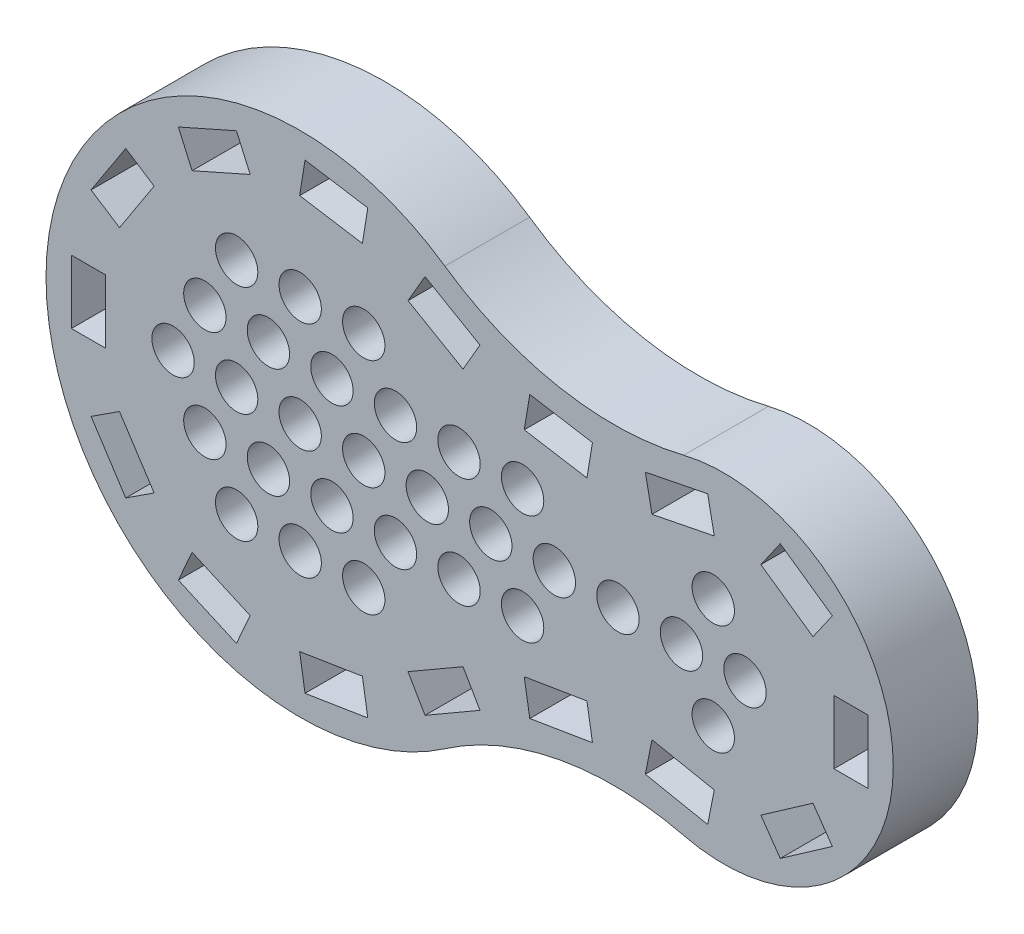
ISO-10303-21;
HEADER;
FILE_DESCRIPTION(('STEP AP214'),'2;1');
FILE_NAME('part.step','',(''),(''),'','','');
FILE_SCHEMA(('AUTOMOTIVE_DESIGN { 1 0 10303 214 1 1 1 1 }'));
ENDSEC;
DATA;
#1=APPLICATION_CONTEXT('core data for automotive mechanical design processes');
#2=APPLICATION_PROTOCOL_DEFINITION('international standard','automotive_design',2000,#1);
#3=PRODUCT_CONTEXT('',#1,'mechanical');
#4=PRODUCT('Part','Part','',(#3));
#5=PRODUCT_RELATED_PRODUCT_CATEGORY('part','',(#4));
#6=PRODUCT_DEFINITION_FORMATION('','',#4);
#7=PRODUCT_DEFINITION_CONTEXT('part definition',#1,'design');
#8=PRODUCT_DEFINITION('design','',#6,#7);
#9=PRODUCT_DEFINITION_SHAPE('','',#8);
#10=(LENGTH_UNIT() NAMED_UNIT(*) SI_UNIT(.MILLI.,.METRE.));
#11=(NAMED_UNIT(*) PLANE_ANGLE_UNIT() SI_UNIT($,.RADIAN.));
#12=(NAMED_UNIT(*) SI_UNIT($,.STERADIAN.) SOLID_ANGLE_UNIT());
#13=UNCERTAINTY_MEASURE_WITH_UNIT(LENGTH_MEASURE(1.E-05),#10,'distance_accuracy_value','');
#14=(GEOMETRIC_REPRESENTATION_CONTEXT(3) GLOBAL_UNCERTAINTY_ASSIGNED_CONTEXT((#13)) GLOBAL_UNIT_ASSIGNED_CONTEXT((#10,
#11,#12)) REPRESENTATION_CONTEXT('',''));
#15=CARTESIAN_POINT('',(0.,0.,0.));
#16=DIRECTION('',(0.,0.,1.));
#17=DIRECTION('',(1.,0.,0.));
#18=AXIS2_PLACEMENT_3D('',#15,#16,#17);
#19=CARTESIAN_POINT('',(74.,-106.883113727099,20.));
#20=DIRECTION('',(0.,0.,-1.));
#21=DIRECTION('',(-1.,0.,0.));
#22=AXIS2_PLACEMENT_3D('',#19,#20,#21);
#23=CYLINDRICAL_SURFACE('',#22,70.);
#24=CARTESIAN_POINT('',(74.,-106.883113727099,0.));
#25=DIRECTION('',(0.,0.,-1.));
#26=DIRECTION('',(1.,0.,0.));
#27=AXIS2_PLACEMENT_3D('',#24,#25,#26);
#28=CIRCLE('',#27,70.);
#29=CARTESIAN_POINT('',(34.1538461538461,-49.3306678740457,0.));
#30=VERTEX_POINT('',#29);
#31=CARTESIAN_POINT('',(90.5454545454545,-38.8665868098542,0.));
#32=VERTEX_POINT('',#31);
#33=EDGE_CURVE('E1006',#30,#32,#28,.T.);
#34=ORIENTED_EDGE('',*,*,#33,.T.);
#35=DIRECTION('',(0.,0.,-1.));
#36=VECTOR('',#35,1.);
#37=CARTESIAN_POINT('',(90.5454545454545,-38.8665868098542,20.));
#38=LINE('',#37,#36);
#39=CARTESIAN_POINT('',(90.5454545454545,-38.8665868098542,20.));
#40=VERTEX_POINT('',#39);
#41=EDGE_CURVE('E13',#40,#32,#38,.T.);
#42=ORIENTED_EDGE('',*,*,#41,.F.);
#43=CARTESIAN_POINT('',(74.,-106.883113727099,20.));
#44=DIRECTION('',(0.,0.,-1.));
#45=DIRECTION('',(1.,0.,0.));
#46=AXIS2_PLACEMENT_3D('',#43,#44,#45);
#47=CIRCLE('',#46,70.);
#48=CARTESIAN_POINT('',(34.1538461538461,-49.3306678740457,20.));
#49=VERTEX_POINT('',#48);
#50=EDGE_CURVE('E1013',#49,#40,#47,.T.);
#51=ORIENTED_EDGE('',*,*,#50,.F.);
#52=DIRECTION('',(0.,0.,-1.));
#53=VECTOR('',#52,1.);
#54=CARTESIAN_POINT('',(34.1538461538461,-49.3306678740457,20.));
#55=LINE('',#54,#53);
#56=EDGE_CURVE('E1023',#49,#30,#55,.T.);
#57=ORIENTED_EDGE('',*,*,#56,.T.);
#58=EDGE_LOOP('',(#34,#42,#51,#57));
#59=FACE_BOUND('',#58,.T.);
#60=ADVANCED_FACE('F65',(#59),#23,.F.);
#61=CARTESIAN_POINT('',(100.,0.,20.));
#62=DIRECTION('',(0.,0.,-1.));
#63=DIRECTION('',(-1.,0.,0.));
#64=AXIS2_PLACEMENT_3D('',#61,#62,#63);
#65=CYLINDRICAL_SURFACE('',#64,40.);
#66=CARTESIAN_POINT('',(100.,0.,0.));
#67=DIRECTION('',(0.,0.,1.));
#68=DIRECTION('',(1.,0.,0.));
#69=AXIS2_PLACEMENT_3D('',#66,#67,#68);
#70=CIRCLE('',#69,40.);
#71=CARTESIAN_POINT('',(90.5454545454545,38.8665868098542,0.));
#72=VERTEX_POINT('',#71);
#73=EDGE_CURVE('E1026',#32,#72,#70,.T.);
#74=ORIENTED_EDGE('',*,*,#73,.T.);
#75=DIRECTION('',(0.,0.,-1.));
#76=VECTOR('',#75,1.);
#77=CARTESIAN_POINT('',(90.5454545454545,38.8665868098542,20.));
#78=LINE('',#77,#76);
#79=CARTESIAN_POINT('',(90.5454545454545,38.8665868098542,20.));
#80=VERTEX_POINT('',#79);
#81=EDGE_CURVE('E72',#80,#72,#78,.T.);
#82=ORIENTED_EDGE('',*,*,#81,.F.);
#83=CARTESIAN_POINT('',(100.,0.,20.));
#84=DIRECTION('',(0.,0.,1.));
#85=DIRECTION('',(1.,0.,0.));
#86=AXIS2_PLACEMENT_3D('',#83,#84,#85);
#87=CIRCLE('',#86,40.);
#88=EDGE_CURVE('E1016',#40,#80,#87,.T.);
#89=ORIENTED_EDGE('',*,*,#88,.F.);
#90=ORIENTED_EDGE('',*,*,#41,.T.);
#91=EDGE_LOOP('',(#74,#82,#89,#90));
#92=FACE_BOUND('',#91,.T.);
#93=ADVANCED_FACE('F1055',(#92),#65,.T.);
#94=CARTESIAN_POINT('',(74.,106.883113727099,20.));
#95=DIRECTION('',(0.,0.,-1.));
#96=DIRECTION('',(-1.,0.,0.));
#97=AXIS2_PLACEMENT_3D('',#94,#95,#96);
#98=CYLINDRICAL_SURFACE('',#97,70.);
#99=CARTESIAN_POINT('',(74.,106.883113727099,0.));
#100=DIRECTION('',(0.,0.,-1.));
#101=DIRECTION('',(1.,0.,0.));
#102=AXIS2_PLACEMENT_3D('',#99,#100,#101);
#103=CIRCLE('',#102,70.);
#104=CARTESIAN_POINT('',(34.1538461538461,49.3306678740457,0.));
#105=VERTEX_POINT('',#104);
#106=EDGE_CURVE('E1028',#72,#105,#103,.T.);
#107=ORIENTED_EDGE('',*,*,#106,.T.);
#108=DIRECTION('',(0.,0.,-1.));
#109=VECTOR('',#108,1.);
#110=CARTESIAN_POINT('',(34.1538461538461,49.3306678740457,20.));
#111=LINE('',#110,#109);
#112=CARTESIAN_POINT('',(34.1538461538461,49.3306678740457,20.));
#113=VERTEX_POINT('',#112);
#114=EDGE_CURVE('E1033',#113,#105,#111,.T.);
#115=ORIENTED_EDGE('',*,*,#114,.F.);
#116=CARTESIAN_POINT('',(74.,106.883113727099,20.));
#117=DIRECTION('',(0.,0.,-1.));
#118=DIRECTION('',(1.,0.,0.));
#119=AXIS2_PLACEMENT_3D('',#116,#117,#118);
#120=CIRCLE('',#119,70.);
#121=EDGE_CURVE('E1019',#80,#113,#120,.T.);
#122=ORIENTED_EDGE('',*,*,#121,.F.);
#123=ORIENTED_EDGE('',*,*,#81,.T.);
#124=EDGE_LOOP('',(#107,#115,#122,#123));
#125=FACE_BOUND('',#124,.T.);
#126=ADVANCED_FACE('F1040',(#125),#98,.F.);
#127=CARTESIAN_POINT('',(0.,0.,20.));
#128=DIRECTION('',(0.,0.,-1.));
#129=DIRECTION('',(-1.,0.,0.));
#130=AXIS2_PLACEMENT_3D('',#127,#128,#129);
#131=CYLINDRICAL_SURFACE('',#130,60.);
#132=CARTESIAN_POINT('',(0.,0.,0.));
#133=DIRECTION('',(0.,0.,1.));
#134=DIRECTION('',(1.,0.,0.));
#135=AXIS2_PLACEMENT_3D('',#132,#133,#134);
#136=CIRCLE('',#135,60.);
#137=EDGE_CURVE('E1017',#105,#30,#136,.T.);
#138=ORIENTED_EDGE('',*,*,#137,.T.);
#139=ORIENTED_EDGE('',*,*,#56,.F.);
#140=CARTESIAN_POINT('',(0.,0.,20.));
#141=DIRECTION('',(0.,0.,1.));
#142=DIRECTION('',(1.,0.,0.));
#143=AXIS2_PLACEMENT_3D('',#140,#141,#142);
#144=CIRCLE('',#143,60.);
#145=EDGE_CURVE('E1021',#113,#49,#144,.T.);
#146=ORIENTED_EDGE('',*,*,#145,.F.);
#147=ORIENTED_EDGE('',*,*,#114,.T.);
#148=EDGE_LOOP('',(#138,#139,#146,#147));
#149=FACE_BOUND('',#148,.T.);
#150=ADVANCED_FACE('F1048',(#149),#131,.T.);
#151=CARTESIAN_POINT('',(37.,-53.4415568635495,20.));
#152=DIRECTION('',(0.,0.,1.));
#153=DIRECTION('',(1.,0.,0.));
#154=AXIS2_PLACEMENT_3D('',#151,#152,#153);
#155=PLANE('',#154);
#156=CARTESIAN_POINT('',(7.49999999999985,12.9903810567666,20.));
#157=DIRECTION('',(0.,0.,1.));
#158=DIRECTION('',(1.,0.,0.));
#159=AXIS2_PLACEMENT_3D('',#156,#157,#158);
#160=CIRCLE('',#159,5.);
#161=CARTESIAN_POINT('',(12.4999999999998,12.9903810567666,20.));
#162=VERTEX_POINT('',#161);
#163=EDGE_CURVE('E1548',#162,#162,#160,.T.);
#164=ORIENTED_EDGE('',*,*,#163,.F.);
#165=EDGE_LOOP('',(#164));
#166=FACE_BOUND('',#165,.T.);
#167=CARTESIAN_POINT('',(14.9999999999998,25.9807621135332,20.));
#168=DIRECTION('',(0.,0.,1.));
#169=DIRECTION('',(1.,0.,0.));
#170=AXIS2_PLACEMENT_3D('',#167,#168,#169);
#171=CIRCLE('',#170,5.);
#172=CARTESIAN_POINT('',(19.9999999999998,25.9807621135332,20.));
#173=VERTEX_POINT('',#172);
#174=EDGE_CURVE('E1554',#173,#173,#171,.T.);
#175=ORIENTED_EDGE('',*,*,#174,.F.);
#176=EDGE_LOOP('',(#175));
#177=FACE_BOUND('',#176,.T.);
#178=CARTESIAN_POINT('',(-1.14491749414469E-13,-25.9807621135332,20.));
#179=DIRECTION('',(0.,0.,1.));
#180=DIRECTION('',(1.,0.,0.));
#181=AXIS2_PLACEMENT_3D('',#178,#179,#180);
#182=CIRCLE('',#181,5.);
#183=CARTESIAN_POINT('',(4.99999999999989,-25.9807621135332,20.));
#184=VERTEX_POINT('',#183);
#185=EDGE_CURVE('E1560',#184,#184,#182,.T.);
#186=ORIENTED_EDGE('',*,*,#185,.F.);
#187=EDGE_LOOP('',(#186));
#188=FACE_BOUND('',#187,.T.);
#189=CARTESIAN_POINT('',(7.49999999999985,-12.9903810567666,20.));
#190=DIRECTION('',(0.,0.,1.));
#191=DIRECTION('',(1.,0.,0.));
#192=AXIS2_PLACEMENT_3D('',#189,#190,#191);
#193=CIRCLE('',#192,5.);
#194=CARTESIAN_POINT('',(12.4999999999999,-12.9903810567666,20.));
#195=VERTEX_POINT('',#194);
#196=EDGE_CURVE('E1523',#195,#195,#193,.T.);
#197=ORIENTED_EDGE('',*,*,#196,.F.);
#198=EDGE_LOOP('',(#197));
#199=FACE_BOUND('',#198,.T.);
#200=CARTESIAN_POINT('',(14.9999999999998,0.,20.));
#201=DIRECTION('',(0.,0.,1.));
#202=DIRECTION('',(1.,0.,0.));
#203=AXIS2_PLACEMENT_3D('',#200,#201,#202);
#204=CIRCLE('',#203,5.);
#205=CARTESIAN_POINT('',(19.9999999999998,0.,20.));
#206=VERTEX_POINT('',#205);
#207=EDGE_CURVE('E1524',#206,#206,#204,.T.);
#208=ORIENTED_EDGE('',*,*,#207,.F.);
#209=EDGE_LOOP('',(#208));
#210=FACE_BOUND('',#209,.T.);
#211=CARTESIAN_POINT('',(22.4999999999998,12.9903810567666,20.));
#212=DIRECTION('',(0.,0.,1.));
#213=DIRECTION('',(1.,0.,0.));
#214=AXIS2_PLACEMENT_3D('',#211,#212,#213);
#215=CIRCLE('',#214,5.);
#216=CARTESIAN_POINT('',(27.4999999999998,12.9903810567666,20.));
#217=VERTEX_POINT('',#216);
#218=EDGE_CURVE('E1530',#217,#217,#215,.T.);
#219=ORIENTED_EDGE('',*,*,#218,.F.);
#220=EDGE_LOOP('',(#219));
#221=FACE_BOUND('',#220,.T.);
#222=CARTESIAN_POINT('',(14.9999999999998,-25.9807621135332,20.));
#223=DIRECTION('',(0.,0.,1.));
#224=DIRECTION('',(1.,0.,0.));
#225=AXIS2_PLACEMENT_3D('',#222,#223,#224);
#226=CIRCLE('',#225,5.);
#227=CARTESIAN_POINT('',(19.9999999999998,-25.9807621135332,20.));
#228=VERTEX_POINT('',#227);
#229=EDGE_CURVE('E1536',#228,#228,#226,.T.);
#230=ORIENTED_EDGE('',*,*,#229,.F.);
#231=EDGE_LOOP('',(#230));
#232=FACE_BOUND('',#231,.T.);
#233=CARTESIAN_POINT('',(22.4999999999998,-12.9903810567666,20.));
#234=DIRECTION('',(0.,0.,1.));
#235=DIRECTION('',(1.,0.,0.));
#236=AXIS2_PLACEMENT_3D('',#233,#234,#235);
#237=CIRCLE('',#236,5.);
#238=CARTESIAN_POINT('',(27.4999999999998,-12.9903810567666,20.));
#239=VERTEX_POINT('',#238);
#240=EDGE_CURVE('E1488',#239,#239,#237,.T.);
#241=ORIENTED_EDGE('',*,*,#240,.F.);
#242=EDGE_LOOP('',(#241));
#243=FACE_BOUND('',#242,.T.);
#244=CARTESIAN_POINT('',(-7.50000000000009,12.9903810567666,20.));
#245=DIRECTION('',(0.,0.,1.));
#246=DIRECTION('',(1.,0.,0.));
#247=AXIS2_PLACEMENT_3D('',#244,#245,#246);
#248=CIRCLE('',#247,5.);
#249=CARTESIAN_POINT('',(-2.50000000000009,12.9903810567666,20.));
#250=VERTEX_POINT('',#249);
#251=EDGE_CURVE('E1583',#250,#250,#248,.T.);
#252=ORIENTED_EDGE('',*,*,#251,.F.);
#253=EDGE_LOOP('',(#252));
#254=FACE_BOUND('',#253,.T.);
#255=CARTESIAN_POINT('',(-15.0000000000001,0.,20.));
#256=DIRECTION('',(0.,0.,1.));
#257=DIRECTION('',(1.,0.,0.));
#258=AXIS2_PLACEMENT_3D('',#255,#256,#257);
#259=CIRCLE('',#258,5.);
#260=CARTESIAN_POINT('',(-10.0000000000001,0.,20.));
#261=VERTEX_POINT('',#260);
#262=EDGE_CURVE('E1596',#261,#261,#259,.T.);
#263=ORIENTED_EDGE('',*,*,#262,.F.);
#264=EDGE_LOOP('',(#263));
#265=FACE_BOUND('',#264,.T.);
#266=CARTESIAN_POINT('',(-22.5,-12.9903810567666,20.));
#267=DIRECTION('',(0.,0.,1.));
#268=DIRECTION('',(1.,0.,0.));
#269=AXIS2_PLACEMENT_3D('',#266,#267,#268);
#270=CIRCLE('',#269,5.);
#271=CARTESIAN_POINT('',(-17.5,-12.9903810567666,20.));
#272=VERTEX_POINT('',#271);
#273=EDGE_CURVE('E1595',#272,#272,#270,.T.);
#274=ORIENTED_EDGE('',*,*,#273,.F.);
#275=EDGE_LOOP('',(#274));
#276=FACE_BOUND('',#275,.T.);
#277=CARTESIAN_POINT('',(-15.,25.9807621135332,20.));
#278=DIRECTION('',(0.,0.,1.));
#279=DIRECTION('',(1.,0.,0.));
#280=AXIS2_PLACEMENT_3D('',#277,#278,#279);
#281=CIRCLE('',#280,5.);
#282=CARTESIAN_POINT('',(-10.,25.9807621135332,20.));
#283=VERTEX_POINT('',#282);
#284=EDGE_CURVE('E1608',#283,#283,#281,.T.);
#285=ORIENTED_EDGE('',*,*,#284,.F.);
#286=EDGE_LOOP('',(#285));
#287=FACE_BOUND('',#286,.T.);
#288=CARTESIAN_POINT('',(-1.21430643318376E-13,0.,20.));
#289=DIRECTION('',(0.,0.,1.));
#290=DIRECTION('',(1.,0.,0.));
#291=AXIS2_PLACEMENT_3D('',#288,#289,#290);
#292=CIRCLE('',#291,5.);
#293=CARTESIAN_POINT('',(4.99999999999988,0.,20.));
#294=VERTEX_POINT('',#293);
#295=EDGE_CURVE('E1547',#294,#294,#292,.T.);
#296=ORIENTED_EDGE('',*,*,#295,.F.);
#297=EDGE_LOOP('',(#296));
#298=FACE_BOUND('',#297,.T.);
#299=CARTESIAN_POINT('',(-7.50000000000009,-12.9903810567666,20.));
#300=DIRECTION('',(0.,0.,1.));
#301=DIRECTION('',(1.,0.,0.));
#302=AXIS2_PLACEMENT_3D('',#299,#300,#301);
#303=CIRCLE('',#302,5.);
#304=CARTESIAN_POINT('',(-2.50000000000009,-12.9903810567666,20.));
#305=VERTEX_POINT('',#304);
#306=EDGE_CURVE('E1572',#305,#305,#303,.T.);
#307=ORIENTED_EDGE('',*,*,#306,.F.);
#308=EDGE_LOOP('',(#307));
#309=FACE_BOUND('',#308,.T.);
#310=CARTESIAN_POINT('',(-15.0000000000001,-25.9807621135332,20.));
#311=DIRECTION('',(0.,0.,1.));
#312=DIRECTION('',(1.,0.,0.));
#313=AXIS2_PLACEMENT_3D('',#310,#311,#312);
#314=CIRCLE('',#313,5.);
#315=CARTESIAN_POINT('',(-10.0000000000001,-25.9807621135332,20.));
#316=VERTEX_POINT('',#315);
#317=EDGE_CURVE('E1571',#316,#316,#314,.T.);
#318=ORIENTED_EDGE('',*,*,#317,.F.);
#319=EDGE_LOOP('',(#318));
#320=FACE_BOUND('',#319,.T.);
#321=CARTESIAN_POINT('',(-1.17961196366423E-13,25.9807621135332,20.));
#322=DIRECTION('',(0.,0.,1.));
#323=DIRECTION('',(1.,0.,0.));
#324=AXIS2_PLACEMENT_3D('',#321,#322,#323);
#325=CIRCLE('',#324,5.);
#326=CARTESIAN_POINT('',(4.99999999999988,25.9807621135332,20.));
#327=VERTEX_POINT('',#326);
#328=EDGE_CURVE('E1584',#327,#327,#325,.T.);
#329=ORIENTED_EDGE('',*,*,#328,.F.);
#330=EDGE_LOOP('',(#329));
#331=FACE_BOUND('',#330,.T.);
#332=CARTESIAN_POINT('',(52.4999999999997,12.9903810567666,20.));
#333=DIRECTION('',(0.,0.,1.));
#334=DIRECTION('',(1.,0.,0.));
#335=AXIS2_PLACEMENT_3D('',#332,#333,#334);
#336=CIRCLE('',#335,5.);
#337=CARTESIAN_POINT('',(57.4999999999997,12.9903810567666,20.));
#338=VERTEX_POINT('',#337);
#339=EDGE_CURVE('E1465',#338,#338,#336,.T.);
#340=ORIENTED_EDGE('',*,*,#339,.F.);
#341=EDGE_LOOP('',(#340));
#342=FACE_BOUND('',#341,.T.);
#343=CARTESIAN_POINT('',(52.4999999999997,-12.9903810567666,20.));
#344=DIRECTION('',(0.,0.,1.));
#345=DIRECTION('',(1.,0.,0.));
#346=AXIS2_PLACEMENT_3D('',#343,#344,#345);
#347=CIRCLE('',#346,5.);
#348=CARTESIAN_POINT('',(57.4999999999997,-12.9903810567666,20.));
#349=VERTEX_POINT('',#348);
#350=EDGE_CURVE('E1452',#349,#349,#347,.T.);
#351=ORIENTED_EDGE('',*,*,#350,.F.);
#352=EDGE_LOOP('',(#351));
#353=FACE_BOUND('',#352,.T.);
#354=CARTESIAN_POINT('',(59.9999999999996,0.,20.));
#355=DIRECTION('',(0.,0.,1.));
#356=DIRECTION('',(1.,0.,0.));
#357=AXIS2_PLACEMENT_3D('',#354,#355,#356);
#358=CIRCLE('',#357,5.);
#359=CARTESIAN_POINT('',(64.9999999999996,0.,20.));
#360=VERTEX_POINT('',#359);
#361=EDGE_CURVE('E1448',#360,#360,#358,.T.);
#362=ORIENTED_EDGE('',*,*,#361,.F.);
#363=EDGE_LOOP('',(#362));
#364=FACE_BOUND('',#363,.T.);
#365=CARTESIAN_POINT('',(74.9999999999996,0.,20.));
#366=DIRECTION('',(0.,0.,1.));
#367=DIRECTION('',(1.,0.,0.));
#368=AXIS2_PLACEMENT_3D('',#365,#366,#367);
#369=CIRCLE('',#368,5.);
#370=CARTESIAN_POINT('',(79.9999999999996,0.,20.));
#371=VERTEX_POINT('',#370);
#372=EDGE_CURVE('E1455',#371,#371,#369,.T.);
#373=ORIENTED_EDGE('',*,*,#372,.F.);
#374=EDGE_LOOP('',(#373));
#375=FACE_BOUND('',#374,.T.);
#376=CARTESIAN_POINT('',(29.9999999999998,0.,20.));
#377=DIRECTION('',(0.,0.,1.));
#378=DIRECTION('',(1.,0.,0.));
#379=AXIS2_PLACEMENT_3D('',#376,#377,#378);
#380=CIRCLE('',#379,5.);
#381=CARTESIAN_POINT('',(34.9999999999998,0.,20.));
#382=VERTEX_POINT('',#381);
#383=EDGE_CURVE('E1489',#382,#382,#380,.T.);
#384=ORIENTED_EDGE('',*,*,#383,.F.);
#385=EDGE_LOOP('',(#384));
#386=FACE_BOUND('',#385,.T.);
#387=CARTESIAN_POINT('',(37.4999999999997,12.9903810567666,20.));
#388=DIRECTION('',(0.,0.,1.));
#389=DIRECTION('',(1.,0.,0.));
#390=AXIS2_PLACEMENT_3D('',#387,#388,#389);
#391=CIRCLE('',#390,5.);
#392=CARTESIAN_POINT('',(42.4999999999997,12.9903810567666,20.));
#393=VERTEX_POINT('',#392);
#394=EDGE_CURVE('E1476',#393,#393,#391,.T.);
#395=ORIENTED_EDGE('',*,*,#394,.F.);
#396=EDGE_LOOP('',(#395));
#397=FACE_BOUND('',#396,.T.);
#398=CARTESIAN_POINT('',(37.4999999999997,-12.9903810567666,20.));
#399=DIRECTION('',(0.,0.,1.));
#400=DIRECTION('',(1.,0.,0.));
#401=AXIS2_PLACEMENT_3D('',#398,#399,#400);
#402=CIRCLE('',#401,5.);
#403=CARTESIAN_POINT('',(42.4999999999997,-12.9903810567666,20.));
#404=VERTEX_POINT('',#403);
#405=EDGE_CURVE('E1477',#404,#404,#402,.T.);
#406=ORIENTED_EDGE('',*,*,#405,.F.);
#407=EDGE_LOOP('',(#406));
#408=FACE_BOUND('',#407,.T.);
#409=CARTESIAN_POINT('',(44.9999999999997,0.,20.));
#410=DIRECTION('',(0.,0.,1.));
#411=DIRECTION('',(1.,0.,0.));
#412=AXIS2_PLACEMENT_3D('',#409,#410,#411);
#413=CIRCLE('',#412,5.);
#414=CARTESIAN_POINT('',(49.9999999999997,0.,20.));
#415=VERTEX_POINT('',#414);
#416=EDGE_CURVE('E1464',#415,#415,#413,.T.);
#417=ORIENTED_EDGE('',*,*,#416,.F.);
#418=EDGE_LOOP('',(#417));
#419=FACE_BOUND('',#418,.T.);
#420=CARTESIAN_POINT('',(104.999999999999,0.,20.));
#421=DIRECTION('',(0.,0.,1.));
#422=DIRECTION('',(1.,0.,0.));
#423=AXIS2_PLACEMENT_3D('',#420,#421,#422);
#424=CIRCLE('',#423,5.);
#425=CARTESIAN_POINT('',(109.999999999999,0.,20.));
#426=VERTEX_POINT('',#425);
#427=EDGE_CURVE('E1507',#426,#426,#424,.T.);
#428=ORIENTED_EDGE('',*,*,#427,.F.);
#429=EDGE_LOOP('',(#428));
#430=FACE_BOUND('',#429,.T.);
#431=CARTESIAN_POINT('',(97.4999999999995,-12.9903810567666,20.));
#432=DIRECTION('',(0.,0.,1.));
#433=DIRECTION('',(1.,0.,0.));
#434=AXIS2_PLACEMENT_3D('',#431,#432,#433);
#435=CIRCLE('',#434,5.);
#436=CARTESIAN_POINT('',(102.5,-12.9903810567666,20.));
#437=VERTEX_POINT('',#436);
#438=EDGE_CURVE('E1501',#437,#437,#435,.T.);
#439=ORIENTED_EDGE('',*,*,#438,.F.);
#440=EDGE_LOOP('',(#439));
#441=FACE_BOUND('',#440,.T.);
#442=CARTESIAN_POINT('',(97.4999999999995,12.9903810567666,20.));
#443=DIRECTION('',(0.,0.,1.));
#444=DIRECTION('',(1.,0.,0.));
#445=AXIS2_PLACEMENT_3D('',#442,#443,#444);
#446=CIRCLE('',#445,5.);
#447=CARTESIAN_POINT('',(102.499999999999,12.9903810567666,20.));
#448=VERTEX_POINT('',#447);
#449=EDGE_CURVE('E1500',#448,#448,#446,.T.);
#450=ORIENTED_EDGE('',*,*,#449,.F.);
#451=EDGE_LOOP('',(#450));
#452=FACE_BOUND('',#451,.T.);
#453=CARTESIAN_POINT('',(89.9999999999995,0.,20.));
#454=DIRECTION('',(0.,0.,1.));
#455=DIRECTION('',(1.,0.,0.));
#456=AXIS2_PLACEMENT_3D('',#453,#454,#455);
#457=CIRCLE('',#456,5.);
#458=CARTESIAN_POINT('',(94.9999999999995,0.,20.));
#459=VERTEX_POINT('',#458);
#460=EDGE_CURVE('E1512',#459,#459,#457,.T.);
#461=ORIENTED_EDGE('',*,*,#460,.F.);
#462=EDGE_LOOP('',(#461));
#463=FACE_BOUND('',#462,.T.);
#464=CARTESIAN_POINT('',(-22.5,12.9903810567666,20.));
#465=DIRECTION('',(0.,0.,1.));
#466=DIRECTION('',(1.,0.,0.));
#467=AXIS2_PLACEMENT_3D('',#464,#465,#466);
#468=CIRCLE('',#467,5.);
#469=CARTESIAN_POINT('',(-17.5,12.9903810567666,20.));
#470=VERTEX_POINT('',#469);
#471=EDGE_CURVE('E1607',#470,#470,#468,.T.);
#472=ORIENTED_EDGE('',*,*,#471,.F.);
#473=EDGE_LOOP('',(#472));
#474=FACE_BOUND('',#473,.T.);
#475=CARTESIAN_POINT('',(-30.,0.,20.));
#476=DIRECTION('',(0.,0.,1.));
#477=DIRECTION('',(1.,0.,0.));
#478=AXIS2_PLACEMENT_3D('',#475,#476,#477);
#479=CIRCLE('',#478,5.);
#480=CARTESIAN_POINT('',(-25.,0.,20.));
#481=VERTEX_POINT('',#480);
#482=EDGE_CURVE('E520',#481,#481,#479,.T.);
#483=ORIENTED_EDGE('',*,*,#482,.F.);
#484=EDGE_LOOP('',(#483));
#485=FACE_BOUND('',#484,.T.);
#486=DIRECTION('',(-0.914058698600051,0.40558192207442,0.));
#487=VECTOR('',#486,1.);
#488=CARTESIAN_POINT('',(-11.801328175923,-45.0885645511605,20.));
#489=LINE('',#488,#487);
#490=CARTESIAN_POINT('',(-11.801328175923,-45.0885645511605,20.));
#491=VERTEX_POINT('',#490);
#492=CARTESIAN_POINT('',(-25.5122086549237,-39.0048357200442,20.));
#493=VERTEX_POINT('',#492);
#494=EDGE_CURVE('E79',#491,#493,#489,.T.);
#495=ORIENTED_EDGE('',*,*,#494,.F.);
#496=DIRECTION('',(0.40558192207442,0.914058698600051,0.));
#497=VECTOR('',#496,1.);
#498=CARTESIAN_POINT('',(-15.0459835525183,-52.4010341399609,20.));
#499=LINE('',#498,#497);
#500=CARTESIAN_POINT('',(-15.0459835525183,-52.4010341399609,20.));
#501=VERTEX_POINT('',#500);
#502=EDGE_CURVE('E701',#501,#491,#499,.T.);
#503=ORIENTED_EDGE('',*,*,#502,.F.);
#504=DIRECTION('',(0.914058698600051,-0.40558192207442,0.));
#505=VECTOR('',#504,1.);
#506=CARTESIAN_POINT('',(-15.0459835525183,-52.4010341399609,20.));
#507=LINE('',#506,#505);
#508=CARTESIAN_POINT('',(-28.7568640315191,-46.3173053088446,20.));
#509=VERTEX_POINT('',#508);
#510=EDGE_CURVE('E716',#509,#501,#507,.T.);
#511=ORIENTED_EDGE('',*,*,#510,.F.);
#512=DIRECTION('',(-0.40558192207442,-0.914058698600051,0.));
#513=VECTOR('',#512,1.);
#514=CARTESIAN_POINT('',(-28.7568640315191,-46.3173053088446,20.));
#515=LINE('',#514,#513);
#516=EDGE_CURVE('E712',#493,#509,#515,.T.);
#517=ORIENTED_EDGE('',*,*,#516,.F.);
#518=EDGE_LOOP('',(#495,#503,#511,#517));
#519=FACE_BOUND('',#518,.T.);
#520=DIRECTION('',(-0.987390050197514,-0.15830631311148,0.));
#521=VECTOR('',#520,1.);
#522=CARTESIAN_POINT('',(14.6875157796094,-44.2326449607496,20.));
#523=LINE('',#522,#521);
#524=CARTESIAN_POINT('',(14.6875157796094,-44.2326449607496,20.));
#525=VERTEX_POINT('',#524);
#526=CARTESIAN_POINT('',(-0.123334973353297,-46.6072396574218,20.));
#527=VERTEX_POINT('',#526);
#528=EDGE_CURVE('E87',#525,#527,#523,.T.);
#529=ORIENTED_EDGE('',*,*,#528,.F.);
#530=DIRECTION('',(-0.15830631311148,0.987390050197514,0.));
#531=VECTOR('',#530,1.);
#532=CARTESIAN_POINT('',(15.9539662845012,-52.1317653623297,20.));
#533=LINE('',#532,#531);
#534=CARTESIAN_POINT('',(15.9539662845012,-52.1317653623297,20.));
#535=VERTEX_POINT('',#534);
#536=EDGE_CURVE('E733',#535,#525,#533,.T.);
#537=ORIENTED_EDGE('',*,*,#536,.F.);
#538=DIRECTION('',(0.987390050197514,0.15830631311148,0.));
#539=VECTOR('',#538,1.);
#540=CARTESIAN_POINT('',(15.9539662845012,-52.1317653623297,20.));
#541=LINE('',#540,#539);
#542=CARTESIAN_POINT('',(1.14311553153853,-54.5063600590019,20.));
#543=VERTEX_POINT('',#542);
#544=EDGE_CURVE('E748',#543,#535,#541,.T.);
#545=ORIENTED_EDGE('',*,*,#544,.F.);
#546=DIRECTION('',(0.15830631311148,-0.987390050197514,0.));
#547=VECTOR('',#546,1.);
#548=CARTESIAN_POINT('',(1.14311553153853,-54.5063600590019,20.));
#549=LINE('',#548,#547);
#550=EDGE_CURVE('E744',#527,#543,#549,.T.);
#551=ORIENTED_EDGE('',*,*,#550,.F.);
#552=EDGE_LOOP('',(#529,#537,#545,#551));
#553=FACE_BOUND('',#552,.T.);
#554=DIRECTION('',(-0.865663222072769,-0.500626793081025,0.));
#555=VECTOR('',#554,1.);
#556=CARTESIAN_POINT('',(38.4398235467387,-30.4127021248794,20.));
#557=LINE('',#556,#555);
#558=CARTESIAN_POINT('',(38.4398235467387,-30.4127021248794,20.));
#559=VERTEX_POINT('',#558);
#560=CARTESIAN_POINT('',(25.4548752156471,-37.9221040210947,20.));
#561=VERTEX_POINT('',#560);
#562=EDGE_CURVE('E773',#559,#561,#557,.T.);
#563=ORIENTED_EDGE('',*,*,#562,.F.);
#564=DIRECTION('',(-0.500626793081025,0.865663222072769,0.));
#565=VECTOR('',#564,1.);
#566=CARTESIAN_POINT('',(42.4448378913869,-37.3380079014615,20.));
#567=LINE('',#566,#565);
#568=CARTESIAN_POINT('',(42.4448378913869,-37.3380079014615,20.));
#569=VERTEX_POINT('',#568);
#570=EDGE_CURVE('E763',#569,#559,#567,.T.);
#571=ORIENTED_EDGE('',*,*,#570,.F.);
#572=DIRECTION('',(0.865663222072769,0.500626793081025,0.));
#573=VECTOR('',#572,1.);
#574=CARTESIAN_POINT('',(42.4448378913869,-37.3380079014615,20.));
#575=LINE('',#574,#573);
#576=CARTESIAN_POINT('',(29.4598895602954,-44.8474097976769,20.));
#577=VERTEX_POINT('',#576);
#578=EDGE_CURVE('E779',#577,#569,#575,.T.);
#579=ORIENTED_EDGE('',*,*,#578,.F.);
#580=DIRECTION('',(0.500626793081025,-0.865663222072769,0.));
#581=VECTOR('',#580,1.);
#582=CARTESIAN_POINT('',(29.4598895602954,-44.8474097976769,20.));
#583=LINE('',#582,#581);
#584=EDGE_CURVE('E775',#561,#577,#583,.T.);
#585=ORIENTED_EDGE('',*,*,#584,.F.);
#586=EDGE_LOOP('',(#563,#571,#579,#585));
#587=FACE_BOUND('',#586,.T.);
#588=DIRECTION('',(-0.986589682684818,-0.163220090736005,0.));
#589=VECTOR('',#588,1.);
#590=CARTESIAN_POINT('',(67.6889349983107,-22.7854297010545,20.));
#591=LINE('',#590,#589);
#592=CARTESIAN_POINT('',(67.6889349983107,-22.7854297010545,20.));
#593=VERTEX_POINT('',#592);
#594=CARTESIAN_POINT('',(52.8900897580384,-25.2337310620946,20.));
#595=VERTEX_POINT('',#594);
#596=EDGE_CURVE('E805',#593,#595,#591,.T.);
#597=ORIENTED_EDGE('',*,*,#596,.F.);
#598=DIRECTION('',(-0.163220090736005,0.986589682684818,0.));
#599=VECTOR('',#598,1.);
#600=CARTESIAN_POINT('',(68.9946957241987,-30.6781471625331,20.));
#601=LINE('',#600,#599);
#602=CARTESIAN_POINT('',(68.9946957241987,-30.6781471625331,20.));
#603=VERTEX_POINT('',#602);
#604=EDGE_CURVE('E795',#603,#593,#601,.T.);
#605=ORIENTED_EDGE('',*,*,#604,.F.);
#606=DIRECTION('',(0.986589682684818,0.163220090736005,0.));
#607=VECTOR('',#606,1.);
#608=CARTESIAN_POINT('',(68.9946957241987,-30.6781471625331,20.));
#609=LINE('',#608,#607);
#610=CARTESIAN_POINT('',(54.1958504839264,-33.1264485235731,20.));
#611=VERTEX_POINT('',#610);
#612=EDGE_CURVE('E811',#611,#603,#609,.T.);
#613=ORIENTED_EDGE('',*,*,#612,.F.);
#614=DIRECTION('',(0.163220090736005,-0.986589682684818,0.));
#615=VECTOR('',#614,1.);
#616=CARTESIAN_POINT('',(54.1958504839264,-33.1264485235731,20.));
#617=LINE('',#616,#615);
#618=EDGE_CURVE('E807',#595,#611,#617,.T.);
#619=ORIENTED_EDGE('',*,*,#618,.F.);
#620=EDGE_LOOP('',(#597,#605,#613,#619));
#621=FACE_BOUND('',#620,.T.);
#622=DIRECTION('',(-0.980772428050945,0.195154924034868,0.));
#623=VECTOR('',#622,1.);
#624=CARTESIAN_POINT('',(97.7488068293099,-25.9618917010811,20.));
#625=LINE('',#624,#623);
#626=CARTESIAN_POINT('',(97.7488068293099,-25.9618917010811,20.));
#627=VERTEX_POINT('',#626);
#628=CARTESIAN_POINT('',(83.0372204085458,-23.0345678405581,20.));
#629=VERTEX_POINT('',#628);
#630=EDGE_CURVE('E837',#627,#629,#625,.T.);
#631=ORIENTED_EDGE('',*,*,#630,.F.);
#632=DIRECTION('',(0.195154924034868,0.980772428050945,0.));
#633=VECTOR('',#632,1.);
#634=CARTESIAN_POINT('',(96.187567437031,-33.8080711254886,20.));
#635=LINE('',#634,#633);
#636=CARTESIAN_POINT('',(96.187567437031,-33.8080711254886,20.));
#637=VERTEX_POINT('',#636);
#638=EDGE_CURVE('E827',#637,#627,#635,.T.);
#639=ORIENTED_EDGE('',*,*,#638,.F.);
#640=DIRECTION('',(0.980772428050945,-0.195154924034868,0.));
#641=VECTOR('',#640,1.);
#642=CARTESIAN_POINT('',(96.187567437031,-33.8080711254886,20.));
#643=LINE('',#642,#641);
#644=CARTESIAN_POINT('',(81.4759810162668,-30.8807472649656,20.));
#645=VERTEX_POINT('',#644);
#646=EDGE_CURVE('E843',#645,#637,#643,.T.);
#647=ORIENTED_EDGE('',*,*,#646,.F.);
#648=DIRECTION('',(-0.195154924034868,-0.980772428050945,0.));
#649=VECTOR('',#648,1.);
#650=CARTESIAN_POINT('',(81.4759810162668,-30.8807472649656,20.));
#651=LINE('',#650,#649);
#652=EDGE_CURVE('E839',#629,#645,#651,.T.);
#653=ORIENTED_EDGE('',*,*,#652,.F.);
#654=EDGE_LOOP('',(#631,#639,#647,#653));
#655=FACE_BOUND('',#654,.T.);
#656=DIRECTION('',(-0.81975558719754,-0.572713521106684,0.));
#657=VECTOR('',#656,1.);
#658=CARTESIAN_POINT('',(121.038718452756,-17.0182938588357,20.));
#659=LINE('',#658,#657);
#660=CARTESIAN_POINT('',(121.038718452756,-17.0182938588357,20.));
#661=VERTEX_POINT('',#660);
#662=CARTESIAN_POINT('',(108.742384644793,-25.6089966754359,20.));
#663=VERTEX_POINT('',#662);
#664=EDGE_CURVE('E869',#661,#663,#659,.T.);
#665=ORIENTED_EDGE('',*,*,#664,.F.);
#666=DIRECTION('',(-0.572713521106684,0.81975558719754,0.));
#667=VECTOR('',#666,1.);
#668=CARTESIAN_POINT('',(125.620426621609,-23.576338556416,20.));
#669=LINE('',#668,#667);
#670=CARTESIAN_POINT('',(125.620426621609,-23.576338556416,20.));
#671=VERTEX_POINT('',#670);
#672=EDGE_CURVE('E859',#671,#661,#669,.T.);
#673=ORIENTED_EDGE('',*,*,#672,.F.);
#674=DIRECTION('',(0.81975558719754,0.572713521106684,0.));
#675=VECTOR('',#674,1.);
#676=CARTESIAN_POINT('',(125.620426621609,-23.576338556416,20.));
#677=LINE('',#676,#675);
#678=CARTESIAN_POINT('',(113.324092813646,-32.1670413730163,20.));
#679=VERTEX_POINT('',#678);
#680=EDGE_CURVE('E875',#679,#671,#677,.T.);
#681=ORIENTED_EDGE('',*,*,#680,.F.);
#682=DIRECTION('',(0.572713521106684,-0.81975558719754,0.));
#683=VECTOR('',#682,1.);
#684=CARTESIAN_POINT('',(113.324092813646,-32.1670413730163,20.));
#685=LINE('',#684,#683);
#686=EDGE_CURVE('E871',#663,#679,#685,.T.);
#687=ORIENTED_EDGE('',*,*,#686,.F.);
#688=EDGE_LOOP('',(#665,#673,#681,#687));
#689=FACE_BOUND('',#688,.T.);
#690=DIRECTION('',(0.,-1.,0.));
#691=VECTOR('',#690,1.);
#692=CARTESIAN_POINT('',(126.,7.50000000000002,20.));
#693=LINE('',#692,#691);
#694=CARTESIAN_POINT('',(126.,7.50000000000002,20.));
#695=VERTEX_POINT('',#694);
#696=CARTESIAN_POINT('',(126.,-7.49999999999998,20.));
#697=VERTEX_POINT('',#696);
#698=EDGE_CURVE('E901',#695,#697,#693,.T.);
#699=ORIENTED_EDGE('',*,*,#698,.F.);
#700=DIRECTION('',(-1.,0.,0.));
#701=VECTOR('',#700,1.);
#702=CARTESIAN_POINT('',(134.,7.50000000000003,20.));
#703=LINE('',#702,#701);
#704=CARTESIAN_POINT('',(134.,7.50000000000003,20.));
#705=VERTEX_POINT('',#704);
#706=EDGE_CURVE('E891',#705,#695,#703,.T.);
#707=ORIENTED_EDGE('',*,*,#706,.F.);
#708=DIRECTION('',(0.,1.,0.));
#709=VECTOR('',#708,1.);
#710=CARTESIAN_POINT('',(134.,7.50000000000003,20.));
#711=LINE('',#710,#709);
#712=CARTESIAN_POINT('',(134.,-7.49999999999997,20.));
#713=VERTEX_POINT('',#712);
#714=EDGE_CURVE('E907',#713,#705,#711,.T.);
#715=ORIENTED_EDGE('',*,*,#714,.F.);
#716=DIRECTION('',(1.,0.,0.));
#717=VECTOR('',#716,1.);
#718=CARTESIAN_POINT('',(134.,-7.49999999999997,20.));
#719=LINE('',#718,#717);
#720=EDGE_CURVE('E903',#697,#713,#719,.T.);
#721=ORIENTED_EDGE('',*,*,#720,.F.);
#722=EDGE_LOOP('',(#699,#707,#715,#721));
#723=FACE_BOUND('',#722,.T.);
#724=DIRECTION('',(0.819755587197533,-0.572713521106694,0.));
#725=VECTOR('',#724,1.);
#726=CARTESIAN_POINT('',(108.742384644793,25.6089966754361,20.));
#727=LINE('',#726,#725);
#728=CARTESIAN_POINT('',(108.742384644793,25.6089966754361,20.));
#729=VERTEX_POINT('',#728);
#730=CARTESIAN_POINT('',(121.038718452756,17.0182938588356,20.));
#731=VERTEX_POINT('',#730);
#732=EDGE_CURVE('E533',#729,#731,#727,.T.);
#733=ORIENTED_EDGE('',*,*,#732,.F.);
#734=DIRECTION('',(-0.572713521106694,-0.819755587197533,0.));
#735=VECTOR('',#734,1.);
#736=CARTESIAN_POINT('',(113.324092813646,32.1670413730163,20.));
#737=LINE('',#736,#735);
#738=CARTESIAN_POINT('',(113.324092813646,32.1670413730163,20.));
#739=VERTEX_POINT('',#738);
#740=EDGE_CURVE('E923',#739,#729,#737,.T.);
#741=ORIENTED_EDGE('',*,*,#740,.F.);
#742=DIRECTION('',(-0.819755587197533,0.572713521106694,0.));
#743=VECTOR('',#742,1.);
#744=CARTESIAN_POINT('',(113.324092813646,32.1670413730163,20.));
#745=LINE('',#744,#743);
#746=CARTESIAN_POINT('',(125.620426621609,23.5763385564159,20.));
#747=VERTEX_POINT('',#746);
#748=EDGE_CURVE('E937',#747,#739,#745,.T.);
#749=ORIENTED_EDGE('',*,*,#748,.F.);
#750=DIRECTION('',(0.572713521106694,0.819755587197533,0.));
#751=VECTOR('',#750,1.);
#752=CARTESIAN_POINT('',(125.620426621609,23.5763385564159,20.));
#753=LINE('',#752,#751);
#754=EDGE_CURVE('E934',#731,#747,#753,.T.);
#755=ORIENTED_EDGE('',*,*,#754,.F.);
#756=EDGE_LOOP('',(#733,#741,#749,#755));
#757=FACE_BOUND('',#756,.T.);
#758=DIRECTION('',(0.980772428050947,0.195154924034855,0.));
#759=VECTOR('',#758,1.);
#760=CARTESIAN_POINT('',(83.0372204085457,23.0345678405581,20.));
#761=LINE('',#760,#759);
#762=CARTESIAN_POINT('',(83.0372204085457,23.0345678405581,20.));
#763=VERTEX_POINT('',#762);
#764=CARTESIAN_POINT('',(97.7488068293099,25.961891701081,20.));
#765=VERTEX_POINT('',#764);
#766=EDGE_CURVE('E496',#763,#765,#761,.T.);
#767=ORIENTED_EDGE('',*,*,#766,.F.);
#768=DIRECTION('',(0.195154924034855,-0.980772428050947,0.));
#769=VECTOR('',#768,1.);
#770=CARTESIAN_POINT('',(81.4759810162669,30.8807472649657,20.));
#771=LINE('',#770,#769);
#772=CARTESIAN_POINT('',(81.4759810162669,30.8807472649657,20.));
#773=VERTEX_POINT('',#772);
#774=EDGE_CURVE('E514',#773,#763,#771,.T.);
#775=ORIENTED_EDGE('',*,*,#774,.F.);
#776=DIRECTION('',(-0.980772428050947,-0.195154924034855,0.));
#777=VECTOR('',#776,1.);
#778=CARTESIAN_POINT('',(81.4759810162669,30.8807472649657,20.));
#779=LINE('',#778,#777);
#780=CARTESIAN_POINT('',(96.1875674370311,33.8080711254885,20.));
#781=VERTEX_POINT('',#780);
#782=EDGE_CURVE('E517',#781,#773,#779,.T.);
#783=ORIENTED_EDGE('',*,*,#782,.F.);
#784=DIRECTION('',(-0.195154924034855,0.980772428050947,0.));
#785=VECTOR('',#784,1.);
#786=CARTESIAN_POINT('',(96.1875674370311,33.8080711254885,20.));
#787=LINE('',#786,#785);
#788=EDGE_CURVE('E526',#765,#781,#787,.T.);
#789=ORIENTED_EDGE('',*,*,#788,.F.);
#790=EDGE_LOOP('',(#767,#775,#783,#789));
#791=FACE_BOUND('',#790,.T.);
#792=DIRECTION('',(0.986589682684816,-0.163220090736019,0.));
#793=VECTOR('',#792,1.);
#794=CARTESIAN_POINT('',(52.8900897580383,25.2337310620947,20.));
#795=LINE('',#794,#793);
#796=CARTESIAN_POINT('',(52.8900897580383,25.2337310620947,20.));
#797=VERTEX_POINT('',#796);
#798=CARTESIAN_POINT('',(67.6889349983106,22.7854297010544,20.));
#799=VERTEX_POINT('',#798);
#800=EDGE_CURVE('E551',#797,#799,#795,.T.);
#801=ORIENTED_EDGE('',*,*,#800,.F.);
#802=DIRECTION('',(-0.163220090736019,-0.986589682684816,0.));
#803=VECTOR('',#802,1.);
#804=CARTESIAN_POINT('',(54.1958504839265,33.1264485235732,20.));
#805=LINE('',#804,#803);
#806=CARTESIAN_POINT('',(54.1958504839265,33.1264485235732,20.));
#807=VERTEX_POINT('',#806);
#808=EDGE_CURVE('E541',#807,#797,#805,.T.);
#809=ORIENTED_EDGE('',*,*,#808,.F.);
#810=DIRECTION('',(-0.986589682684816,0.163220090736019,0.));
#811=VECTOR('',#810,1.);
#812=CARTESIAN_POINT('',(54.1958504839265,33.1264485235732,20.));
#813=LINE('',#812,#811);
#814=CARTESIAN_POINT('',(68.9946957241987,30.6781471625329,20.));
#815=VERTEX_POINT('',#814);
#816=EDGE_CURVE('E557',#815,#807,#813,.T.);
#817=ORIENTED_EDGE('',*,*,#816,.F.);
#818=DIRECTION('',(0.163220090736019,0.986589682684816,0.));
#819=VECTOR('',#818,1.);
#820=CARTESIAN_POINT('',(68.9946957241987,30.6781471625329,20.));
#821=LINE('',#820,#819);
#822=EDGE_CURVE('E553',#799,#815,#821,.T.);
#823=ORIENTED_EDGE('',*,*,#822,.F.);
#824=EDGE_LOOP('',(#801,#809,#817,#823));
#825=FACE_BOUND('',#824,.T.);
#826=DIRECTION('',(0.865663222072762,-0.500626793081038,0.));
#827=VECTOR('',#826,1.);
#828=CARTESIAN_POINT('',(25.4548752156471,37.9221040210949,20.));
#829=LINE('',#828,#827);
#830=CARTESIAN_POINT('',(25.4548752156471,37.9221040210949,20.));
#831=VERTEX_POINT('',#830);
#832=CARTESIAN_POINT('',(38.4398235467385,30.4127021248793,20.));
#833=VERTEX_POINT('',#832);
#834=EDGE_CURVE('E583',#831,#833,#829,.T.);
#835=ORIENTED_EDGE('',*,*,#834,.F.);
#836=DIRECTION('',(-0.500626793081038,-0.865663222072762,0.));
#837=VECTOR('',#836,1.);
#838=CARTESIAN_POINT('',(29.4598895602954,44.847409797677,20.));
#839=LINE('',#838,#837);
#840=CARTESIAN_POINT('',(29.4598895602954,44.847409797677,20.));
#841=VERTEX_POINT('',#840);
#842=EDGE_CURVE('E573',#841,#831,#839,.T.);
#843=ORIENTED_EDGE('',*,*,#842,.F.);
#844=DIRECTION('',(-0.865663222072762,0.500626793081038,0.));
#845=VECTOR('',#844,1.);
#846=CARTESIAN_POINT('',(29.4598895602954,44.847409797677,20.));
#847=LINE('',#846,#845);
#848=CARTESIAN_POINT('',(42.4448378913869,37.3380079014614,20.));
#849=VERTEX_POINT('',#848);
#850=EDGE_CURVE('E589',#849,#841,#847,.T.);
#851=ORIENTED_EDGE('',*,*,#850,.F.);
#852=DIRECTION('',(0.500626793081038,0.865663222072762,0.));
#853=VECTOR('',#852,1.);
#854=CARTESIAN_POINT('',(42.4448378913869,37.3380079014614,20.));
#855=LINE('',#854,#853);
#856=EDGE_CURVE('E585',#833,#849,#855,.T.);
#857=ORIENTED_EDGE('',*,*,#856,.F.);
#858=EDGE_LOOP('',(#835,#843,#851,#857));
#859=FACE_BOUND('',#858,.T.);
#860=DIRECTION('',(0.987390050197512,-0.158306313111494,0.));
#861=VECTOR('',#860,1.);
#862=CARTESIAN_POINT('',(-0.123334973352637,46.6072396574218,20.));
#863=LINE('',#862,#861);
#864=CARTESIAN_POINT('',(-0.123334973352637,46.6072396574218,20.));
#865=VERTEX_POINT('',#864);
#866=CARTESIAN_POINT('',(14.6875157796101,44.2326449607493,20.));
#867=VERTEX_POINT('',#866);
#868=EDGE_CURVE('E615',#865,#867,#863,.T.);
#869=ORIENTED_EDGE('',*,*,#868,.F.);
#870=DIRECTION('',(-0.158306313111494,-0.987390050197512,0.));
#871=VECTOR('',#870,1.);
#872=CARTESIAN_POINT('',(1.14311553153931,54.5063600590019,20.));
#873=LINE('',#872,#871);
#874=CARTESIAN_POINT('',(1.14311553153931,54.5063600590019,20.));
#875=VERTEX_POINT('',#874);
#876=EDGE_CURVE('E605',#875,#865,#873,.T.);
#877=ORIENTED_EDGE('',*,*,#876,.F.);
#878=DIRECTION('',(-0.987390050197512,0.158306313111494,0.));
#879=VECTOR('',#878,1.);
#880=CARTESIAN_POINT('',(1.14311553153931,54.5063600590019,20.));
#881=LINE('',#880,#879);
#882=CARTESIAN_POINT('',(15.953966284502,52.1317653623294,20.));
#883=VERTEX_POINT('',#882);
#884=EDGE_CURVE('E621',#883,#875,#881,.T.);
#885=ORIENTED_EDGE('',*,*,#884,.F.);
#886=DIRECTION('',(0.158306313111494,0.987390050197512,0.));
#887=VECTOR('',#886,1.);
#888=CARTESIAN_POINT('',(15.953966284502,52.1317653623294,20.));
#889=LINE('',#888,#887);
#890=EDGE_CURVE('E617',#867,#883,#889,.T.);
#891=ORIENTED_EDGE('',*,*,#890,.F.);
#892=EDGE_LOOP('',(#869,#877,#885,#891));
#893=FACE_BOUND('',#892,.T.);
#894=DIRECTION('',(0.914058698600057,0.405581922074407,0.));
#895=VECTOR('',#894,1.);
#896=CARTESIAN_POINT('',(-25.5122086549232,39.0048357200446,20.));
#897=LINE('',#896,#895);
#898=CARTESIAN_POINT('',(-25.5122086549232,39.0048357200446,20.));
#899=VERTEX_POINT('',#898);
#900=CARTESIAN_POINT('',(-11.8013281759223,45.0885645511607,20.));
#901=VERTEX_POINT('',#900);
#902=EDGE_CURVE('E647',#899,#901,#897,.T.);
#903=ORIENTED_EDGE('',*,*,#902,.F.);
#904=DIRECTION('',(0.405581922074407,-0.914058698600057,0.));
#905=VECTOR('',#904,1.);
#906=CARTESIAN_POINT('',(-28.7568640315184,46.317305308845,20.));
#907=LINE('',#906,#905);
#908=CARTESIAN_POINT('',(-28.7568640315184,46.317305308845,20.));
#909=VERTEX_POINT('',#908);
#910=EDGE_CURVE('E637',#909,#899,#907,.T.);
#911=ORIENTED_EDGE('',*,*,#910,.F.);
#912=DIRECTION('',(-0.914058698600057,-0.405581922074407,0.));
#913=VECTOR('',#912,1.);
#914=CARTESIAN_POINT('',(-28.7568640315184,46.317305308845,20.));
#915=LINE('',#914,#913);
#916=CARTESIAN_POINT('',(-15.0459835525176,52.4010341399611,20.));
#917=VERTEX_POINT('',#916);
#918=EDGE_CURVE('E653',#917,#909,#915,.T.);
#919=ORIENTED_EDGE('',*,*,#918,.F.);
#920=DIRECTION('',(-0.405581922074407,0.914058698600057,0.));
#921=VECTOR('',#920,1.);
#922=CARTESIAN_POINT('',(-15.0459835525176,52.4010341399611,20.));
#923=LINE('',#922,#921);
#924=EDGE_CURVE('E649',#901,#917,#923,.T.);
#925=ORIENTED_EDGE('',*,*,#924,.F.);
#926=EDGE_LOOP('',(#903,#911,#919,#925));
#927=FACE_BOUND('',#926,.T.);
#928=DIRECTION('',(0.545168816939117,0.83832628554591,0.));
#929=VECTOR('',#928,1.);
#930=CARTESIAN_POINT('',(-42.6517752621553,18.7903184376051,20.));
#931=LINE('',#930,#929);
#932=CARTESIAN_POINT('',(-42.6517752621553,18.7903184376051,20.));
#933=VERTEX_POINT('',#932);
#934=CARTESIAN_POINT('',(-34.4742430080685,31.3652127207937,20.));
#935=VERTEX_POINT('',#934);
#936=EDGE_CURVE('E679',#933,#935,#931,.T.);
#937=ORIENTED_EDGE('',*,*,#936,.F.);
#938=DIRECTION('',(0.83832628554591,-0.545168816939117,0.));
#939=VECTOR('',#938,1.);
#940=CARTESIAN_POINT('',(-49.3583855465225,23.151668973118,20.));
#941=LINE('',#940,#939);
#942=CARTESIAN_POINT('',(-49.3583855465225,23.151668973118,20.));
#943=VERTEX_POINT('',#942);
#944=EDGE_CURVE('E669',#943,#933,#941,.T.);
#945=ORIENTED_EDGE('',*,*,#944,.F.);
#946=DIRECTION('',(-0.545168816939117,-0.83832628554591,0.));
#947=VECTOR('',#946,1.);
#948=CARTESIAN_POINT('',(-49.3583855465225,23.151668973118,20.));
#949=LINE('',#948,#947);
#950=CARTESIAN_POINT('',(-41.1808532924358,35.7265632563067,20.));
#951=VERTEX_POINT('',#950);
#952=EDGE_CURVE('E685',#951,#943,#949,.T.);
#953=ORIENTED_EDGE('',*,*,#952,.F.);
#954=DIRECTION('',(-0.83832628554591,0.545168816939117,0.));
#955=VECTOR('',#954,1.);
#956=CARTESIAN_POINT('',(-41.1808532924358,35.7265632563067,20.));
#957=LINE('',#956,#955);
#958=EDGE_CURVE('E681',#935,#951,#957,.T.);
#959=ORIENTED_EDGE('',*,*,#958,.F.);
#960=EDGE_LOOP('',(#937,#945,#953,#959));
#961=FACE_BOUND('',#960,.T.);
#962=DIRECTION('',(-0.545168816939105,0.838326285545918,0.));
#963=VECTOR('',#962,1.);
#964=CARTESIAN_POINT('',(-34.474243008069,-31.3652127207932,20.));
#965=LINE('',#964,#963);
#966=CARTESIAN_POINT('',(-34.474243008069,-31.3652127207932,20.));
#967=VERTEX_POINT('',#966);
#968=CARTESIAN_POINT('',(-42.6517752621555,-18.7903184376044,20.));
#969=VERTEX_POINT('',#968);
#970=EDGE_CURVE('E723',#967,#969,#965,.T.);
#971=ORIENTED_EDGE('',*,*,#970,.F.);
#972=DIRECTION('',(0.838326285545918,0.545168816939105,0.));
#973=VECTOR('',#972,1.);
#974=CARTESIAN_POINT('',(-41.1808532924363,-35.7265632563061,20.));
#975=LINE('',#974,#973);
#976=CARTESIAN_POINT('',(-41.1808532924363,-35.7265632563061,20.));
#977=VERTEX_POINT('',#976);
#978=EDGE_CURVE('E953',#977,#967,#975,.T.);
#979=ORIENTED_EDGE('',*,*,#978,.F.);
#980=DIRECTION('',(0.545168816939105,-0.838326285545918,0.));
#981=VECTOR('',#980,1.);
#982=CARTESIAN_POINT('',(-41.1808532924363,-35.7265632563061,20.));
#983=LINE('',#982,#981);
#984=CARTESIAN_POINT('',(-49.3583855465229,-23.1516689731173,20.));
#985=VERTEX_POINT('',#984);
#986=EDGE_CURVE('E967',#985,#977,#983,.T.);
#987=ORIENTED_EDGE('',*,*,#986,.F.);
#988=DIRECTION('',(-0.838326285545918,-0.545168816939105,0.));
#989=VECTOR('',#988,1.);
#990=CARTESIAN_POINT('',(-49.3583855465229,-23.1516689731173,20.));
#991=LINE('',#990,#989);
#992=EDGE_CURVE('E964',#969,#985,#991,.T.);
#993=ORIENTED_EDGE('',*,*,#992,.F.);
#994=EDGE_LOOP('',(#971,#979,#987,#993));
#995=FACE_BOUND('',#994,.T.);
#996=DIRECTION('',(0.,1.,0.));
#997=VECTOR('',#996,1.);
#998=CARTESIAN_POINT('',(-46.,-7.5,20.));
#999=LINE('',#998,#997);
#1000=CARTESIAN_POINT('',(-46.,-7.5,20.));
#1001=VERTEX_POINT('',#1000);
#1002=CARTESIAN_POINT('',(-46.,7.5,20.));
#1003=VERTEX_POINT('',#1002);
#1004=EDGE_CURVE('E974',#1001,#1003,#999,.T.);
#1005=ORIENTED_EDGE('',*,*,#1004,.F.);
#1006=DIRECTION('',(1.,0.,0.));
#1007=VECTOR('',#1006,1.);
#1008=CARTESIAN_POINT('',(-54.,-7.5,20.));
#1009=LINE('',#1008,#1007);
#1010=CARTESIAN_POINT('',(-54.,-7.5,20.));
#1011=VERTEX_POINT('',#1010);
#1012=EDGE_CURVE('E985',#1011,#1001,#1009,.T.);
#1013=ORIENTED_EDGE('',*,*,#1012,.F.);
#1014=DIRECTION('',(0.,-1.,0.));
#1015=VECTOR('',#1014,1.);
#1016=CARTESIAN_POINT('',(-54.,-7.5,20.));
#1017=LINE('',#1016,#1015);
#1018=CARTESIAN_POINT('',(-54.,7.5,20.));
#1019=VERTEX_POINT('',#1018);
#1020=EDGE_CURVE('E999',#1019,#1011,#1017,.T.);
#1021=ORIENTED_EDGE('',*,*,#1020,.F.);
#1022=DIRECTION('',(-1.,0.,0.));
#1023=VECTOR('',#1022,1.);
#1024=CARTESIAN_POINT('',(-54.,7.5,20.));
#1025=LINE('',#1024,#1023);
#1026=EDGE_CURVE('E996',#1003,#1019,#1025,.T.);
#1027=ORIENTED_EDGE('',*,*,#1026,.F.);
#1028=EDGE_LOOP('',(#1005,#1013,#1021,#1027));
#1029=FACE_BOUND('',#1028,.T.);
#1030=ORIENTED_EDGE('',*,*,#50,.T.);
#1031=ORIENTED_EDGE('',*,*,#88,.T.);
#1032=ORIENTED_EDGE('',*,*,#121,.T.);
#1033=ORIENTED_EDGE('',*,*,#145,.T.);
#1034=EDGE_LOOP('',(#1030,#1031,#1032,#1033));
#1035=FACE_BOUND('',#1034,.T.);
#1036=ADVANCED_FACE('F1054',(#166,#177,#188,#199,#210,#221,#232,#243,#254,#265,#276,#287,#298,
#309,#320,#331,#342,#353,#364,#375,#386,#397,#408,#419,#430,#441,#452,#463,#474,#485,#519,#553,
#587,#621,#655,#689,#723,#757,#791,#825,#859,#893,#927,#961,#995,#1029,#1035),#155,.T.);
#1037=CARTESIAN_POINT('',(37.,-53.4415568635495,0.));
#1038=DIRECTION('',(0.,0.,1.));
#1039=DIRECTION('',(1.,0.,0.));
#1040=AXIS2_PLACEMENT_3D('',#1037,#1038,#1039);
#1041=PLANE('',#1040);
#1042=CARTESIAN_POINT('',(7.49999999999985,12.9903810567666,0.));
#1043=DIRECTION('',(0.,0.,1.));
#1044=DIRECTION('',(1.,0.,0.));
#1045=AXIS2_PLACEMENT_3D('',#1042,#1043,#1044);
#1046=CIRCLE('',#1045,5.);
#1047=CARTESIAN_POINT('',(12.4999999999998,12.9903810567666,0.));
#1048=VERTEX_POINT('',#1047);
#1049=EDGE_CURVE('E1544',#1048,#1048,#1046,.T.);
#1050=ORIENTED_EDGE('',*,*,#1049,.T.);
#1051=EDGE_LOOP('',(#1050));
#1052=FACE_BOUND('',#1051,.T.);
#1053=CARTESIAN_POINT('',(14.9999999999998,25.9807621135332,0.));
#1054=DIRECTION('',(0.,0.,1.));
#1055=DIRECTION('',(1.,0.,0.));
#1056=AXIS2_PLACEMENT_3D('',#1053,#1054,#1055);
#1057=CIRCLE('',#1056,5.);
#1058=CARTESIAN_POINT('',(19.9999999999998,25.9807621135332,0.));
#1059=VERTEX_POINT('',#1058);
#1060=EDGE_CURVE('E1551',#1059,#1059,#1057,.T.);
#1061=ORIENTED_EDGE('',*,*,#1060,.T.);
#1062=EDGE_LOOP('',(#1061));
#1063=FACE_BOUND('',#1062,.T.);
#1064=CARTESIAN_POINT('',(-1.14491749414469E-13,-25.9807621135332,0.));
#1065=DIRECTION('',(0.,0.,1.));
#1066=DIRECTION('',(1.,0.,0.));
#1067=AXIS2_PLACEMENT_3D('',#1064,#1065,#1066);
#1068=CIRCLE('',#1067,5.);
#1069=CARTESIAN_POINT('',(4.99999999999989,-25.9807621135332,0.));
#1070=VERTEX_POINT('',#1069);
#1071=EDGE_CURVE('E1557',#1070,#1070,#1068,.T.);
#1072=ORIENTED_EDGE('',*,*,#1071,.T.);
#1073=EDGE_LOOP('',(#1072));
#1074=FACE_BOUND('',#1073,.T.);
#1075=CARTESIAN_POINT('',(7.49999999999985,-12.9903810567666,0.));
#1076=DIRECTION('',(0.,0.,1.));
#1077=DIRECTION('',(1.,0.,0.));
#1078=AXIS2_PLACEMENT_3D('',#1075,#1076,#1077);
#1079=CIRCLE('',#1078,5.);
#1080=CARTESIAN_POINT('',(12.4999999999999,-12.9903810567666,0.));
#1081=VERTEX_POINT('',#1080);
#1082=EDGE_CURVE('E1563',#1081,#1081,#1079,.T.);
#1083=ORIENTED_EDGE('',*,*,#1082,.T.);
#1084=EDGE_LOOP('',(#1083));
#1085=FACE_BOUND('',#1084,.T.);
#1086=CARTESIAN_POINT('',(14.9999999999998,0.,0.));
#1087=DIRECTION('',(0.,0.,1.));
#1088=DIRECTION('',(1.,0.,0.));
#1089=AXIS2_PLACEMENT_3D('',#1086,#1087,#1088);
#1090=CIRCLE('',#1089,5.);
#1091=CARTESIAN_POINT('',(19.9999999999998,0.,0.));
#1092=VERTEX_POINT('',#1091);
#1093=EDGE_CURVE('E1520',#1092,#1092,#1090,.T.);
#1094=ORIENTED_EDGE('',*,*,#1093,.T.);
#1095=EDGE_LOOP('',(#1094));
#1096=FACE_BOUND('',#1095,.T.);
#1097=CARTESIAN_POINT('',(22.4999999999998,12.9903810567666,0.));
#1098=DIRECTION('',(0.,0.,1.));
#1099=DIRECTION('',(1.,0.,0.));
#1100=AXIS2_PLACEMENT_3D('',#1097,#1098,#1099);
#1101=CIRCLE('',#1100,5.);
#1102=CARTESIAN_POINT('',(27.4999999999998,12.9903810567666,0.));
#1103=VERTEX_POINT('',#1102);
#1104=EDGE_CURVE('E1527',#1103,#1103,#1101,.T.);
#1105=ORIENTED_EDGE('',*,*,#1104,.T.);
#1106=EDGE_LOOP('',(#1105));
#1107=FACE_BOUND('',#1106,.T.);
#1108=CARTESIAN_POINT('',(14.9999999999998,-25.9807621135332,0.));
#1109=DIRECTION('',(0.,0.,1.));
#1110=DIRECTION('',(1.,0.,0.));
#1111=AXIS2_PLACEMENT_3D('',#1108,#1109,#1110);
#1112=CIRCLE('',#1111,5.);
#1113=CARTESIAN_POINT('',(19.9999999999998,-25.9807621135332,0.));
#1114=VERTEX_POINT('',#1113);
#1115=EDGE_CURVE('E1533',#1114,#1114,#1112,.T.);
#1116=ORIENTED_EDGE('',*,*,#1115,.T.);
#1117=EDGE_LOOP('',(#1116));
#1118=FACE_BOUND('',#1117,.T.);
#1119=CARTESIAN_POINT('',(22.4999999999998,-12.9903810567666,0.));
#1120=DIRECTION('',(0.,0.,1.));
#1121=DIRECTION('',(1.,0.,0.));
#1122=AXIS2_PLACEMENT_3D('',#1119,#1120,#1121);
#1123=CIRCLE('',#1122,5.);
#1124=CARTESIAN_POINT('',(27.4999999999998,-12.9903810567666,0.));
#1125=VERTEX_POINT('',#1124);
#1126=EDGE_CURVE('E1539',#1125,#1125,#1123,.T.);
#1127=ORIENTED_EDGE('',*,*,#1126,.T.);
#1128=EDGE_LOOP('',(#1127));
#1129=FACE_BOUND('',#1128,.T.);
#1130=CARTESIAN_POINT('',(-7.50000000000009,12.9903810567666,0.));
#1131=DIRECTION('',(0.,0.,1.));
#1132=DIRECTION('',(1.,0.,0.));
#1133=AXIS2_PLACEMENT_3D('',#1130,#1131,#1132);
#1134=CIRCLE('',#1133,5.);
#1135=CARTESIAN_POINT('',(-2.50000000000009,12.9903810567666,0.));
#1136=VERTEX_POINT('',#1135);
#1137=EDGE_CURVE('E1599',#1136,#1136,#1134,.T.);
#1138=ORIENTED_EDGE('',*,*,#1137,.T.);
#1139=EDGE_LOOP('',(#1138));
#1140=FACE_BOUND('',#1139,.T.);
#1141=CARTESIAN_POINT('',(-15.0000000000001,0.,0.));
#1142=DIRECTION('',(0.,0.,1.));
#1143=DIRECTION('',(1.,0.,0.));
#1144=AXIS2_PLACEMENT_3D('',#1141,#1142,#1143);
#1145=CIRCLE('',#1144,5.);
#1146=CARTESIAN_POINT('',(-10.0000000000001,0.,0.));
#1147=VERTEX_POINT('',#1146);
#1148=EDGE_CURVE('E1592',#1147,#1147,#1145,.T.);
#1149=ORIENTED_EDGE('',*,*,#1148,.T.);
#1150=EDGE_LOOP('',(#1149));
#1151=FACE_BOUND('',#1150,.T.);
#1152=CARTESIAN_POINT('',(-22.5,-12.9903810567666,0.));
#1153=DIRECTION('',(0.,0.,1.));
#1154=DIRECTION('',(1.,0.,0.));
#1155=AXIS2_PLACEMENT_3D('',#1152,#1153,#1154);
#1156=CIRCLE('',#1155,5.);
#1157=CARTESIAN_POINT('',(-17.5,-12.9903810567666,0.));
#1158=VERTEX_POINT('',#1157);
#1159=EDGE_CURVE('E1611',#1158,#1158,#1156,.T.);
#1160=ORIENTED_EDGE('',*,*,#1159,.T.);
#1161=EDGE_LOOP('',(#1160));
#1162=FACE_BOUND('',#1161,.T.);
#1163=CARTESIAN_POINT('',(-15.,25.9807621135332,0.));
#1164=DIRECTION('',(0.,0.,1.));
#1165=DIRECTION('',(1.,0.,0.));
#1166=AXIS2_PLACEMENT_3D('',#1163,#1164,#1165);
#1167=CIRCLE('',#1166,5.);
#1168=CARTESIAN_POINT('',(-10.,25.9807621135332,0.));
#1169=VERTEX_POINT('',#1168);
#1170=EDGE_CURVE('E1604',#1169,#1169,#1167,.T.);
#1171=ORIENTED_EDGE('',*,*,#1170,.T.);
#1172=EDGE_LOOP('',(#1171));
#1173=FACE_BOUND('',#1172,.T.);
#1174=CARTESIAN_POINT('',(-1.21430643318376E-13,0.,0.));
#1175=DIRECTION('',(0.,0.,1.));
#1176=DIRECTION('',(1.,0.,0.));
#1177=AXIS2_PLACEMENT_3D('',#1174,#1175,#1176);
#1178=CIRCLE('',#1177,5.);
#1179=CARTESIAN_POINT('',(4.99999999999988,0.,0.));
#1180=VERTEX_POINT('',#1179);
#1181=EDGE_CURVE('E1575',#1180,#1180,#1178,.T.);
#1182=ORIENTED_EDGE('',*,*,#1181,.T.);
#1183=EDGE_LOOP('',(#1182));
#1184=FACE_BOUND('',#1183,.T.);
#1185=CARTESIAN_POINT('',(-7.50000000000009,-12.9903810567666,0.));
#1186=DIRECTION('',(0.,0.,1.));
#1187=DIRECTION('',(1.,0.,0.));
#1188=AXIS2_PLACEMENT_3D('',#1185,#1186,#1187);
#1189=CIRCLE('',#1188,5.);
#1190=CARTESIAN_POINT('',(-2.50000000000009,-12.9903810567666,0.));
#1191=VERTEX_POINT('',#1190);
#1192=EDGE_CURVE('E1568',#1191,#1191,#1189,.T.);
#1193=ORIENTED_EDGE('',*,*,#1192,.T.);
#1194=EDGE_LOOP('',(#1193));
#1195=FACE_BOUND('',#1194,.T.);
#1196=CARTESIAN_POINT('',(-15.0000000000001,-25.9807621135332,0.));
#1197=DIRECTION('',(0.,0.,1.));
#1198=DIRECTION('',(1.,0.,0.));
#1199=AXIS2_PLACEMENT_3D('',#1196,#1197,#1198);
#1200=CIRCLE('',#1199,5.);
#1201=CARTESIAN_POINT('',(-10.0000000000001,-25.9807621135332,0.));
#1202=VERTEX_POINT('',#1201);
#1203=EDGE_CURVE('E1587',#1202,#1202,#1200,.T.);
#1204=ORIENTED_EDGE('',*,*,#1203,.T.);
#1205=EDGE_LOOP('',(#1204));
#1206=FACE_BOUND('',#1205,.T.);
#1207=CARTESIAN_POINT('',(-1.17961196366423E-13,25.9807621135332,0.));
#1208=DIRECTION('',(0.,0.,1.));
#1209=DIRECTION('',(1.,0.,0.));
#1210=AXIS2_PLACEMENT_3D('',#1207,#1208,#1209);
#1211=CIRCLE('',#1210,5.);
#1212=CARTESIAN_POINT('',(4.99999999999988,25.9807621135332,0.));
#1213=VERTEX_POINT('',#1212);
#1214=EDGE_CURVE('E1580',#1213,#1213,#1211,.T.);
#1215=ORIENTED_EDGE('',*,*,#1214,.T.);
#1216=EDGE_LOOP('',(#1215));
#1217=FACE_BOUND('',#1216,.T.);
#1218=CARTESIAN_POINT('',(52.4999999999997,12.9903810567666,0.));
#1219=DIRECTION('',(0.,0.,1.));
#1220=DIRECTION('',(1.,0.,0.));
#1221=AXIS2_PLACEMENT_3D('',#1218,#1219,#1220);
#1222=CIRCLE('',#1221,5.);
#1223=CARTESIAN_POINT('',(57.4999999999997,12.9903810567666,0.));
#1224=VERTEX_POINT('',#1223);
#1225=EDGE_CURVE('E1461',#1224,#1224,#1222,.T.);
#1226=ORIENTED_EDGE('',*,*,#1225,.T.);
#1227=EDGE_LOOP('',(#1226));
#1228=FACE_BOUND('',#1227,.T.);
#1229=CARTESIAN_POINT('',(52.4999999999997,-12.9903810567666,0.));
#1230=DIRECTION('',(0.,0.,1.));
#1231=DIRECTION('',(1.,0.,0.));
#1232=AXIS2_PLACEMENT_3D('',#1229,#1230,#1231);
#1233=CIRCLE('',#1232,5.);
#1234=CARTESIAN_POINT('',(57.4999999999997,-12.9903810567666,0.));
#1235=VERTEX_POINT('',#1234);
#1236=EDGE_CURVE('E1468',#1235,#1235,#1233,.T.);
#1237=ORIENTED_EDGE('',*,*,#1236,.T.);
#1238=EDGE_LOOP('',(#1237));
#1239=FACE_BOUND('',#1238,.T.);
#1240=CARTESIAN_POINT('',(59.9999999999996,0.,0.));
#1241=DIRECTION('',(0.,0.,1.));
#1242=DIRECTION('',(1.,0.,0.));
#1243=AXIS2_PLACEMENT_3D('',#1240,#1241,#1242);
#1244=CIRCLE('',#1243,5.);
#1245=CARTESIAN_POINT('',(64.9999999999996,0.,0.));
#1246=VERTEX_POINT('',#1245);
#1247=EDGE_CURVE('E1445',#1246,#1246,#1244,.T.);
#1248=ORIENTED_EDGE('',*,*,#1247,.T.);
#1249=EDGE_LOOP('',(#1248));
#1250=FACE_BOUND('',#1249,.T.);
#1251=CARTESIAN_POINT('',(74.9999999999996,0.,0.));
#1252=DIRECTION('',(0.,0.,1.));
#1253=DIRECTION('',(1.,0.,0.));
#1254=AXIS2_PLACEMENT_3D('',#1251,#1252,#1253);
#1255=CIRCLE('',#1254,5.);
#1256=CARTESIAN_POINT('',(79.9999999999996,0.,0.));
#1257=VERTEX_POINT('',#1256);
#1258=EDGE_CURVE('E1450',#1257,#1257,#1255,.T.);
#1259=ORIENTED_EDGE('',*,*,#1258,.T.);
#1260=EDGE_LOOP('',(#1259));
#1261=FACE_BOUND('',#1260,.T.);
#1262=CARTESIAN_POINT('',(29.9999999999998,0.,0.));
#1263=DIRECTION('',(0.,0.,1.));
#1264=DIRECTION('',(1.,0.,0.));
#1265=AXIS2_PLACEMENT_3D('',#1262,#1263,#1264);
#1266=CIRCLE('',#1265,5.);
#1267=CARTESIAN_POINT('',(34.9999999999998,0.,0.));
#1268=VERTEX_POINT('',#1267);
#1269=EDGE_CURVE('E1485',#1268,#1268,#1266,.T.);
#1270=ORIENTED_EDGE('',*,*,#1269,.T.);
#1271=EDGE_LOOP('',(#1270));
#1272=FACE_BOUND('',#1271,.T.);
#1273=CARTESIAN_POINT('',(37.4999999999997,12.9903810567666,0.));
#1274=DIRECTION('',(0.,0.,1.));
#1275=DIRECTION('',(1.,0.,0.));
#1276=AXIS2_PLACEMENT_3D('',#1273,#1274,#1275);
#1277=CIRCLE('',#1276,5.);
#1278=CARTESIAN_POINT('',(42.4999999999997,12.9903810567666,0.));
#1279=VERTEX_POINT('',#1278);
#1280=EDGE_CURVE('E1492',#1279,#1279,#1277,.T.);
#1281=ORIENTED_EDGE('',*,*,#1280,.T.);
#1282=EDGE_LOOP('',(#1281));
#1283=FACE_BOUND('',#1282,.T.);
#1284=CARTESIAN_POINT('',(37.4999999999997,-12.9903810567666,0.));
#1285=DIRECTION('',(0.,0.,1.));
#1286=DIRECTION('',(1.,0.,0.));
#1287=AXIS2_PLACEMENT_3D('',#1284,#1285,#1286);
#1288=CIRCLE('',#1287,5.);
#1289=CARTESIAN_POINT('',(42.4999999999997,-12.9903810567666,0.));
#1290=VERTEX_POINT('',#1289);
#1291=EDGE_CURVE('E1473',#1290,#1290,#1288,.T.);
#1292=ORIENTED_EDGE('',*,*,#1291,.T.);
#1293=EDGE_LOOP('',(#1292));
#1294=FACE_BOUND('',#1293,.T.);
#1295=CARTESIAN_POINT('',(44.9999999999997,0.,0.));
#1296=DIRECTION('',(0.,0.,1.));
#1297=DIRECTION('',(1.,0.,0.));
#1298=AXIS2_PLACEMENT_3D('',#1295,#1296,#1297);
#1299=CIRCLE('',#1298,5.);
#1300=CARTESIAN_POINT('',(49.9999999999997,0.,0.));
#1301=VERTEX_POINT('',#1300);
#1302=EDGE_CURVE('E1480',#1301,#1301,#1299,.T.);
#1303=ORIENTED_EDGE('',*,*,#1302,.T.);
#1304=EDGE_LOOP('',(#1303));
#1305=FACE_BOUND('',#1304,.T.);
#1306=CARTESIAN_POINT('',(104.999999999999,0.,0.));
#1307=DIRECTION('',(0.,0.,1.));
#1308=DIRECTION('',(1.,0.,0.));
#1309=AXIS2_PLACEMENT_3D('',#1306,#1307,#1308);
#1310=CIRCLE('',#1309,5.);
#1311=CARTESIAN_POINT('',(109.999999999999,0.,0.));
#1312=VERTEX_POINT('',#1311);
#1313=EDGE_CURVE('E1504',#1312,#1312,#1310,.T.);
#1314=ORIENTED_EDGE('',*,*,#1313,.T.);
#1315=EDGE_LOOP('',(#1314));
#1316=FACE_BOUND('',#1315,.T.);
#1317=CARTESIAN_POINT('',(97.4999999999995,-12.9903810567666,0.));
#1318=DIRECTION('',(0.,0.,1.));
#1319=DIRECTION('',(1.,0.,0.));
#1320=AXIS2_PLACEMENT_3D('',#1317,#1318,#1319);
#1321=CIRCLE('',#1320,5.);
#1322=CARTESIAN_POINT('',(102.5,-12.9903810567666,0.));
#1323=VERTEX_POINT('',#1322);
#1324=EDGE_CURVE('E1497',#1323,#1323,#1321,.T.);
#1325=ORIENTED_EDGE('',*,*,#1324,.T.);
#1326=EDGE_LOOP('',(#1325));
#1327=FACE_BOUND('',#1326,.T.);
#1328=CARTESIAN_POINT('',(97.4999999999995,12.9903810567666,0.));
#1329=DIRECTION('',(0.,0.,1.));
#1330=DIRECTION('',(1.,0.,0.));
#1331=AXIS2_PLACEMENT_3D('',#1328,#1329,#1330);
#1332=CIRCLE('',#1331,5.);
#1333=CARTESIAN_POINT('',(102.499999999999,12.9903810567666,0.));
#1334=VERTEX_POINT('',#1333);
#1335=EDGE_CURVE('E1515',#1334,#1334,#1332,.T.);
#1336=ORIENTED_EDGE('',*,*,#1335,.T.);
#1337=EDGE_LOOP('',(#1336));
#1338=FACE_BOUND('',#1337,.T.);
#1339=CARTESIAN_POINT('',(89.9999999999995,0.,0.));
#1340=DIRECTION('',(0.,0.,1.));
#1341=DIRECTION('',(1.,0.,0.));
#1342=AXIS2_PLACEMENT_3D('',#1339,#1340,#1341);
#1343=CIRCLE('',#1342,5.);
#1344=CARTESIAN_POINT('',(94.9999999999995,0.,0.));
#1345=VERTEX_POINT('',#1344);
#1346=EDGE_CURVE('E1460',#1345,#1345,#1343,.T.);
#1347=ORIENTED_EDGE('',*,*,#1346,.T.);
#1348=EDGE_LOOP('',(#1347));
#1349=FACE_BOUND('',#1348,.T.);
#1350=CARTESIAN_POINT('',(-22.5,12.9903810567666,0.));
#1351=DIRECTION('',(0.,0.,1.));
#1352=DIRECTION('',(1.,0.,0.));
#1353=AXIS2_PLACEMENT_3D('',#1350,#1351,#1352);
#1354=CIRCLE('',#1353,5.);
#1355=CARTESIAN_POINT('',(-17.5,12.9903810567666,0.));
#1356=VERTEX_POINT('',#1355);
#1357=EDGE_CURVE('E1616',#1356,#1356,#1354,.T.);
#1358=ORIENTED_EDGE('',*,*,#1357,.T.);
#1359=EDGE_LOOP('',(#1358));
#1360=FACE_BOUND('',#1359,.T.);
#1361=CARTESIAN_POINT('',(-30.,0.,0.));
#1362=DIRECTION('',(0.,0.,1.));
#1363=DIRECTION('',(1.,0.,0.));
#1364=AXIS2_PLACEMENT_3D('',#1361,#1362,#1363);
#1365=CIRCLE('',#1364,5.);
#1366=CARTESIAN_POINT('',(-25.,0.,0.));
#1367=VERTEX_POINT('',#1366);
#1368=EDGE_CURVE('E682',#1367,#1367,#1365,.T.);
#1369=ORIENTED_EDGE('',*,*,#1368,.T.);
#1370=EDGE_LOOP('',(#1369));
#1371=FACE_BOUND('',#1370,.T.);
#1372=DIRECTION('',(0.40558192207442,0.914058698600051,0.));
#1373=VECTOR('',#1372,1.);
#1374=CARTESIAN_POINT('',(-15.0459835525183,-52.4010341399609,0.));
#1375=LINE('',#1374,#1373);
#1376=CARTESIAN_POINT('',(-15.0459835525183,-52.4010341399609,0.));
#1377=VERTEX_POINT('',#1376);
#1378=CARTESIAN_POINT('',(-11.801328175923,-45.0885645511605,0.));
#1379=VERTEX_POINT('',#1378);
#1380=EDGE_CURVE('E707',#1377,#1379,#1375,.T.);
#1381=ORIENTED_EDGE('',*,*,#1380,.T.);
#1382=DIRECTION('',(-0.914058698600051,0.40558192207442,0.));
#1383=VECTOR('',#1382,1.);
#1384=CARTESIAN_POINT('',(-11.801328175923,-45.0885645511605,0.));
#1385=LINE('',#1384,#1383);
#1386=CARTESIAN_POINT('',(-25.5122086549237,-39.0048357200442,0.));
#1387=VERTEX_POINT('',#1386);
#1388=EDGE_CURVE('E697',#1379,#1387,#1385,.T.);
#1389=ORIENTED_EDGE('',*,*,#1388,.T.);
#1390=DIRECTION('',(-0.40558192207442,-0.914058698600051,0.));
#1391=VECTOR('',#1390,1.);
#1392=CARTESIAN_POINT('',(-28.7568640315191,-46.3173053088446,0.));
#1393=LINE('',#1392,#1391);
#1394=CARTESIAN_POINT('',(-28.7568640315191,-46.3173053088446,0.));
#1395=VERTEX_POINT('',#1394);
#1396=EDGE_CURVE('E700',#1387,#1395,#1393,.T.);
#1397=ORIENTED_EDGE('',*,*,#1396,.T.);
#1398=DIRECTION('',(0.914058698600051,-0.40558192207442,0.));
#1399=VECTOR('',#1398,1.);
#1400=CARTESIAN_POINT('',(-15.0459835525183,-52.4010341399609,0.));
#1401=LINE('',#1400,#1399);
#1402=EDGE_CURVE('E704',#1395,#1377,#1401,.T.);
#1403=ORIENTED_EDGE('',*,*,#1402,.T.);
#1404=EDGE_LOOP('',(#1381,#1389,#1397,#1403));
#1405=FACE_BOUND('',#1404,.T.);
#1406=DIRECTION('',(-0.15830631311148,0.987390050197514,0.));
#1407=VECTOR('',#1406,1.);
#1408=CARTESIAN_POINT('',(15.9539662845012,-52.1317653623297,0.));
#1409=LINE('',#1408,#1407);
#1410=CARTESIAN_POINT('',(15.9539662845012,-52.1317653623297,0.));
#1411=VERTEX_POINT('',#1410);
#1412=CARTESIAN_POINT('',(14.6875157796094,-44.2326449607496,0.));
#1413=VERTEX_POINT('',#1412);
#1414=EDGE_CURVE('E739',#1411,#1413,#1409,.T.);
#1415=ORIENTED_EDGE('',*,*,#1414,.T.);
#1416=DIRECTION('',(-0.987390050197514,-0.15830631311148,0.));
#1417=VECTOR('',#1416,1.);
#1418=CARTESIAN_POINT('',(14.6875157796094,-44.2326449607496,0.));
#1419=LINE('',#1418,#1417);
#1420=CARTESIAN_POINT('',(-0.123334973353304,-46.6072396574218,0.));
#1421=VERTEX_POINT('',#1420);
#1422=EDGE_CURVE('E729',#1413,#1421,#1419,.T.);
#1423=ORIENTED_EDGE('',*,*,#1422,.T.);
#1424=DIRECTION('',(0.15830631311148,-0.987390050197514,0.));
#1425=VECTOR('',#1424,1.);
#1426=CARTESIAN_POINT('',(1.14311553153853,-54.5063600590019,0.));
#1427=LINE('',#1426,#1425);
#1428=CARTESIAN_POINT('',(1.14311553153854,-54.5063600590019,0.));
#1429=VERTEX_POINT('',#1428);
#1430=EDGE_CURVE('E732',#1421,#1429,#1427,.T.);
#1431=ORIENTED_EDGE('',*,*,#1430,.T.);
#1432=DIRECTION('',(0.987390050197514,0.15830631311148,0.));
#1433=VECTOR('',#1432,1.);
#1434=CARTESIAN_POINT('',(15.9539662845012,-52.1317653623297,0.));
#1435=LINE('',#1434,#1433);
#1436=EDGE_CURVE('E736',#1429,#1411,#1435,.T.);
#1437=ORIENTED_EDGE('',*,*,#1436,.T.);
#1438=EDGE_LOOP('',(#1415,#1423,#1431,#1437));
#1439=FACE_BOUND('',#1438,.T.);
#1440=DIRECTION('',(-0.500626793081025,0.865663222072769,0.));
#1441=VECTOR('',#1440,1.);
#1442=CARTESIAN_POINT('',(42.4448378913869,-37.3380079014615,0.));
#1443=LINE('',#1442,#1441);
#1444=CARTESIAN_POINT('',(42.4448378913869,-37.3380079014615,0.));
#1445=VERTEX_POINT('',#1444);
#1446=CARTESIAN_POINT('',(38.4398235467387,-30.4127021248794,0.));
#1447=VERTEX_POINT('',#1446);
#1448=EDGE_CURVE('E769',#1445,#1447,#1443,.T.);
#1449=ORIENTED_EDGE('',*,*,#1448,.T.);
#1450=DIRECTION('',(-0.865663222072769,-0.500626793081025,0.));
#1451=VECTOR('',#1450,1.);
#1452=CARTESIAN_POINT('',(38.4398235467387,-30.4127021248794,0.));
#1453=LINE('',#1452,#1451);
#1454=CARTESIAN_POINT('',(25.4548752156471,-37.9221040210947,0.));
#1455=VERTEX_POINT('',#1454);
#1456=EDGE_CURVE('E759',#1447,#1455,#1453,.T.);
#1457=ORIENTED_EDGE('',*,*,#1456,.T.);
#1458=DIRECTION('',(0.500626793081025,-0.865663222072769,0.));
#1459=VECTOR('',#1458,1.);
#1460=CARTESIAN_POINT('',(29.4598895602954,-44.8474097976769,0.));
#1461=LINE('',#1460,#1459);
#1462=CARTESIAN_POINT('',(29.4598895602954,-44.8474097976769,0.));
#1463=VERTEX_POINT('',#1462);
#1464=EDGE_CURVE('E762',#1455,#1463,#1461,.T.);
#1465=ORIENTED_EDGE('',*,*,#1464,.T.);
#1466=DIRECTION('',(0.865663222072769,0.500626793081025,0.));
#1467=VECTOR('',#1466,1.);
#1468=CARTESIAN_POINT('',(42.4448378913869,-37.3380079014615,0.));
#1469=LINE('',#1468,#1467);
#1470=EDGE_CURVE('E766',#1463,#1445,#1469,.T.);
#1471=ORIENTED_EDGE('',*,*,#1470,.T.);
#1472=EDGE_LOOP('',(#1449,#1457,#1465,#1471));
#1473=FACE_BOUND('',#1472,.T.);
#1474=DIRECTION('',(-0.163220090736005,0.986589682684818,0.));
#1475=VECTOR('',#1474,1.);
#1476=CARTESIAN_POINT('',(68.9946957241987,-30.6781471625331,0.));
#1477=LINE('',#1476,#1475);
#1478=CARTESIAN_POINT('',(68.9946957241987,-30.6781471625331,0.));
#1479=VERTEX_POINT('',#1478);
#1480=CARTESIAN_POINT('',(67.6889349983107,-22.7854297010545,0.));
#1481=VERTEX_POINT('',#1480);
#1482=EDGE_CURVE('E801',#1479,#1481,#1477,.T.);
#1483=ORIENTED_EDGE('',*,*,#1482,.T.);
#1484=DIRECTION('',(-0.986589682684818,-0.163220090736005,0.));
#1485=VECTOR('',#1484,1.);
#1486=CARTESIAN_POINT('',(67.6889349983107,-22.7854297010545,0.));
#1487=LINE('',#1486,#1485);
#1488=CARTESIAN_POINT('',(52.8900897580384,-25.2337310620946,0.));
#1489=VERTEX_POINT('',#1488);
#1490=EDGE_CURVE('E791',#1481,#1489,#1487,.T.);
#1491=ORIENTED_EDGE('',*,*,#1490,.T.);
#1492=DIRECTION('',(0.163220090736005,-0.986589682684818,0.));
#1493=VECTOR('',#1492,1.);
#1494=CARTESIAN_POINT('',(54.1958504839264,-33.1264485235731,0.));
#1495=LINE('',#1494,#1493);
#1496=CARTESIAN_POINT('',(54.1958504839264,-33.1264485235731,0.));
#1497=VERTEX_POINT('',#1496);
#1498=EDGE_CURVE('E794',#1489,#1497,#1495,.T.);
#1499=ORIENTED_EDGE('',*,*,#1498,.T.);
#1500=DIRECTION('',(0.986589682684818,0.163220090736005,0.));
#1501=VECTOR('',#1500,1.);
#1502=CARTESIAN_POINT('',(68.9946957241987,-30.6781471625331,0.));
#1503=LINE('',#1502,#1501);
#1504=EDGE_CURVE('E798',#1497,#1479,#1503,.T.);
#1505=ORIENTED_EDGE('',*,*,#1504,.T.);
#1506=EDGE_LOOP('',(#1483,#1491,#1499,#1505));
#1507=FACE_BOUND('',#1506,.T.);
#1508=DIRECTION('',(0.195154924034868,0.980772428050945,0.));
#1509=VECTOR('',#1508,1.);
#1510=CARTESIAN_POINT('',(96.187567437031,-33.8080711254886,0.));
#1511=LINE('',#1510,#1509);
#1512=CARTESIAN_POINT('',(96.187567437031,-33.8080711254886,0.));
#1513=VERTEX_POINT('',#1512);
#1514=CARTESIAN_POINT('',(97.7488068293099,-25.9618917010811,0.));
#1515=VERTEX_POINT('',#1514);
#1516=EDGE_CURVE('E833',#1513,#1515,#1511,.T.);
#1517=ORIENTED_EDGE('',*,*,#1516,.T.);
#1518=DIRECTION('',(-0.980772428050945,0.195154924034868,0.));
#1519=VECTOR('',#1518,1.);
#1520=CARTESIAN_POINT('',(97.7488068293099,-25.9618917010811,0.));
#1521=LINE('',#1520,#1519);
#1522=CARTESIAN_POINT('',(83.0372204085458,-23.0345678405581,0.));
#1523=VERTEX_POINT('',#1522);
#1524=EDGE_CURVE('E823',#1515,#1523,#1521,.T.);
#1525=ORIENTED_EDGE('',*,*,#1524,.T.);
#1526=DIRECTION('',(-0.195154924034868,-0.980772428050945,0.));
#1527=VECTOR('',#1526,1.);
#1528=CARTESIAN_POINT('',(81.4759810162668,-30.8807472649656,0.));
#1529=LINE('',#1528,#1527);
#1530=CARTESIAN_POINT('',(81.4759810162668,-30.8807472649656,0.));
#1531=VERTEX_POINT('',#1530);
#1532=EDGE_CURVE('E826',#1523,#1531,#1529,.T.);
#1533=ORIENTED_EDGE('',*,*,#1532,.T.);
#1534=DIRECTION('',(0.980772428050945,-0.195154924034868,0.));
#1535=VECTOR('',#1534,1.);
#1536=CARTESIAN_POINT('',(96.187567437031,-33.8080711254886,0.));
#1537=LINE('',#1536,#1535);
#1538=EDGE_CURVE('E830',#1531,#1513,#1537,.T.);
#1539=ORIENTED_EDGE('',*,*,#1538,.T.);
#1540=EDGE_LOOP('',(#1517,#1525,#1533,#1539));
#1541=FACE_BOUND('',#1540,.T.);
#1542=DIRECTION('',(-0.572713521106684,0.81975558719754,0.));
#1543=VECTOR('',#1542,1.);
#1544=CARTESIAN_POINT('',(125.620426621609,-23.576338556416,0.));
#1545=LINE('',#1544,#1543);
#1546=CARTESIAN_POINT('',(125.620426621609,-23.576338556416,0.));
#1547=VERTEX_POINT('',#1546);
#1548=CARTESIAN_POINT('',(121.038718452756,-17.0182938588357,0.));
#1549=VERTEX_POINT('',#1548);
#1550=EDGE_CURVE('E865',#1547,#1549,#1545,.T.);
#1551=ORIENTED_EDGE('',*,*,#1550,.T.);
#1552=DIRECTION('',(-0.81975558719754,-0.572713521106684,0.));
#1553=VECTOR('',#1552,1.);
#1554=CARTESIAN_POINT('',(121.038718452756,-17.0182938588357,0.));
#1555=LINE('',#1554,#1553);
#1556=CARTESIAN_POINT('',(108.742384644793,-25.6089966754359,0.));
#1557=VERTEX_POINT('',#1556);
#1558=EDGE_CURVE('E855',#1549,#1557,#1555,.T.);
#1559=ORIENTED_EDGE('',*,*,#1558,.T.);
#1560=DIRECTION('',(0.572713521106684,-0.81975558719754,0.));
#1561=VECTOR('',#1560,1.);
#1562=CARTESIAN_POINT('',(113.324092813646,-32.1670413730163,0.));
#1563=LINE('',#1562,#1561);
#1564=CARTESIAN_POINT('',(113.324092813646,-32.1670413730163,0.));
#1565=VERTEX_POINT('',#1564);
#1566=EDGE_CURVE('E858',#1557,#1565,#1563,.T.);
#1567=ORIENTED_EDGE('',*,*,#1566,.T.);
#1568=DIRECTION('',(0.81975558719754,0.572713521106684,0.));
#1569=VECTOR('',#1568,1.);
#1570=CARTESIAN_POINT('',(125.620426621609,-23.576338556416,0.));
#1571=LINE('',#1570,#1569);
#1572=EDGE_CURVE('E862',#1565,#1547,#1571,.T.);
#1573=ORIENTED_EDGE('',*,*,#1572,.T.);
#1574=EDGE_LOOP('',(#1551,#1559,#1567,#1573));
#1575=FACE_BOUND('',#1574,.T.);
#1576=DIRECTION('',(-1.,0.,0.));
#1577=VECTOR('',#1576,1.);
#1578=CARTESIAN_POINT('',(134.,7.50000000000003,0.));
#1579=LINE('',#1578,#1577);
#1580=CARTESIAN_POINT('',(134.,7.50000000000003,0.));
#1581=VERTEX_POINT('',#1580);
#1582=CARTESIAN_POINT('',(126.,7.50000000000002,0.));
#1583=VERTEX_POINT('',#1582);
#1584=EDGE_CURVE('E897',#1581,#1583,#1579,.T.);
#1585=ORIENTED_EDGE('',*,*,#1584,.T.);
#1586=DIRECTION('',(0.,-1.,0.));
#1587=VECTOR('',#1586,1.);
#1588=CARTESIAN_POINT('',(126.,7.50000000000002,0.));
#1589=LINE('',#1588,#1587);
#1590=CARTESIAN_POINT('',(126.,-7.49999999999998,0.));
#1591=VERTEX_POINT('',#1590);
#1592=EDGE_CURVE('E887',#1583,#1591,#1589,.T.);
#1593=ORIENTED_EDGE('',*,*,#1592,.T.);
#1594=DIRECTION('',(1.,0.,0.));
#1595=VECTOR('',#1594,1.);
#1596=CARTESIAN_POINT('',(134.,-7.49999999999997,0.));
#1597=LINE('',#1596,#1595);
#1598=CARTESIAN_POINT('',(134.,-7.49999999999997,0.));
#1599=VERTEX_POINT('',#1598);
#1600=EDGE_CURVE('E890',#1591,#1599,#1597,.T.);
#1601=ORIENTED_EDGE('',*,*,#1600,.T.);
#1602=DIRECTION('',(0.,1.,0.));
#1603=VECTOR('',#1602,1.);
#1604=CARTESIAN_POINT('',(134.,7.50000000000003,0.));
#1605=LINE('',#1604,#1603);
#1606=EDGE_CURVE('E894',#1599,#1581,#1605,.T.);
#1607=ORIENTED_EDGE('',*,*,#1606,.T.);
#1608=EDGE_LOOP('',(#1585,#1593,#1601,#1607));
#1609=FACE_BOUND('',#1608,.T.);
#1610=DIRECTION('',(-0.572713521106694,-0.819755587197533,0.));
#1611=VECTOR('',#1610,1.);
#1612=CARTESIAN_POINT('',(113.324092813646,32.1670413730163,0.));
#1613=LINE('',#1612,#1611);
#1614=CARTESIAN_POINT('',(113.324092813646,32.1670413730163,0.));
#1615=VERTEX_POINT('',#1614);
#1616=CARTESIAN_POINT('',(108.742384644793,25.6089966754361,0.));
#1617=VERTEX_POINT('',#1616);
#1618=EDGE_CURVE('E929',#1615,#1617,#1613,.T.);
#1619=ORIENTED_EDGE('',*,*,#1618,.T.);
#1620=DIRECTION('',(0.819755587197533,-0.572713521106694,0.));
#1621=VECTOR('',#1620,1.);
#1622=CARTESIAN_POINT('',(108.742384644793,25.6089966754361,0.));
#1623=LINE('',#1622,#1621);
#1624=CARTESIAN_POINT('',(121.038718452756,17.0182938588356,0.));
#1625=VERTEX_POINT('',#1624);
#1626=EDGE_CURVE('E919',#1617,#1625,#1623,.T.);
#1627=ORIENTED_EDGE('',*,*,#1626,.T.);
#1628=DIRECTION('',(0.572713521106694,0.819755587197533,0.));
#1629=VECTOR('',#1628,1.);
#1630=CARTESIAN_POINT('',(125.620426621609,23.5763385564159,0.));
#1631=LINE('',#1630,#1629);
#1632=CARTESIAN_POINT('',(125.620426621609,23.5763385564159,0.));
#1633=VERTEX_POINT('',#1632);
#1634=EDGE_CURVE('E922',#1625,#1633,#1631,.T.);
#1635=ORIENTED_EDGE('',*,*,#1634,.T.);
#1636=DIRECTION('',(-0.819755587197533,0.572713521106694,0.));
#1637=VECTOR('',#1636,1.);
#1638=CARTESIAN_POINT('',(113.324092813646,32.1670413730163,0.));
#1639=LINE('',#1638,#1637);
#1640=EDGE_CURVE('E926',#1633,#1615,#1639,.T.);
#1641=ORIENTED_EDGE('',*,*,#1640,.T.);
#1642=EDGE_LOOP('',(#1619,#1627,#1635,#1641));
#1643=FACE_BOUND('',#1642,.T.);
#1644=DIRECTION('',(0.195154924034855,-0.980772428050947,0.));
#1645=VECTOR('',#1644,1.);
#1646=CARTESIAN_POINT('',(81.4759810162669,30.8807472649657,0.));
#1647=LINE('',#1646,#1645);
#1648=CARTESIAN_POINT('',(81.4759810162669,30.8807472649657,0.));
#1649=VERTEX_POINT('',#1648);
#1650=CARTESIAN_POINT('',(83.0372204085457,23.0345678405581,0.));
#1651=VERTEX_POINT('',#1650);
#1652=EDGE_CURVE('E501',#1649,#1651,#1647,.T.);
#1653=ORIENTED_EDGE('',*,*,#1652,.T.);
#1654=DIRECTION('',(0.980772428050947,0.195154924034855,0.));
#1655=VECTOR('',#1654,1.);
#1656=CARTESIAN_POINT('',(83.0372204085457,23.0345678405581,0.));
#1657=LINE('',#1656,#1655);
#1658=CARTESIAN_POINT('',(97.7488068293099,25.961891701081,0.));
#1659=VERTEX_POINT('',#1658);
#1660=EDGE_CURVE('E493',#1651,#1659,#1657,.T.);
#1661=ORIENTED_EDGE('',*,*,#1660,.T.);
#1662=DIRECTION('',(-0.195154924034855,0.980772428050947,0.));
#1663=VECTOR('',#1662,1.);
#1664=CARTESIAN_POINT('',(96.1875674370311,33.8080711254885,0.));
#1665=LINE('',#1664,#1663);
#1666=CARTESIAN_POINT('',(96.1875674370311,33.8080711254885,0.));
#1667=VERTEX_POINT('',#1666);
#1668=EDGE_CURVE('E505',#1659,#1667,#1665,.T.);
#1669=ORIENTED_EDGE('',*,*,#1668,.T.);
#1670=DIRECTION('',(-0.980772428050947,-0.195154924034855,0.));
#1671=VECTOR('',#1670,1.);
#1672=CARTESIAN_POINT('',(81.4759810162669,30.8807472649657,0.));
#1673=LINE('',#1672,#1671);
#1674=EDGE_CURVE('E509',#1667,#1649,#1673,.T.);
#1675=ORIENTED_EDGE('',*,*,#1674,.T.);
#1676=EDGE_LOOP('',(#1653,#1661,#1669,#1675));
#1677=FACE_BOUND('',#1676,.T.);
#1678=DIRECTION('',(-0.163220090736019,-0.986589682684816,0.));
#1679=VECTOR('',#1678,1.);
#1680=CARTESIAN_POINT('',(54.1958504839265,33.1264485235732,0.));
#1681=LINE('',#1680,#1679);
#1682=CARTESIAN_POINT('',(54.1958504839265,33.1264485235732,0.));
#1683=VERTEX_POINT('',#1682);
#1684=CARTESIAN_POINT('',(52.8900897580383,25.2337310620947,0.));
#1685=VERTEX_POINT('',#1684);
#1686=EDGE_CURVE('E547',#1683,#1685,#1681,.T.);
#1687=ORIENTED_EDGE('',*,*,#1686,.T.);
#1688=DIRECTION('',(0.986589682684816,-0.163220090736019,0.));
#1689=VECTOR('',#1688,1.);
#1690=CARTESIAN_POINT('',(52.8900897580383,25.2337310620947,0.));
#1691=LINE('',#1690,#1689);
#1692=CARTESIAN_POINT('',(67.6889349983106,22.7854297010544,0.));
#1693=VERTEX_POINT('',#1692);
#1694=EDGE_CURVE('E537',#1685,#1693,#1691,.T.);
#1695=ORIENTED_EDGE('',*,*,#1694,.T.);
#1696=DIRECTION('',(0.163220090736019,0.986589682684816,0.));
#1697=VECTOR('',#1696,1.);
#1698=CARTESIAN_POINT('',(68.9946957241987,30.6781471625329,0.));
#1699=LINE('',#1698,#1697);
#1700=CARTESIAN_POINT('',(68.9946957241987,30.6781471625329,0.));
#1701=VERTEX_POINT('',#1700);
#1702=EDGE_CURVE('E540',#1693,#1701,#1699,.T.);
#1703=ORIENTED_EDGE('',*,*,#1702,.T.);
#1704=DIRECTION('',(-0.986589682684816,0.163220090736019,0.));
#1705=VECTOR('',#1704,1.);
#1706=CARTESIAN_POINT('',(54.1958504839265,33.1264485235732,0.));
#1707=LINE('',#1706,#1705);
#1708=EDGE_CURVE('E544',#1701,#1683,#1707,.T.);
#1709=ORIENTED_EDGE('',*,*,#1708,.T.);
#1710=EDGE_LOOP('',(#1687,#1695,#1703,#1709));
#1711=FACE_BOUND('',#1710,.T.);
#1712=DIRECTION('',(-0.500626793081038,-0.865663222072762,0.));
#1713=VECTOR('',#1712,1.);
#1714=CARTESIAN_POINT('',(29.4598895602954,44.847409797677,0.));
#1715=LINE('',#1714,#1713);
#1716=CARTESIAN_POINT('',(29.4598895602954,44.847409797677,0.));
#1717=VERTEX_POINT('',#1716);
#1718=CARTESIAN_POINT('',(25.4548752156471,37.9221040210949,0.));
#1719=VERTEX_POINT('',#1718);
#1720=EDGE_CURVE('E579',#1717,#1719,#1715,.T.);
#1721=ORIENTED_EDGE('',*,*,#1720,.T.);
#1722=DIRECTION('',(0.865663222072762,-0.500626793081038,0.));
#1723=VECTOR('',#1722,1.);
#1724=CARTESIAN_POINT('',(25.4548752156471,37.9221040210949,0.));
#1725=LINE('',#1724,#1723);
#1726=CARTESIAN_POINT('',(38.4398235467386,30.4127021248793,0.));
#1727=VERTEX_POINT('',#1726);
#1728=EDGE_CURVE('E569',#1719,#1727,#1725,.T.);
#1729=ORIENTED_EDGE('',*,*,#1728,.T.);
#1730=DIRECTION('',(0.500626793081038,0.865663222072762,0.));
#1731=VECTOR('',#1730,1.);
#1732=CARTESIAN_POINT('',(42.4448378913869,37.3380079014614,0.));
#1733=LINE('',#1732,#1731);
#1734=CARTESIAN_POINT('',(42.4448378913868,37.3380079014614,0.));
#1735=VERTEX_POINT('',#1734);
#1736=EDGE_CURVE('E572',#1727,#1735,#1733,.T.);
#1737=ORIENTED_EDGE('',*,*,#1736,.T.);
#1738=DIRECTION('',(-0.865663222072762,0.500626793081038,0.));
#1739=VECTOR('',#1738,1.);
#1740=CARTESIAN_POINT('',(29.4598895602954,44.847409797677,0.));
#1741=LINE('',#1740,#1739);
#1742=EDGE_CURVE('E576',#1735,#1717,#1741,.T.);
#1743=ORIENTED_EDGE('',*,*,#1742,.T.);
#1744=EDGE_LOOP('',(#1721,#1729,#1737,#1743));
#1745=FACE_BOUND('',#1744,.T.);
#1746=DIRECTION('',(-0.158306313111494,-0.987390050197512,0.));
#1747=VECTOR('',#1746,1.);
#1748=CARTESIAN_POINT('',(1.14311553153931,54.5063600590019,0.));
#1749=LINE('',#1748,#1747);
#1750=CARTESIAN_POINT('',(1.14311553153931,54.5063600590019,0.));
#1751=VERTEX_POINT('',#1750);
#1752=CARTESIAN_POINT('',(-0.123334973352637,46.6072396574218,0.));
#1753=VERTEX_POINT('',#1752);
#1754=EDGE_CURVE('E611',#1751,#1753,#1749,.T.);
#1755=ORIENTED_EDGE('',*,*,#1754,.T.);
#1756=DIRECTION('',(0.987390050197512,-0.158306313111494,0.));
#1757=VECTOR('',#1756,1.);
#1758=CARTESIAN_POINT('',(-0.123334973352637,46.6072396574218,0.));
#1759=LINE('',#1758,#1757);
#1760=CARTESIAN_POINT('',(14.68751577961,44.2326449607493,0.));
#1761=VERTEX_POINT('',#1760);
#1762=EDGE_CURVE('E601',#1753,#1761,#1759,.T.);
#1763=ORIENTED_EDGE('',*,*,#1762,.T.);
#1764=DIRECTION('',(0.158306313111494,0.987390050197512,0.));
#1765=VECTOR('',#1764,1.);
#1766=CARTESIAN_POINT('',(15.953966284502,52.1317653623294,0.));
#1767=LINE('',#1766,#1765);
#1768=CARTESIAN_POINT('',(15.953966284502,52.1317653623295,0.));
#1769=VERTEX_POINT('',#1768);
#1770=EDGE_CURVE('E604',#1761,#1769,#1767,.T.);
#1771=ORIENTED_EDGE('',*,*,#1770,.T.);
#1772=DIRECTION('',(-0.987390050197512,0.158306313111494,0.));
#1773=VECTOR('',#1772,1.);
#1774=CARTESIAN_POINT('',(1.14311553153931,54.5063600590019,0.));
#1775=LINE('',#1774,#1773);
#1776=EDGE_CURVE('E608',#1769,#1751,#1775,.T.);
#1777=ORIENTED_EDGE('',*,*,#1776,.T.);
#1778=EDGE_LOOP('',(#1755,#1763,#1771,#1777));
#1779=FACE_BOUND('',#1778,.T.);
#1780=DIRECTION('',(0.405581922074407,-0.914058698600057,0.));
#1781=VECTOR('',#1780,1.);
#1782=CARTESIAN_POINT('',(-28.7568640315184,46.317305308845,0.));
#1783=LINE('',#1782,#1781);
#1784=CARTESIAN_POINT('',(-28.7568640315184,46.317305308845,0.));
#1785=VERTEX_POINT('',#1784);
#1786=CARTESIAN_POINT('',(-25.5122086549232,39.0048357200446,0.));
#1787=VERTEX_POINT('',#1786);
#1788=EDGE_CURVE('E643',#1785,#1787,#1783,.T.);
#1789=ORIENTED_EDGE('',*,*,#1788,.T.);
#1790=DIRECTION('',(0.914058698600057,0.405581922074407,0.));
#1791=VECTOR('',#1790,1.);
#1792=CARTESIAN_POINT('',(-25.5122086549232,39.0048357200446,0.));
#1793=LINE('',#1792,#1791);
#1794=CARTESIAN_POINT('',(-11.8013281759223,45.0885645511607,0.));
#1795=VERTEX_POINT('',#1794);
#1796=EDGE_CURVE('E633',#1787,#1795,#1793,.T.);
#1797=ORIENTED_EDGE('',*,*,#1796,.T.);
#1798=DIRECTION('',(-0.405581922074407,0.914058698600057,0.));
#1799=VECTOR('',#1798,1.);
#1800=CARTESIAN_POINT('',(-15.0459835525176,52.4010341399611,0.));
#1801=LINE('',#1800,#1799);
#1802=CARTESIAN_POINT('',(-15.0459835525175,52.4010341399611,0.));
#1803=VERTEX_POINT('',#1802);
#1804=EDGE_CURVE('E636',#1795,#1803,#1801,.T.);
#1805=ORIENTED_EDGE('',*,*,#1804,.T.);
#1806=DIRECTION('',(-0.914058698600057,-0.405581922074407,0.));
#1807=VECTOR('',#1806,1.);
#1808=CARTESIAN_POINT('',(-28.7568640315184,46.317305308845,0.));
#1809=LINE('',#1808,#1807);
#1810=EDGE_CURVE('E640',#1803,#1785,#1809,.T.);
#1811=ORIENTED_EDGE('',*,*,#1810,.T.);
#1812=EDGE_LOOP('',(#1789,#1797,#1805,#1811));
#1813=FACE_BOUND('',#1812,.T.);
#1814=DIRECTION('',(0.83832628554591,-0.545168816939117,0.));
#1815=VECTOR('',#1814,1.);
#1816=CARTESIAN_POINT('',(-49.3583855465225,23.151668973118,0.));
#1817=LINE('',#1816,#1815);
#1818=CARTESIAN_POINT('',(-49.3583855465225,23.151668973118,0.));
#1819=VERTEX_POINT('',#1818);
#1820=CARTESIAN_POINT('',(-42.6517752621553,18.7903184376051,0.));
#1821=VERTEX_POINT('',#1820);
#1822=EDGE_CURVE('E675',#1819,#1821,#1817,.T.);
#1823=ORIENTED_EDGE('',*,*,#1822,.T.);
#1824=DIRECTION('',(0.545168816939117,0.83832628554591,0.));
#1825=VECTOR('',#1824,1.);
#1826=CARTESIAN_POINT('',(-42.6517752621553,18.7903184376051,0.));
#1827=LINE('',#1826,#1825);
#1828=CARTESIAN_POINT('',(-34.4742430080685,31.3652127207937,0.));
#1829=VERTEX_POINT('',#1828);
#1830=EDGE_CURVE('E665',#1821,#1829,#1827,.T.);
#1831=ORIENTED_EDGE('',*,*,#1830,.T.);
#1832=DIRECTION('',(-0.83832628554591,0.545168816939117,0.));
#1833=VECTOR('',#1832,1.);
#1834=CARTESIAN_POINT('',(-41.1808532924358,35.7265632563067,0.));
#1835=LINE('',#1834,#1833);
#1836=CARTESIAN_POINT('',(-41.1808532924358,35.7265632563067,0.));
#1837=VERTEX_POINT('',#1836);
#1838=EDGE_CURVE('E668',#1829,#1837,#1835,.T.);
#1839=ORIENTED_EDGE('',*,*,#1838,.T.);
#1840=DIRECTION('',(-0.545168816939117,-0.83832628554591,0.));
#1841=VECTOR('',#1840,1.);
#1842=CARTESIAN_POINT('',(-49.3583855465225,23.151668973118,0.));
#1843=LINE('',#1842,#1841);
#1844=EDGE_CURVE('E672',#1837,#1819,#1843,.T.);
#1845=ORIENTED_EDGE('',*,*,#1844,.T.);
#1846=EDGE_LOOP('',(#1823,#1831,#1839,#1845));
#1847=FACE_BOUND('',#1846,.T.);
#1848=DIRECTION('',(0.838326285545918,0.545168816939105,0.));
#1849=VECTOR('',#1848,1.);
#1850=CARTESIAN_POINT('',(-41.1808532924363,-35.7265632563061,0.));
#1851=LINE('',#1850,#1849);
#1852=CARTESIAN_POINT('',(-41.1808532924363,-35.7265632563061,0.));
#1853=VERTEX_POINT('',#1852);
#1854=CARTESIAN_POINT('',(-34.474243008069,-31.3652127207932,0.));
#1855=VERTEX_POINT('',#1854);
#1856=EDGE_CURVE('E959',#1853,#1855,#1851,.T.);
#1857=ORIENTED_EDGE('',*,*,#1856,.T.);
#1858=DIRECTION('',(-0.545168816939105,0.838326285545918,0.));
#1859=VECTOR('',#1858,1.);
#1860=CARTESIAN_POINT('',(-34.474243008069,-31.3652127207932,0.));
#1861=LINE('',#1860,#1859);
#1862=CARTESIAN_POINT('',(-42.6517752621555,-18.7903184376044,0.));
#1863=VERTEX_POINT('',#1862);
#1864=EDGE_CURVE('E949',#1855,#1863,#1861,.T.);
#1865=ORIENTED_EDGE('',*,*,#1864,.T.);
#1866=DIRECTION('',(-0.838326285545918,-0.545168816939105,0.));
#1867=VECTOR('',#1866,1.);
#1868=CARTESIAN_POINT('',(-49.3583855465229,-23.1516689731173,0.));
#1869=LINE('',#1868,#1867);
#1870=CARTESIAN_POINT('',(-49.3583855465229,-23.1516689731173,0.));
#1871=VERTEX_POINT('',#1870);
#1872=EDGE_CURVE('E952',#1863,#1871,#1869,.T.);
#1873=ORIENTED_EDGE('',*,*,#1872,.T.);
#1874=DIRECTION('',(0.545168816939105,-0.838326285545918,0.));
#1875=VECTOR('',#1874,1.);
#1876=CARTESIAN_POINT('',(-41.1808532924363,-35.7265632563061,0.));
#1877=LINE('',#1876,#1875);
#1878=EDGE_CURVE('E956',#1871,#1853,#1877,.T.);
#1879=ORIENTED_EDGE('',*,*,#1878,.T.);
#1880=EDGE_LOOP('',(#1857,#1865,#1873,#1879));
#1881=FACE_BOUND('',#1880,.T.);
#1882=DIRECTION('',(1.,0.,0.));
#1883=VECTOR('',#1882,1.);
#1884=CARTESIAN_POINT('',(-54.,-7.5,0.));
#1885=LINE('',#1884,#1883);
#1886=CARTESIAN_POINT('',(-54.,-7.5,0.));
#1887=VERTEX_POINT('',#1886);
#1888=CARTESIAN_POINT('',(-46.,-7.5,0.));
#1889=VERTEX_POINT('',#1888);
#1890=EDGE_CURVE('E991',#1887,#1889,#1885,.T.);
#1891=ORIENTED_EDGE('',*,*,#1890,.T.);
#1892=DIRECTION('',(0.,1.,0.));
#1893=VECTOR('',#1892,1.);
#1894=CARTESIAN_POINT('',(-46.,-7.5,0.));
#1895=LINE('',#1894,#1893);
#1896=CARTESIAN_POINT('',(-46.,7.5,0.));
#1897=VERTEX_POINT('',#1896);
#1898=EDGE_CURVE('E981',#1889,#1897,#1895,.T.);
#1899=ORIENTED_EDGE('',*,*,#1898,.T.);
#1900=DIRECTION('',(-1.,0.,0.));
#1901=VECTOR('',#1900,1.);
#1902=CARTESIAN_POINT('',(-54.,7.5,0.));
#1903=LINE('',#1902,#1901);
#1904=CARTESIAN_POINT('',(-54.,7.5,0.));
#1905=VERTEX_POINT('',#1904);
#1906=EDGE_CURVE('E984',#1897,#1905,#1903,.T.);
#1907=ORIENTED_EDGE('',*,*,#1906,.T.);
#1908=DIRECTION('',(0.,-1.,0.));
#1909=VECTOR('',#1908,1.);
#1910=CARTESIAN_POINT('',(-54.,-7.5,0.));
#1911=LINE('',#1910,#1909);
#1912=EDGE_CURVE('E988',#1905,#1887,#1911,.T.);
#1913=ORIENTED_EDGE('',*,*,#1912,.T.);
#1914=EDGE_LOOP('',(#1891,#1899,#1907,#1913));
#1915=FACE_BOUND('',#1914,.T.);
#1916=ORIENTED_EDGE('',*,*,#33,.F.);
#1917=ORIENTED_EDGE('',*,*,#137,.F.);
#1918=ORIENTED_EDGE('',*,*,#106,.F.);
#1919=ORIENTED_EDGE('',*,*,#73,.F.);
#1920=EDGE_LOOP('',(#1916,#1917,#1918,#1919));
#1921=FACE_BOUND('',#1920,.T.);
#1922=ADVANCED_FACE('F511',(#1052,#1063,#1074,#1085,#1096,#1107,#1118,#1129,#1140,#1151,#1162,
#1173,#1184,#1195,#1206,#1217,#1228,#1239,#1250,#1261,#1272,#1283,#1294,#1305,#1316,#1327,#1338,
#1349,#1360,#1371,#1405,#1439,#1473,#1507,#1541,#1575,#1609,#1643,#1677,#1711,#1745,#1779,#1813,
#1847,#1881,#1915,#1921),#1041,.F.);
#1923=CARTESIAN_POINT('',(-46.,-7.5,0.));
#1924=DIRECTION('',(1.,0.,0.));
#1925=DIRECTION('',(0.,0.,-1.));
#1926=AXIS2_PLACEMENT_3D('',#1923,#1924,#1925);
#1927=PLANE('',#1926);
#1928=ORIENTED_EDGE('',*,*,#1004,.T.);
#1929=DIRECTION('',(0.,0.,1.));
#1930=VECTOR('',#1929,1.);
#1931=CARTESIAN_POINT('',(-46.,7.5,0.));
#1932=LINE('',#1931,#1930);
#1933=EDGE_CURVE('E994',#1897,#1003,#1932,.T.);
#1934=ORIENTED_EDGE('',*,*,#1933,.F.);
#1935=ORIENTED_EDGE('',*,*,#1898,.F.);
#1936=DIRECTION('',(0.,0.,1.));
#1937=VECTOR('',#1936,1.);
#1938=CARTESIAN_POINT('',(-46.,-7.5,0.));
#1939=LINE('',#1938,#1937);
#1940=EDGE_CURVE('E1004',#1889,#1001,#1939,.T.);
#1941=ORIENTED_EDGE('',*,*,#1940,.T.);
#1942=EDGE_LOOP('',(#1928,#1934,#1935,#1941));
#1943=FACE_BOUND('',#1942,.T.);
#1944=ADVANCED_FACE('F1067',(#1943),#1927,.F.);
#1945=CARTESIAN_POINT('',(-54.,-7.5,0.));
#1946=DIRECTION('',(0.,-1.,0.));
#1947=DIRECTION('',(0.,0.,-1.));
#1948=AXIS2_PLACEMENT_3D('',#1945,#1946,#1947);
#1949=PLANE('',#1948);
#1950=ORIENTED_EDGE('',*,*,#1012,.T.);
#1951=ORIENTED_EDGE('',*,*,#1940,.F.);
#1952=ORIENTED_EDGE('',*,*,#1890,.F.);
#1953=DIRECTION('',(0.,0.,1.));
#1954=VECTOR('',#1953,1.);
#1955=CARTESIAN_POINT('',(-54.,-7.5,0.));
#1956=LINE('',#1955,#1954);
#1957=EDGE_CURVE('E1007',#1887,#1011,#1956,.T.);
#1958=ORIENTED_EDGE('',*,*,#1957,.T.);
#1959=EDGE_LOOP('',(#1950,#1951,#1952,#1958));
#1960=FACE_BOUND('',#1959,.T.);
#1961=ADVANCED_FACE('F1074',(#1960),#1949,.F.);
#1962=CARTESIAN_POINT('',(-54.,-7.5,0.));
#1963=DIRECTION('',(-1.,0.,0.));
#1964=DIRECTION('',(0.,0.,1.));
#1965=AXIS2_PLACEMENT_3D('',#1962,#1963,#1964);
#1966=PLANE('',#1965);
#1967=ORIENTED_EDGE('',*,*,#1020,.T.);
#1968=ORIENTED_EDGE('',*,*,#1957,.F.);
#1969=ORIENTED_EDGE('',*,*,#1912,.F.);
#1970=DIRECTION('',(0.,0.,1.));
#1971=VECTOR('',#1970,1.);
#1972=CARTESIAN_POINT('',(-54.,7.5,0.));
#1973=LINE('',#1972,#1971);
#1974=EDGE_CURVE('E1009',#1905,#1019,#1973,.T.);
#1975=ORIENTED_EDGE('',*,*,#1974,.T.);
#1976=EDGE_LOOP('',(#1967,#1968,#1969,#1975));
#1977=FACE_BOUND('',#1976,.T.);
#1978=ADVANCED_FACE('F1080',(#1977),#1966,.F.);
#1979=CARTESIAN_POINT('',(-54.,7.5,0.));
#1980=DIRECTION('',(0.,1.,0.));
#1981=DIRECTION('',(0.,0.,1.));
#1982=AXIS2_PLACEMENT_3D('',#1979,#1980,#1981);
#1983=PLANE('',#1982);
#1984=ORIENTED_EDGE('',*,*,#1026,.T.);
#1985=ORIENTED_EDGE('',*,*,#1974,.F.);
#1986=ORIENTED_EDGE('',*,*,#1906,.F.);
#1987=ORIENTED_EDGE('',*,*,#1933,.T.);
#1988=EDGE_LOOP('',(#1984,#1985,#1986,#1987));
#1989=FACE_BOUND('',#1988,.T.);
#1990=ADVANCED_FACE('F1076',(#1989),#1983,.F.);
#1991=CARTESIAN_POINT('',(-34.474243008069,-31.3652127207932,0.));
#1992=DIRECTION('',(0.838326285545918,0.545168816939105,0.));
#1993=DIRECTION('',(-0.545168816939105,0.838326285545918,0.));
#1994=AXIS2_PLACEMENT_3D('',#1991,#1992,#1993);
#1995=PLANE('',#1994);
#1996=ORIENTED_EDGE('',*,*,#970,.T.);
#1997=DIRECTION('',(0.,0.,1.));
#1998=VECTOR('',#1997,1.);
#1999=CARTESIAN_POINT('',(-42.6517752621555,-18.7903184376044,0.));
#2000=LINE('',#1999,#1998);
#2001=EDGE_CURVE('E962',#1863,#969,#2000,.T.);
#2002=ORIENTED_EDGE('',*,*,#2001,.F.);
#2003=ORIENTED_EDGE('',*,*,#1864,.F.);
#2004=DIRECTION('',(0.,0.,1.));
#2005=VECTOR('',#2004,1.);
#2006=CARTESIAN_POINT('',(-34.474243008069,-31.3652127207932,0.));
#2007=LINE('',#2006,#2005);
#2008=EDGE_CURVE('E972',#1855,#967,#2007,.T.);
#2009=ORIENTED_EDGE('',*,*,#2008,.T.);
#2010=EDGE_LOOP('',(#1996,#2002,#2003,#2009));
#2011=FACE_BOUND('',#2010,.T.);
#2012=ADVANCED_FACE('F1079',(#2011),#1995,.F.);
#2013=CARTESIAN_POINT('',(-41.1808532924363,-35.7265632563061,0.));
#2014=DIRECTION('',(0.545168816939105,-0.838326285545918,0.));
#2015=DIRECTION('',(0.838326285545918,0.545168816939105,0.));
#2016=AXIS2_PLACEMENT_3D('',#2013,#2014,#2015);
#2017=PLANE('',#2016);
#2018=ORIENTED_EDGE('',*,*,#978,.T.);
#2019=ORIENTED_EDGE('',*,*,#2008,.F.);
#2020=ORIENTED_EDGE('',*,*,#1856,.F.);
#2021=DIRECTION('',(0.,0.,1.));
#2022=VECTOR('',#2021,1.);
#2023=CARTESIAN_POINT('',(-41.1808532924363,-35.7265632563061,0.));
#2024=LINE('',#2023,#2022);
#2025=EDGE_CURVE('E975',#1853,#977,#2024,.T.);
#2026=ORIENTED_EDGE('',*,*,#2025,.T.);
#2027=EDGE_LOOP('',(#2018,#2019,#2020,#2026));
#2028=FACE_BOUND('',#2027,.T.);
#2029=ADVANCED_FACE('F1090',(#2028),#2017,.F.);
#2030=CARTESIAN_POINT('',(-41.1808532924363,-35.7265632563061,0.));
#2031=DIRECTION('',(-0.838326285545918,-0.545168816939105,0.));
#2032=DIRECTION('',(0.545168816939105,-0.838326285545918,0.));
#2033=AXIS2_PLACEMENT_3D('',#2030,#2031,#2032);
#2034=PLANE('',#2033);
#2035=ORIENTED_EDGE('',*,*,#986,.T.);
#2036=ORIENTED_EDGE('',*,*,#2025,.F.);
#2037=ORIENTED_EDGE('',*,*,#1878,.F.);
#2038=DIRECTION('',(0.,0.,1.));
#2039=VECTOR('',#2038,1.);
#2040=CARTESIAN_POINT('',(-49.3583855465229,-23.1516689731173,0.));
#2041=LINE('',#2040,#2039);
#2042=EDGE_CURVE('E977',#1871,#985,#2041,.T.);
#2043=ORIENTED_EDGE('',*,*,#2042,.T.);
#2044=EDGE_LOOP('',(#2035,#2036,#2037,#2043));
#2045=FACE_BOUND('',#2044,.T.);
#2046=ADVANCED_FACE('F1096',(#2045),#2034,.F.);
#2047=CARTESIAN_POINT('',(-49.3583855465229,-23.1516689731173,0.));
#2048=DIRECTION('',(-0.545168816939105,0.838326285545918,0.));
#2049=DIRECTION('',(-0.838326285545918,-0.545168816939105,0.));
#2050=AXIS2_PLACEMENT_3D('',#2047,#2048,#2049);
#2051=PLANE('',#2050);
#2052=ORIENTED_EDGE('',*,*,#992,.T.);
#2053=ORIENTED_EDGE('',*,*,#2042,.F.);
#2054=ORIENTED_EDGE('',*,*,#1872,.F.);
#2055=ORIENTED_EDGE('',*,*,#2001,.T.);
#2056=EDGE_LOOP('',(#2052,#2053,#2054,#2055));
#2057=FACE_BOUND('',#2056,.T.);
#2058=ADVANCED_FACE('F1092',(#2057),#2051,.F.);
#2059=CARTESIAN_POINT('',(-42.6517752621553,18.7903184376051,0.));
#2060=DIRECTION('',(0.83832628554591,-0.545168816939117,0.));
#2061=DIRECTION('',(0.545168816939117,0.83832628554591,0.));
#2062=AXIS2_PLACEMENT_3D('',#2059,#2060,#2061);
#2063=PLANE('',#2062);
#2064=ORIENTED_EDGE('',*,*,#936,.T.);
#2065=DIRECTION('',(0.,0.,1.));
#2066=VECTOR('',#2065,1.);
#2067=CARTESIAN_POINT('',(-34.4742430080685,31.3652127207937,0.));
#2068=LINE('',#2067,#2066);
#2069=EDGE_CURVE('E678',#1829,#935,#2068,.T.);
#2070=ORIENTED_EDGE('',*,*,#2069,.F.);
#2071=ORIENTED_EDGE('',*,*,#1830,.F.);
#2072=DIRECTION('',(0.,0.,1.));
#2073=VECTOR('',#2072,1.);
#2074=CARTESIAN_POINT('',(-42.6517752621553,18.7903184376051,0.));
#2075=LINE('',#2074,#2073);
#2076=EDGE_CURVE('E650',#1821,#933,#2075,.T.);
#2077=ORIENTED_EDGE('',*,*,#2076,.T.);
#2078=EDGE_LOOP('',(#2064,#2070,#2071,#2077));
#2079=FACE_BOUND('',#2078,.T.);
#2080=ADVANCED_FACE('F1095',(#2079),#2063,.F.);
#2081=CARTESIAN_POINT('',(-49.3583855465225,23.151668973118,0.));
#2082=DIRECTION('',(-0.545168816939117,-0.83832628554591,0.));
#2083=DIRECTION('',(0.83832628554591,-0.545168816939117,0.));
#2084=AXIS2_PLACEMENT_3D('',#2081,#2082,#2083);
#2085=PLANE('',#2084);
#2086=ORIENTED_EDGE('',*,*,#944,.T.);
#2087=ORIENTED_EDGE('',*,*,#2076,.F.);
#2088=ORIENTED_EDGE('',*,*,#1822,.F.);
#2089=DIRECTION('',(0.,0.,1.));
#2090=VECTOR('',#2089,1.);
#2091=CARTESIAN_POINT('',(-49.3583855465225,23.151668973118,0.));
#2092=LINE('',#2091,#2090);
#2093=EDGE_CURVE('E691',#1819,#943,#2092,.T.);
#2094=ORIENTED_EDGE('',*,*,#2093,.T.);
#2095=EDGE_LOOP('',(#2086,#2087,#2088,#2094));
#2096=FACE_BOUND('',#2095,.T.);
#2097=ADVANCED_FACE('F1233',(#2096),#2085,.F.);
#2098=CARTESIAN_POINT('',(-49.3583855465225,23.151668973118,0.));
#2099=DIRECTION('',(-0.83832628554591,0.545168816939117,0.));
#2100=DIRECTION('',(-0.545168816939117,-0.83832628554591,0.));
#2101=AXIS2_PLACEMENT_3D('',#2098,#2099,#2100);
#2102=PLANE('',#2101);
#2103=ORIENTED_EDGE('',*,*,#952,.T.);
#2104=ORIENTED_EDGE('',*,*,#2093,.F.);
#2105=ORIENTED_EDGE('',*,*,#1844,.F.);
#2106=DIRECTION('',(0.,0.,1.));
#2107=VECTOR('',#2106,1.);
#2108=CARTESIAN_POINT('',(-41.1808532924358,35.7265632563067,0.));
#2109=LINE('',#2108,#2107);
#2110=EDGE_CURVE('E693',#1837,#951,#2109,.T.);
#2111=ORIENTED_EDGE('',*,*,#2110,.T.);
#2112=EDGE_LOOP('',(#2103,#2104,#2105,#2111));
#2113=FACE_BOUND('',#2112,.T.);
#2114=ADVANCED_FACE('F1239',(#2113),#2102,.F.);
#2115=CARTESIAN_POINT('',(-41.1808532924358,35.7265632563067,0.));
#2116=DIRECTION('',(0.545168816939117,0.83832628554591,0.));
#2117=DIRECTION('',(-0.83832628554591,0.545168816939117,0.));
#2118=AXIS2_PLACEMENT_3D('',#2115,#2116,#2117);
#2119=PLANE('',#2118);
#2120=ORIENTED_EDGE('',*,*,#958,.T.);
#2121=ORIENTED_EDGE('',*,*,#2110,.F.);
#2122=ORIENTED_EDGE('',*,*,#1838,.F.);
#2123=ORIENTED_EDGE('',*,*,#2069,.T.);
#2124=EDGE_LOOP('',(#2120,#2121,#2122,#2123));
#2125=FACE_BOUND('',#2124,.T.);
#2126=ADVANCED_FACE('F1235',(#2125),#2119,.F.);
#2127=CARTESIAN_POINT('',(-25.5122086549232,39.0048357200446,0.));
#2128=DIRECTION('',(0.405581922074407,-0.914058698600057,0.));
#2129=DIRECTION('',(0.914058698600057,0.405581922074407,0.));
#2130=AXIS2_PLACEMENT_3D('',#2127,#2128,#2129);
#2131=PLANE('',#2130);
#2132=ORIENTED_EDGE('',*,*,#902,.T.);
#2133=DIRECTION('',(0.,0.,1.));
#2134=VECTOR('',#2133,1.);
#2135=CARTESIAN_POINT('',(-11.8013281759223,45.0885645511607,0.));
#2136=LINE('',#2135,#2134);
#2137=EDGE_CURVE('E646',#1795,#901,#2136,.T.);
#2138=ORIENTED_EDGE('',*,*,#2137,.F.);
#2139=ORIENTED_EDGE('',*,*,#1796,.F.);
#2140=DIRECTION('',(0.,0.,1.));
#2141=VECTOR('',#2140,1.);
#2142=CARTESIAN_POINT('',(-25.5122086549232,39.0048357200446,0.));
#2143=LINE('',#2142,#2141);
#2144=EDGE_CURVE('E618',#1787,#899,#2143,.T.);
#2145=ORIENTED_EDGE('',*,*,#2144,.T.);
#2146=EDGE_LOOP('',(#2132,#2138,#2139,#2145));
#2147=FACE_BOUND('',#2146,.T.);
#2148=ADVANCED_FACE('F1238',(#2147),#2131,.F.);
#2149=CARTESIAN_POINT('',(-28.7568640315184,46.317305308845,0.));
#2150=DIRECTION('',(-0.914058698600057,-0.405581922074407,0.));
#2151=DIRECTION('',(0.405581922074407,-0.914058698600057,0.));
#2152=AXIS2_PLACEMENT_3D('',#2149,#2150,#2151);
#2153=PLANE('',#2152);
#2154=ORIENTED_EDGE('',*,*,#910,.T.);
#2155=ORIENTED_EDGE('',*,*,#2144,.F.);
#2156=ORIENTED_EDGE('',*,*,#1788,.F.);
#2157=DIRECTION('',(0.,0.,1.));
#2158=VECTOR('',#2157,1.);
#2159=CARTESIAN_POINT('',(-28.7568640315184,46.317305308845,0.));
#2160=LINE('',#2159,#2158);
#2161=EDGE_CURVE('E659',#1785,#909,#2160,.T.);
#2162=ORIENTED_EDGE('',*,*,#2161,.T.);
#2163=EDGE_LOOP('',(#2154,#2155,#2156,#2162));
#2164=FACE_BOUND('',#2163,.T.);
#2165=ADVANCED_FACE('F1249',(#2164),#2153,.F.);
#2166=CARTESIAN_POINT('',(-28.7568640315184,46.317305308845,0.));
#2167=DIRECTION('',(-0.405581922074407,0.914058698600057,0.));
#2168=DIRECTION('',(-0.914058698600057,-0.405581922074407,0.));
#2169=AXIS2_PLACEMENT_3D('',#2166,#2167,#2168);
#2170=PLANE('',#2169);
#2171=ORIENTED_EDGE('',*,*,#918,.T.);
#2172=ORIENTED_EDGE('',*,*,#2161,.F.);
#2173=ORIENTED_EDGE('',*,*,#1810,.F.);
#2174=DIRECTION('',(0.,0.,1.));
#2175=VECTOR('',#2174,1.);
#2176=CARTESIAN_POINT('',(-15.0459835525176,52.4010341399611,0.));
#2177=LINE('',#2176,#2175);
#2178=EDGE_CURVE('E661',#1803,#917,#2177,.T.);
#2179=ORIENTED_EDGE('',*,*,#2178,.T.);
#2180=EDGE_LOOP('',(#2171,#2172,#2173,#2179));
#2181=FACE_BOUND('',#2180,.T.);
#2182=ADVANCED_FACE('F1255',(#2181),#2170,.F.);
#2183=CARTESIAN_POINT('',(-15.0459835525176,52.4010341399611,0.));
#2184=DIRECTION('',(0.914058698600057,0.405581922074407,0.));
#2185=DIRECTION('',(-0.405581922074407,0.914058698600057,0.));
#2186=AXIS2_PLACEMENT_3D('',#2183,#2184,#2185);
#2187=PLANE('',#2186);
#2188=ORIENTED_EDGE('',*,*,#924,.T.);
#2189=ORIENTED_EDGE('',*,*,#2178,.F.);
#2190=ORIENTED_EDGE('',*,*,#1804,.F.);
#2191=ORIENTED_EDGE('',*,*,#2137,.T.);
#2192=EDGE_LOOP('',(#2188,#2189,#2190,#2191));
#2193=FACE_BOUND('',#2192,.T.);
#2194=ADVANCED_FACE('F1251',(#2193),#2187,.F.);
#2195=CARTESIAN_POINT('',(-0.123334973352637,46.6072396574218,0.));
#2196=DIRECTION('',(-0.158306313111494,-0.987390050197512,0.));
#2197=DIRECTION('',(0.987390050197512,-0.158306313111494,0.));
#2198=AXIS2_PLACEMENT_3D('',#2195,#2196,#2197);
#2199=PLANE('',#2198);
#2200=ORIENTED_EDGE('',*,*,#868,.T.);
#2201=DIRECTION('',(0.,0.,1.));
#2202=VECTOR('',#2201,1.);
#2203=CARTESIAN_POINT('',(14.68751577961,44.2326449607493,0.));
#2204=LINE('',#2203,#2202);
#2205=EDGE_CURVE('E614',#1761,#867,#2204,.T.);
#2206=ORIENTED_EDGE('',*,*,#2205,.F.);
#2207=ORIENTED_EDGE('',*,*,#1762,.F.);
#2208=DIRECTION('',(0.,0.,1.));
#2209=VECTOR('',#2208,1.);
#2210=CARTESIAN_POINT('',(-0.123334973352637,46.6072396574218,0.));
#2211=LINE('',#2210,#2209);
#2212=EDGE_CURVE('E586',#1753,#865,#2211,.T.);
#2213=ORIENTED_EDGE('',*,*,#2212,.T.);
#2214=EDGE_LOOP('',(#2200,#2206,#2207,#2213));
#2215=FACE_BOUND('',#2214,.T.);
#2216=ADVANCED_FACE('F1254',(#2215),#2199,.F.);
#2217=CARTESIAN_POINT('',(1.14311553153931,54.5063600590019,0.));
#2218=DIRECTION('',(-0.987390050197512,0.158306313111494,0.));
#2219=DIRECTION('',(-0.158306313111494,-0.987390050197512,0.));
#2220=AXIS2_PLACEMENT_3D('',#2217,#2218,#2219);
#2221=PLANE('',#2220);
#2222=ORIENTED_EDGE('',*,*,#876,.T.);
#2223=ORIENTED_EDGE('',*,*,#2212,.F.);
#2224=ORIENTED_EDGE('',*,*,#1754,.F.);
#2225=DIRECTION('',(0.,0.,1.));
#2226=VECTOR('',#2225,1.);
#2227=CARTESIAN_POINT('',(1.14311553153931,54.5063600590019,0.));
#2228=LINE('',#2227,#2226);
#2229=EDGE_CURVE('E627',#1751,#875,#2228,.T.);
#2230=ORIENTED_EDGE('',*,*,#2229,.T.);
#2231=EDGE_LOOP('',(#2222,#2223,#2224,#2230));
#2232=FACE_BOUND('',#2231,.T.);
#2233=ADVANCED_FACE('F1265',(#2232),#2221,.F.);
#2234=CARTESIAN_POINT('',(1.14311553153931,54.5063600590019,0.));
#2235=DIRECTION('',(0.158306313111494,0.987390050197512,0.));
#2236=DIRECTION('',(-0.987390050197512,0.158306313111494,0.));
#2237=AXIS2_PLACEMENT_3D('',#2234,#2235,#2236);
#2238=PLANE('',#2237);
#2239=ORIENTED_EDGE('',*,*,#884,.T.);
#2240=ORIENTED_EDGE('',*,*,#2229,.F.);
#2241=ORIENTED_EDGE('',*,*,#1776,.F.);
#2242=DIRECTION('',(0.,0.,1.));
#2243=VECTOR('',#2242,1.);
#2244=CARTESIAN_POINT('',(15.953966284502,52.1317653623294,0.));
#2245=LINE('',#2244,#2243);
#2246=EDGE_CURVE('E629',#1769,#883,#2245,.T.);
#2247=ORIENTED_EDGE('',*,*,#2246,.T.);
#2248=EDGE_LOOP('',(#2239,#2240,#2241,#2247));
#2249=FACE_BOUND('',#2248,.T.);
#2250=ADVANCED_FACE('F1271',(#2249),#2238,.F.);
#2251=CARTESIAN_POINT('',(15.953966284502,52.1317653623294,0.));
#2252=DIRECTION('',(0.987390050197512,-0.158306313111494,0.));
#2253=DIRECTION('',(0.158306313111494,0.987390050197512,0.));
#2254=AXIS2_PLACEMENT_3D('',#2251,#2252,#2253);
#2255=PLANE('',#2254);
#2256=ORIENTED_EDGE('',*,*,#890,.T.);
#2257=ORIENTED_EDGE('',*,*,#2246,.F.);
#2258=ORIENTED_EDGE('',*,*,#1770,.F.);
#2259=ORIENTED_EDGE('',*,*,#2205,.T.);
#2260=EDGE_LOOP('',(#2256,#2257,#2258,#2259));
#2261=FACE_BOUND('',#2260,.T.);
#2262=ADVANCED_FACE('F1267',(#2261),#2255,.F.);
#2263=CARTESIAN_POINT('',(25.4548752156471,37.9221040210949,0.));
#2264=DIRECTION('',(-0.500626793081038,-0.865663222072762,0.));
#2265=DIRECTION('',(0.865663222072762,-0.500626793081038,0.));
#2266=AXIS2_PLACEMENT_3D('',#2263,#2264,#2265);
#2267=PLANE('',#2266);
#2268=ORIENTED_EDGE('',*,*,#834,.T.);
#2269=DIRECTION('',(0.,0.,1.));
#2270=VECTOR('',#2269,1.);
#2271=CARTESIAN_POINT('',(38.4398235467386,30.4127021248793,0.));
#2272=LINE('',#2271,#2270);
#2273=EDGE_CURVE('E582',#1727,#833,#2272,.T.);
#2274=ORIENTED_EDGE('',*,*,#2273,.F.);
#2275=ORIENTED_EDGE('',*,*,#1728,.F.);
#2276=DIRECTION('',(0.,0.,1.));
#2277=VECTOR('',#2276,1.);
#2278=CARTESIAN_POINT('',(25.4548752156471,37.9221040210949,0.));
#2279=LINE('',#2278,#2277);
#2280=EDGE_CURVE('E554',#1719,#831,#2279,.T.);
#2281=ORIENTED_EDGE('',*,*,#2280,.T.);
#2282=EDGE_LOOP('',(#2268,#2274,#2275,#2281));
#2283=FACE_BOUND('',#2282,.T.);
#2284=ADVANCED_FACE('F1270',(#2283),#2267,.F.);
#2285=CARTESIAN_POINT('',(29.4598895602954,44.847409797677,0.));
#2286=DIRECTION('',(-0.865663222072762,0.500626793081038,0.));
#2287=DIRECTION('',(-0.500626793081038,-0.865663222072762,0.));
#2288=AXIS2_PLACEMENT_3D('',#2285,#2286,#2287);
#2289=PLANE('',#2288);
#2290=ORIENTED_EDGE('',*,*,#842,.T.);
#2291=ORIENTED_EDGE('',*,*,#2280,.F.);
#2292=ORIENTED_EDGE('',*,*,#1720,.F.);
#2293=DIRECTION('',(0.,0.,1.));
#2294=VECTOR('',#2293,1.);
#2295=CARTESIAN_POINT('',(29.4598895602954,44.847409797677,0.));
#2296=LINE('',#2295,#2294);
#2297=EDGE_CURVE('E595',#1717,#841,#2296,.T.);
#2298=ORIENTED_EDGE('',*,*,#2297,.T.);
#2299=EDGE_LOOP('',(#2290,#2291,#2292,#2298));
#2300=FACE_BOUND('',#2299,.T.);
#2301=ADVANCED_FACE('F1281',(#2300),#2289,.F.);
#2302=CARTESIAN_POINT('',(29.4598895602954,44.847409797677,0.));
#2303=DIRECTION('',(0.500626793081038,0.865663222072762,0.));
#2304=DIRECTION('',(-0.865663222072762,0.500626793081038,0.));
#2305=AXIS2_PLACEMENT_3D('',#2302,#2303,#2304);
#2306=PLANE('',#2305);
#2307=ORIENTED_EDGE('',*,*,#850,.T.);
#2308=ORIENTED_EDGE('',*,*,#2297,.F.);
#2309=ORIENTED_EDGE('',*,*,#1742,.F.);
#2310=DIRECTION('',(0.,0.,1.));
#2311=VECTOR('',#2310,1.);
#2312=CARTESIAN_POINT('',(42.4448378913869,37.3380079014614,0.));
#2313=LINE('',#2312,#2311);
#2314=EDGE_CURVE('E597',#1735,#849,#2313,.T.);
#2315=ORIENTED_EDGE('',*,*,#2314,.T.);
#2316=EDGE_LOOP('',(#2307,#2308,#2309,#2315));
#2317=FACE_BOUND('',#2316,.T.);
#2318=ADVANCED_FACE('F1287',(#2317),#2306,.F.);
#2319=CARTESIAN_POINT('',(42.4448378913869,37.3380079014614,0.));
#2320=DIRECTION('',(0.865663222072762,-0.500626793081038,0.));
#2321=DIRECTION('',(0.500626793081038,0.865663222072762,0.));
#2322=AXIS2_PLACEMENT_3D('',#2319,#2320,#2321);
#2323=PLANE('',#2322);
#2324=ORIENTED_EDGE('',*,*,#856,.T.);
#2325=ORIENTED_EDGE('',*,*,#2314,.F.);
#2326=ORIENTED_EDGE('',*,*,#1736,.F.);
#2327=ORIENTED_EDGE('',*,*,#2273,.T.);
#2328=EDGE_LOOP('',(#2324,#2325,#2326,#2327));
#2329=FACE_BOUND('',#2328,.T.);
#2330=ADVANCED_FACE('F1283',(#2329),#2323,.F.);
#2331=CARTESIAN_POINT('',(52.8900897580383,25.2337310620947,0.));
#2332=DIRECTION('',(-0.163220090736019,-0.986589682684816,0.));
#2333=DIRECTION('',(0.986589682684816,-0.163220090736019,0.));
#2334=AXIS2_PLACEMENT_3D('',#2331,#2332,#2333);
#2335=PLANE('',#2334);
#2336=ORIENTED_EDGE('',*,*,#800,.T.);
#2337=DIRECTION('',(0.,0.,1.));
#2338=VECTOR('',#2337,1.);
#2339=CARTESIAN_POINT('',(67.6889349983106,22.7854297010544,0.));
#2340=LINE('',#2339,#2338);
#2341=EDGE_CURVE('E550',#1693,#799,#2340,.T.);
#2342=ORIENTED_EDGE('',*,*,#2341,.F.);
#2343=ORIENTED_EDGE('',*,*,#1694,.F.);
#2344=DIRECTION('',(0.,0.,1.));
#2345=VECTOR('',#2344,1.);
#2346=CARTESIAN_POINT('',(52.8900897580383,25.2337310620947,0.));
#2347=LINE('',#2346,#2345);
#2348=EDGE_CURVE('E527',#1685,#797,#2347,.T.);
#2349=ORIENTED_EDGE('',*,*,#2348,.T.);
#2350=EDGE_LOOP('',(#2336,#2342,#2343,#2349));
#2351=FACE_BOUND('',#2350,.T.);
#2352=ADVANCED_FACE('F1286',(#2351),#2335,.F.);
#2353=CARTESIAN_POINT('',(54.1958504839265,33.1264485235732,0.));
#2354=DIRECTION('',(-0.986589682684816,0.163220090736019,0.));
#2355=DIRECTION('',(-0.163220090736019,-0.986589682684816,0.));
#2356=AXIS2_PLACEMENT_3D('',#2353,#2354,#2355);
#2357=PLANE('',#2356);
#2358=ORIENTED_EDGE('',*,*,#808,.T.);
#2359=ORIENTED_EDGE('',*,*,#2348,.F.);
#2360=ORIENTED_EDGE('',*,*,#1686,.F.);
#2361=DIRECTION('',(0.,0.,1.));
#2362=VECTOR('',#2361,1.);
#2363=CARTESIAN_POINT('',(54.1958504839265,33.1264485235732,0.));
#2364=LINE('',#2363,#2362);
#2365=EDGE_CURVE('E563',#1683,#807,#2364,.T.);
#2366=ORIENTED_EDGE('',*,*,#2365,.T.);
#2367=EDGE_LOOP('',(#2358,#2359,#2360,#2366));
#2368=FACE_BOUND('',#2367,.T.);
#2369=ADVANCED_FACE('F1297',(#2368),#2357,.F.);
#2370=CARTESIAN_POINT('',(54.1958504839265,33.1264485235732,0.));
#2371=DIRECTION('',(0.163220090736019,0.986589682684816,0.));
#2372=DIRECTION('',(-0.986589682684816,0.163220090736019,0.));
#2373=AXIS2_PLACEMENT_3D('',#2370,#2371,#2372);
#2374=PLANE('',#2373);
#2375=ORIENTED_EDGE('',*,*,#816,.T.);
#2376=ORIENTED_EDGE('',*,*,#2365,.F.);
#2377=ORIENTED_EDGE('',*,*,#1708,.F.);
#2378=DIRECTION('',(0.,0.,1.));
#2379=VECTOR('',#2378,1.);
#2380=CARTESIAN_POINT('',(68.9946957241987,30.6781471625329,0.));
#2381=LINE('',#2380,#2379);
#2382=EDGE_CURVE('E565',#1701,#815,#2381,.T.);
#2383=ORIENTED_EDGE('',*,*,#2382,.T.);
#2384=EDGE_LOOP('',(#2375,#2376,#2377,#2383));
#2385=FACE_BOUND('',#2384,.T.);
#2386=ADVANCED_FACE('F1302',(#2385),#2374,.F.);
#2387=CARTESIAN_POINT('',(68.9946957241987,30.6781471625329,0.));
#2388=DIRECTION('',(0.986589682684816,-0.163220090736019,0.));
#2389=DIRECTION('',(0.163220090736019,0.986589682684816,0.));
#2390=AXIS2_PLACEMENT_3D('',#2387,#2388,#2389);
#2391=PLANE('',#2390);
#2392=ORIENTED_EDGE('',*,*,#822,.T.);
#2393=ORIENTED_EDGE('',*,*,#2382,.F.);
#2394=ORIENTED_EDGE('',*,*,#1702,.F.);
#2395=ORIENTED_EDGE('',*,*,#2341,.T.);
#2396=EDGE_LOOP('',(#2392,#2393,#2394,#2395));
#2397=FACE_BOUND('',#2396,.T.);
#2398=ADVANCED_FACE('F1299',(#2397),#2391,.F.);
#2399=CARTESIAN_POINT('',(83.0372204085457,23.0345678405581,0.));
#2400=DIRECTION('',(0.195154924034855,-0.980772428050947,0.));
#2401=DIRECTION('',(0.980772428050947,0.195154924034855,0.));
#2402=AXIS2_PLACEMENT_3D('',#2399,#2400,#2401);
#2403=PLANE('',#2402);
#2404=ORIENTED_EDGE('',*,*,#766,.T.);
#2405=DIRECTION('',(0.,0.,1.));
#2406=VECTOR('',#2405,1.);
#2407=CARTESIAN_POINT('',(97.7488068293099,25.961891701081,0.));
#2408=LINE('',#2407,#2406);
#2409=EDGE_CURVE('E489',#1659,#765,#2408,.T.);
#2410=ORIENTED_EDGE('',*,*,#2409,.F.);
#2411=ORIENTED_EDGE('',*,*,#1660,.F.);
#2412=DIRECTION('',(0.,0.,1.));
#2413=VECTOR('',#2412,1.);
#2414=CARTESIAN_POINT('',(83.0372204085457,23.0345678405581,0.));
#2415=LINE('',#2414,#2413);
#2416=EDGE_CURVE('E531',#1651,#763,#2415,.T.);
#2417=ORIENTED_EDGE('',*,*,#2416,.T.);
#2418=EDGE_LOOP('',(#2404,#2410,#2411,#2417));
#2419=FACE_BOUND('',#2418,.T.);
#2420=ADVANCED_FACE('F491',(#2419),#2403,.F.);
#2421=CARTESIAN_POINT('',(81.4759810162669,30.8807472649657,0.));
#2422=DIRECTION('',(-0.980772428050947,-0.195154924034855,0.));
#2423=DIRECTION('',(0.195154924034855,-0.980772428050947,0.));
#2424=AXIS2_PLACEMENT_3D('',#2421,#2422,#2423);
#2425=PLANE('',#2424);
#2426=ORIENTED_EDGE('',*,*,#774,.T.);
#2427=ORIENTED_EDGE('',*,*,#2416,.F.);
#2428=ORIENTED_EDGE('',*,*,#1652,.F.);
#2429=DIRECTION('',(0.,0.,1.));
#2430=VECTOR('',#2429,1.);
#2431=CARTESIAN_POINT('',(81.4759810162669,30.8807472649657,0.));
#2432=LINE('',#2431,#2430);
#2433=EDGE_CURVE('E534',#1649,#773,#2432,.T.);
#2434=ORIENTED_EDGE('',*,*,#2433,.T.);
#2435=EDGE_LOOP('',(#2426,#2427,#2428,#2434));
#2436=FACE_BOUND('',#2435,.T.);
#2437=ADVANCED_FACE('F1312',(#2436),#2425,.F.);
#2438=CARTESIAN_POINT('',(81.4759810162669,30.8807472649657,0.));
#2439=DIRECTION('',(-0.195154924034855,0.980772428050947,0.));
#2440=DIRECTION('',(-0.980772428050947,-0.195154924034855,0.));
#2441=AXIS2_PLACEMENT_3D('',#2438,#2439,#2440);
#2442=PLANE('',#2441);
#2443=ORIENTED_EDGE('',*,*,#782,.T.);
#2444=ORIENTED_EDGE('',*,*,#2433,.F.);
#2445=ORIENTED_EDGE('',*,*,#1674,.F.);
#2446=DIRECTION('',(0.,0.,1.));
#2447=VECTOR('',#2446,1.);
#2448=CARTESIAN_POINT('',(96.1875674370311,33.8080711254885,0.));
#2449=LINE('',#2448,#2447);
#2450=EDGE_CURVE('E500',#1667,#781,#2449,.T.);
#2451=ORIENTED_EDGE('',*,*,#2450,.T.);
#2452=EDGE_LOOP('',(#2443,#2444,#2445,#2451));
#2453=FACE_BOUND('',#2452,.T.);
#2454=ADVANCED_FACE('F1315',(#2453),#2442,.F.);
#2455=CARTESIAN_POINT('',(96.1875674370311,33.8080711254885,0.));
#2456=DIRECTION('',(0.980772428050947,0.195154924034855,0.));
#2457=DIRECTION('',(-0.195154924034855,0.980772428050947,0.));
#2458=AXIS2_PLACEMENT_3D('',#2455,#2456,#2457);
#2459=PLANE('',#2458);
#2460=ORIENTED_EDGE('',*,*,#788,.T.);
#2461=ORIENTED_EDGE('',*,*,#2450,.F.);
#2462=ORIENTED_EDGE('',*,*,#1668,.F.);
#2463=ORIENTED_EDGE('',*,*,#2409,.T.);
#2464=EDGE_LOOP('',(#2460,#2461,#2462,#2463));
#2465=FACE_BOUND('',#2464,.T.);
#2466=ADVANCED_FACE('F506',(#2465),#2459,.F.);
#2467=CARTESIAN_POINT('',(108.742384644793,25.6089966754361,0.));
#2468=DIRECTION('',(-0.572713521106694,-0.819755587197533,0.));
#2469=DIRECTION('',(0.819755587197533,-0.572713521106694,0.));
#2470=AXIS2_PLACEMENT_3D('',#2467,#2468,#2469);
#2471=PLANE('',#2470);
#2472=ORIENTED_EDGE('',*,*,#732,.T.);
#2473=DIRECTION('',(0.,0.,1.));
#2474=VECTOR('',#2473,1.);
#2475=CARTESIAN_POINT('',(121.038718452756,17.0182938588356,0.));
#2476=LINE('',#2475,#2474);
#2477=EDGE_CURVE('E932',#1625,#731,#2476,.T.);
#2478=ORIENTED_EDGE('',*,*,#2477,.F.);
#2479=ORIENTED_EDGE('',*,*,#1626,.F.);
#2480=DIRECTION('',(0.,0.,1.));
#2481=VECTOR('',#2480,1.);
#2482=CARTESIAN_POINT('',(108.742384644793,25.6089966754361,0.));
#2483=LINE('',#2482,#2481);
#2484=EDGE_CURVE('E904',#1617,#729,#2483,.T.);
#2485=ORIENTED_EDGE('',*,*,#2484,.T.);
#2486=EDGE_LOOP('',(#2472,#2478,#2479,#2485));
#2487=FACE_BOUND('',#2486,.T.);
#2488=ADVANCED_FACE('F1104',(#2487),#2471,.F.);
#2489=CARTESIAN_POINT('',(113.324092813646,32.1670413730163,0.));
#2490=DIRECTION('',(-0.819755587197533,0.572713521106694,0.));
#2491=DIRECTION('',(-0.572713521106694,-0.819755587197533,0.));
#2492=AXIS2_PLACEMENT_3D('',#2489,#2490,#2491);
#2493=PLANE('',#2492);
#2494=ORIENTED_EDGE('',*,*,#740,.T.);
#2495=ORIENTED_EDGE('',*,*,#2484,.F.);
#2496=ORIENTED_EDGE('',*,*,#1618,.F.);
#2497=DIRECTION('',(0.,0.,1.));
#2498=VECTOR('',#2497,1.);
#2499=CARTESIAN_POINT('',(113.324092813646,32.1670413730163,0.));
#2500=LINE('',#2499,#2498);
#2501=EDGE_CURVE('E943',#1615,#739,#2500,.T.);
#2502=ORIENTED_EDGE('',*,*,#2501,.T.);
#2503=EDGE_LOOP('',(#2494,#2495,#2496,#2502));
#2504=FACE_BOUND('',#2503,.T.);
#2505=ADVANCED_FACE('F1107',(#2504),#2493,.F.);
#2506=CARTESIAN_POINT('',(113.324092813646,32.1670413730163,0.));
#2507=DIRECTION('',(0.572713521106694,0.819755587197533,0.));
#2508=DIRECTION('',(-0.819755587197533,0.572713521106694,0.));
#2509=AXIS2_PLACEMENT_3D('',#2506,#2507,#2508);
#2510=PLANE('',#2509);
#2511=ORIENTED_EDGE('',*,*,#748,.T.);
#2512=ORIENTED_EDGE('',*,*,#2501,.F.);
#2513=ORIENTED_EDGE('',*,*,#1640,.F.);
#2514=DIRECTION('',(0.,0.,1.));
#2515=VECTOR('',#2514,1.);
#2516=CARTESIAN_POINT('',(125.620426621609,23.5763385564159,0.));
#2517=LINE('',#2516,#2515);
#2518=EDGE_CURVE('E945',#1633,#747,#2517,.T.);
#2519=ORIENTED_EDGE('',*,*,#2518,.T.);
#2520=EDGE_LOOP('',(#2511,#2512,#2513,#2519));
#2521=FACE_BOUND('',#2520,.T.);
#2522=ADVANCED_FACE('F1113',(#2521),#2510,.F.);
#2523=CARTESIAN_POINT('',(125.620426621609,23.5763385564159,0.));
#2524=DIRECTION('',(0.819755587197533,-0.572713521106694,0.));
#2525=DIRECTION('',(0.572713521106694,0.819755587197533,0.));
#2526=AXIS2_PLACEMENT_3D('',#2523,#2524,#2525);
#2527=PLANE('',#2526);
#2528=ORIENTED_EDGE('',*,*,#754,.T.);
#2529=ORIENTED_EDGE('',*,*,#2518,.F.);
#2530=ORIENTED_EDGE('',*,*,#1634,.F.);
#2531=ORIENTED_EDGE('',*,*,#2477,.T.);
#2532=EDGE_LOOP('',(#2528,#2529,#2530,#2531));
#2533=FACE_BOUND('',#2532,.T.);
#2534=ADVANCED_FACE('F1109',(#2533),#2527,.F.);
#2535=CARTESIAN_POINT('',(126.,7.50000000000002,0.));
#2536=DIRECTION('',(-1.,0.,0.));
#2537=DIRECTION('',(0.,-1.,0.));
#2538=AXIS2_PLACEMENT_3D('',#2535,#2536,#2537);
#2539=PLANE('',#2538);
#2540=ORIENTED_EDGE('',*,*,#698,.T.);
#2541=DIRECTION('',(0.,0.,1.));
#2542=VECTOR('',#2541,1.);
#2543=CARTESIAN_POINT('',(126.,-7.49999999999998,0.));
#2544=LINE('',#2543,#2542);
#2545=EDGE_CURVE('E900',#1591,#697,#2544,.T.);
#2546=ORIENTED_EDGE('',*,*,#2545,.F.);
#2547=ORIENTED_EDGE('',*,*,#1592,.F.);
#2548=DIRECTION('',(0.,0.,1.));
#2549=VECTOR('',#2548,1.);
#2550=CARTESIAN_POINT('',(126.,7.50000000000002,0.));
#2551=LINE('',#2550,#2549);
#2552=EDGE_CURVE('E872',#1583,#695,#2551,.T.);
#2553=ORIENTED_EDGE('',*,*,#2552,.T.);
#2554=EDGE_LOOP('',(#2540,#2546,#2547,#2553));
#2555=FACE_BOUND('',#2554,.T.);
#2556=ADVANCED_FACE('F1112',(#2555),#2539,.F.);
#2557=CARTESIAN_POINT('',(134.,7.50000000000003,0.));
#2558=DIRECTION('',(0.,1.,0.));
#2559=DIRECTION('',(-1.,0.,0.));
#2560=AXIS2_PLACEMENT_3D('',#2557,#2558,#2559);
#2561=PLANE('',#2560);
#2562=ORIENTED_EDGE('',*,*,#706,.T.);
#2563=ORIENTED_EDGE('',*,*,#2552,.F.);
#2564=ORIENTED_EDGE('',*,*,#1584,.F.);
#2565=DIRECTION('',(0.,0.,1.));
#2566=VECTOR('',#2565,1.);
#2567=CARTESIAN_POINT('',(134.,7.50000000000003,0.));
#2568=LINE('',#2567,#2566);
#2569=EDGE_CURVE('E913',#1581,#705,#2568,.T.);
#2570=ORIENTED_EDGE('',*,*,#2569,.T.);
#2571=EDGE_LOOP('',(#2562,#2563,#2564,#2570));
#2572=FACE_BOUND('',#2571,.T.);
#2573=ADVANCED_FACE('F1123',(#2572),#2561,.F.);
#2574=CARTESIAN_POINT('',(134.,7.50000000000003,0.));
#2575=DIRECTION('',(1.,0.,0.));
#2576=DIRECTION('',(0.,1.,0.));
#2577=AXIS2_PLACEMENT_3D('',#2574,#2575,#2576);
#2578=PLANE('',#2577);
#2579=ORIENTED_EDGE('',*,*,#714,.T.);
#2580=ORIENTED_EDGE('',*,*,#2569,.F.);
#2581=ORIENTED_EDGE('',*,*,#1606,.F.);
#2582=DIRECTION('',(0.,0.,1.));
#2583=VECTOR('',#2582,1.);
#2584=CARTESIAN_POINT('',(134.,-7.49999999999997,0.));
#2585=LINE('',#2584,#2583);
#2586=EDGE_CURVE('E915',#1599,#713,#2585,.T.);
#2587=ORIENTED_EDGE('',*,*,#2586,.T.);
#2588=EDGE_LOOP('',(#2579,#2580,#2581,#2587));
#2589=FACE_BOUND('',#2588,.T.);
#2590=ADVANCED_FACE('F1129',(#2589),#2578,.F.);
#2591=CARTESIAN_POINT('',(134.,-7.49999999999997,0.));
#2592=DIRECTION('',(0.,-1.,0.));
#2593=DIRECTION('',(1.,0.,0.));
#2594=AXIS2_PLACEMENT_3D('',#2591,#2592,#2593);
#2595=PLANE('',#2594);
#2596=ORIENTED_EDGE('',*,*,#720,.T.);
#2597=ORIENTED_EDGE('',*,*,#2586,.F.);
#2598=ORIENTED_EDGE('',*,*,#1600,.F.);
#2599=ORIENTED_EDGE('',*,*,#2545,.T.);
#2600=EDGE_LOOP('',(#2596,#2597,#2598,#2599));
#2601=FACE_BOUND('',#2600,.T.);
#2602=ADVANCED_FACE('F1125',(#2601),#2595,.F.);
#2603=CARTESIAN_POINT('',(121.038718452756,-17.0182938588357,0.));
#2604=DIRECTION('',(-0.572713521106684,0.81975558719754,0.));
#2605=DIRECTION('',(-0.81975558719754,-0.572713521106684,0.));
#2606=AXIS2_PLACEMENT_3D('',#2603,#2604,#2605);
#2607=PLANE('',#2606);
#2608=ORIENTED_EDGE('',*,*,#664,.T.);
#2609=DIRECTION('',(0.,0.,1.));
#2610=VECTOR('',#2609,1.);
#2611=CARTESIAN_POINT('',(108.742384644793,-25.6089966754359,0.));
#2612=LINE('',#2611,#2610);
#2613=EDGE_CURVE('E868',#1557,#663,#2612,.T.);
#2614=ORIENTED_EDGE('',*,*,#2613,.F.);
#2615=ORIENTED_EDGE('',*,*,#1558,.F.);
#2616=DIRECTION('',(0.,0.,1.));
#2617=VECTOR('',#2616,1.);
#2618=CARTESIAN_POINT('',(121.038718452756,-17.0182938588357,0.));
#2619=LINE('',#2618,#2617);
#2620=EDGE_CURVE('E840',#1549,#661,#2619,.T.);
#2621=ORIENTED_EDGE('',*,*,#2620,.T.);
#2622=EDGE_LOOP('',(#2608,#2614,#2615,#2621));
#2623=FACE_BOUND('',#2622,.T.);
#2624=ADVANCED_FACE('F1128',(#2623),#2607,.F.);
#2625=CARTESIAN_POINT('',(125.620426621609,-23.576338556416,0.));
#2626=DIRECTION('',(0.81975558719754,0.572713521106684,0.));
#2627=DIRECTION('',(-0.572713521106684,0.81975558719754,0.));
#2628=AXIS2_PLACEMENT_3D('',#2625,#2626,#2627);
#2629=PLANE('',#2628);
#2630=ORIENTED_EDGE('',*,*,#672,.T.);
#2631=ORIENTED_EDGE('',*,*,#2620,.F.);
#2632=ORIENTED_EDGE('',*,*,#1550,.F.);
#2633=DIRECTION('',(0.,0.,1.));
#2634=VECTOR('',#2633,1.);
#2635=CARTESIAN_POINT('',(125.620426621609,-23.576338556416,0.));
#2636=LINE('',#2635,#2634);
#2637=EDGE_CURVE('E881',#1547,#671,#2636,.T.);
#2638=ORIENTED_EDGE('',*,*,#2637,.T.);
#2639=EDGE_LOOP('',(#2630,#2631,#2632,#2638));
#2640=FACE_BOUND('',#2639,.T.);
#2641=ADVANCED_FACE('F1139',(#2640),#2629,.F.);
#2642=CARTESIAN_POINT('',(125.620426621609,-23.576338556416,0.));
#2643=DIRECTION('',(0.572713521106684,-0.81975558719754,0.));
#2644=DIRECTION('',(0.81975558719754,0.572713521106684,0.));
#2645=AXIS2_PLACEMENT_3D('',#2642,#2643,#2644);
#2646=PLANE('',#2645);
#2647=ORIENTED_EDGE('',*,*,#680,.T.);
#2648=ORIENTED_EDGE('',*,*,#2637,.F.);
#2649=ORIENTED_EDGE('',*,*,#1572,.F.);
#2650=DIRECTION('',(0.,0.,1.));
#2651=VECTOR('',#2650,1.);
#2652=CARTESIAN_POINT('',(113.324092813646,-32.1670413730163,0.));
#2653=LINE('',#2652,#2651);
#2654=EDGE_CURVE('E883',#1565,#679,#2653,.T.);
#2655=ORIENTED_EDGE('',*,*,#2654,.T.);
#2656=EDGE_LOOP('',(#2647,#2648,#2649,#2655));
#2657=FACE_BOUND('',#2656,.T.);
#2658=ADVANCED_FACE('F1145',(#2657),#2646,.F.);
#2659=CARTESIAN_POINT('',(113.324092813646,-32.1670413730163,0.));
#2660=DIRECTION('',(-0.81975558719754,-0.572713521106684,0.));
#2661=DIRECTION('',(0.572713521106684,-0.81975558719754,0.));
#2662=AXIS2_PLACEMENT_3D('',#2659,#2660,#2661);
#2663=PLANE('',#2662);
#2664=ORIENTED_EDGE('',*,*,#686,.T.);
#2665=ORIENTED_EDGE('',*,*,#2654,.F.);
#2666=ORIENTED_EDGE('',*,*,#1566,.F.);
#2667=ORIENTED_EDGE('',*,*,#2613,.T.);
#2668=EDGE_LOOP('',(#2664,#2665,#2666,#2667));
#2669=FACE_BOUND('',#2668,.T.);
#2670=ADVANCED_FACE('F1141',(#2669),#2663,.F.);
#2671=CARTESIAN_POINT('',(97.7488068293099,-25.9618917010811,0.));
#2672=DIRECTION('',(0.195154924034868,0.980772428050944,0.));
#2673=DIRECTION('',(-0.980772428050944,0.195154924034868,0.));
#2674=AXIS2_PLACEMENT_3D('',#2671,#2672,#2673);
#2675=PLANE('',#2674);
#2676=ORIENTED_EDGE('',*,*,#630,.T.);
#2677=DIRECTION('',(0.,0.,1.));
#2678=VECTOR('',#2677,1.);
#2679=CARTESIAN_POINT('',(83.0372204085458,-23.0345678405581,0.));
#2680=LINE('',#2679,#2678);
#2681=EDGE_CURVE('E836',#1523,#629,#2680,.T.);
#2682=ORIENTED_EDGE('',*,*,#2681,.F.);
#2683=ORIENTED_EDGE('',*,*,#1524,.F.);
#2684=DIRECTION('',(0.,0.,1.));
#2685=VECTOR('',#2684,1.);
#2686=CARTESIAN_POINT('',(97.7488068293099,-25.9618917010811,0.));
#2687=LINE('',#2686,#2685);
#2688=EDGE_CURVE('E808',#1515,#627,#2687,.T.);
#2689=ORIENTED_EDGE('',*,*,#2688,.T.);
#2690=EDGE_LOOP('',(#2676,#2682,#2683,#2689));
#2691=FACE_BOUND('',#2690,.T.);
#2692=ADVANCED_FACE('F1144',(#2691),#2675,.F.);
#2693=CARTESIAN_POINT('',(96.187567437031,-33.8080711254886,0.));
#2694=DIRECTION('',(0.980772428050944,-0.195154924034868,0.));
#2695=DIRECTION('',(0.195154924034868,0.980772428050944,0.));
#2696=AXIS2_PLACEMENT_3D('',#2693,#2694,#2695);
#2697=PLANE('',#2696);
#2698=ORIENTED_EDGE('',*,*,#638,.T.);
#2699=ORIENTED_EDGE('',*,*,#2688,.F.);
#2700=ORIENTED_EDGE('',*,*,#1516,.F.);
#2701=DIRECTION('',(0.,0.,1.));
#2702=VECTOR('',#2701,1.);
#2703=CARTESIAN_POINT('',(96.187567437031,-33.8080711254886,0.));
#2704=LINE('',#2703,#2702);
#2705=EDGE_CURVE('E849',#1513,#637,#2704,.T.);
#2706=ORIENTED_EDGE('',*,*,#2705,.T.);
#2707=EDGE_LOOP('',(#2698,#2699,#2700,#2706));
#2708=FACE_BOUND('',#2707,.T.);
#2709=ADVANCED_FACE('F1155',(#2708),#2697,.F.);
#2710=CARTESIAN_POINT('',(96.187567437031,-33.8080711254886,0.));
#2711=DIRECTION('',(-0.195154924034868,-0.980772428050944,0.));
#2712=DIRECTION('',(0.980772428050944,-0.195154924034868,0.));
#2713=AXIS2_PLACEMENT_3D('',#2710,#2711,#2712);
#2714=PLANE('',#2713);
#2715=ORIENTED_EDGE('',*,*,#646,.T.);
#2716=ORIENTED_EDGE('',*,*,#2705,.F.);
#2717=ORIENTED_EDGE('',*,*,#1538,.F.);
#2718=DIRECTION('',(0.,0.,1.));
#2719=VECTOR('',#2718,1.);
#2720=CARTESIAN_POINT('',(81.4759810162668,-30.8807472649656,0.));
#2721=LINE('',#2720,#2719);
#2722=EDGE_CURVE('E851',#1531,#645,#2721,.T.);
#2723=ORIENTED_EDGE('',*,*,#2722,.T.);
#2724=EDGE_LOOP('',(#2715,#2716,#2717,#2723));
#2725=FACE_BOUND('',#2724,.T.);
#2726=ADVANCED_FACE('F1161',(#2725),#2714,.F.);
#2727=CARTESIAN_POINT('',(81.4759810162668,-30.8807472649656,0.));
#2728=DIRECTION('',(-0.980772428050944,0.195154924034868,0.));
#2729=DIRECTION('',(-0.195154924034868,-0.980772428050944,0.));
#2730=AXIS2_PLACEMENT_3D('',#2727,#2728,#2729);
#2731=PLANE('',#2730);
#2732=ORIENTED_EDGE('',*,*,#652,.T.);
#2733=ORIENTED_EDGE('',*,*,#2722,.F.);
#2734=ORIENTED_EDGE('',*,*,#1532,.F.);
#2735=ORIENTED_EDGE('',*,*,#2681,.T.);
#2736=EDGE_LOOP('',(#2732,#2733,#2734,#2735));
#2737=FACE_BOUND('',#2736,.T.);
#2738=ADVANCED_FACE('F1157',(#2737),#2731,.F.);
#2739=CARTESIAN_POINT('',(67.6889349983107,-22.7854297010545,0.));
#2740=DIRECTION('',(-0.163220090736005,0.986589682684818,0.));
#2741=DIRECTION('',(-0.986589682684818,-0.163220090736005,0.));
#2742=AXIS2_PLACEMENT_3D('',#2739,#2740,#2741);
#2743=PLANE('',#2742);
#2744=ORIENTED_EDGE('',*,*,#596,.T.);
#2745=DIRECTION('',(0.,0.,1.));
#2746=VECTOR('',#2745,1.);
#2747=CARTESIAN_POINT('',(52.8900897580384,-25.2337310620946,0.));
#2748=LINE('',#2747,#2746);
#2749=EDGE_CURVE('E804',#1489,#595,#2748,.T.);
#2750=ORIENTED_EDGE('',*,*,#2749,.F.);
#2751=ORIENTED_EDGE('',*,*,#1490,.F.);
#2752=DIRECTION('',(0.,0.,1.));
#2753=VECTOR('',#2752,1.);
#2754=CARTESIAN_POINT('',(67.6889349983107,-22.7854297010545,0.));
#2755=LINE('',#2754,#2753);
#2756=EDGE_CURVE('E776',#1481,#593,#2755,.T.);
#2757=ORIENTED_EDGE('',*,*,#2756,.T.);
#2758=EDGE_LOOP('',(#2744,#2750,#2751,#2757));
#2759=FACE_BOUND('',#2758,.T.);
#2760=ADVANCED_FACE('F1160',(#2759),#2743,.F.);
#2761=CARTESIAN_POINT('',(68.9946957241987,-30.6781471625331,0.));
#2762=DIRECTION('',(0.986589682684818,0.163220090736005,0.));
#2763=DIRECTION('',(-0.163220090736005,0.986589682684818,0.));
#2764=AXIS2_PLACEMENT_3D('',#2761,#2762,#2763);
#2765=PLANE('',#2764);
#2766=ORIENTED_EDGE('',*,*,#604,.T.);
#2767=ORIENTED_EDGE('',*,*,#2756,.F.);
#2768=ORIENTED_EDGE('',*,*,#1482,.F.);
#2769=DIRECTION('',(0.,0.,1.));
#2770=VECTOR('',#2769,1.);
#2771=CARTESIAN_POINT('',(68.9946957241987,-30.6781471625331,0.));
#2772=LINE('',#2771,#2770);
#2773=EDGE_CURVE('E817',#1479,#603,#2772,.T.);
#2774=ORIENTED_EDGE('',*,*,#2773,.T.);
#2775=EDGE_LOOP('',(#2766,#2767,#2768,#2774));
#2776=FACE_BOUND('',#2775,.T.);
#2777=ADVANCED_FACE('F1171',(#2776),#2765,.F.);
#2778=CARTESIAN_POINT('',(68.9946957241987,-30.6781471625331,0.));
#2779=DIRECTION('',(0.163220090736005,-0.986589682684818,0.));
#2780=DIRECTION('',(0.986589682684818,0.163220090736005,0.));
#2781=AXIS2_PLACEMENT_3D('',#2778,#2779,#2780);
#2782=PLANE('',#2781);
#2783=ORIENTED_EDGE('',*,*,#612,.T.);
#2784=ORIENTED_EDGE('',*,*,#2773,.F.);
#2785=ORIENTED_EDGE('',*,*,#1504,.F.);
#2786=DIRECTION('',(0.,0.,1.));
#2787=VECTOR('',#2786,1.);
#2788=CARTESIAN_POINT('',(54.1958504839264,-33.1264485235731,0.));
#2789=LINE('',#2788,#2787);
#2790=EDGE_CURVE('E819',#1497,#611,#2789,.T.);
#2791=ORIENTED_EDGE('',*,*,#2790,.T.);
#2792=EDGE_LOOP('',(#2783,#2784,#2785,#2791));
#2793=FACE_BOUND('',#2792,.T.);
#2794=ADVANCED_FACE('F1177',(#2793),#2782,.F.);
#2795=CARTESIAN_POINT('',(54.1958504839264,-33.1264485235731,0.));
#2796=DIRECTION('',(-0.986589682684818,-0.163220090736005,0.));
#2797=DIRECTION('',(0.163220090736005,-0.986589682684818,0.));
#2798=AXIS2_PLACEMENT_3D('',#2795,#2796,#2797);
#2799=PLANE('',#2798);
#2800=ORIENTED_EDGE('',*,*,#618,.T.);
#2801=ORIENTED_EDGE('',*,*,#2790,.F.);
#2802=ORIENTED_EDGE('',*,*,#1498,.F.);
#2803=ORIENTED_EDGE('',*,*,#2749,.T.);
#2804=EDGE_LOOP('',(#2800,#2801,#2802,#2803));
#2805=FACE_BOUND('',#2804,.T.);
#2806=ADVANCED_FACE('F1173',(#2805),#2799,.F.);
#2807=CARTESIAN_POINT('',(38.4398235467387,-30.4127021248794,0.));
#2808=DIRECTION('',(-0.500626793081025,0.865663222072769,0.));
#2809=DIRECTION('',(-0.865663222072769,-0.500626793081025,0.));
#2810=AXIS2_PLACEMENT_3D('',#2807,#2808,#2809);
#2811=PLANE('',#2810);
#2812=ORIENTED_EDGE('',*,*,#562,.T.);
#2813=DIRECTION('',(0.,0.,1.));
#2814=VECTOR('',#2813,1.);
#2815=CARTESIAN_POINT('',(25.4548752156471,-37.9221040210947,0.));
#2816=LINE('',#2815,#2814);
#2817=EDGE_CURVE('E772',#1455,#561,#2816,.T.);
#2818=ORIENTED_EDGE('',*,*,#2817,.F.);
#2819=ORIENTED_EDGE('',*,*,#1456,.F.);
#2820=DIRECTION('',(0.,0.,1.));
#2821=VECTOR('',#2820,1.);
#2822=CARTESIAN_POINT('',(38.4398235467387,-30.4127021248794,0.));
#2823=LINE('',#2822,#2821);
#2824=EDGE_CURVE('E745',#1447,#559,#2823,.T.);
#2825=ORIENTED_EDGE('',*,*,#2824,.T.);
#2826=EDGE_LOOP('',(#2812,#2818,#2819,#2825));
#2827=FACE_BOUND('',#2826,.T.);
#2828=ADVANCED_FACE('F1176',(#2827),#2811,.F.);
#2829=CARTESIAN_POINT('',(42.4448378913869,-37.3380079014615,0.));
#2830=DIRECTION('',(0.865663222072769,0.500626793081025,0.));
#2831=DIRECTION('',(-0.500626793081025,0.865663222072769,0.));
#2832=AXIS2_PLACEMENT_3D('',#2829,#2830,#2831);
#2833=PLANE('',#2832);
#2834=ORIENTED_EDGE('',*,*,#570,.T.);
#2835=ORIENTED_EDGE('',*,*,#2824,.F.);
#2836=ORIENTED_EDGE('',*,*,#1448,.F.);
#2837=DIRECTION('',(0.,0.,1.));
#2838=VECTOR('',#2837,1.);
#2839=CARTESIAN_POINT('',(42.4448378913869,-37.3380079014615,0.));
#2840=LINE('',#2839,#2838);
#2841=EDGE_CURVE('E785',#1445,#569,#2840,.T.);
#2842=ORIENTED_EDGE('',*,*,#2841,.T.);
#2843=EDGE_LOOP('',(#2834,#2835,#2836,#2842));
#2844=FACE_BOUND('',#2843,.T.);
#2845=ADVANCED_FACE('F1187',(#2844),#2833,.F.);
#2846=CARTESIAN_POINT('',(42.4448378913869,-37.3380079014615,0.));
#2847=DIRECTION('',(0.500626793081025,-0.865663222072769,0.));
#2848=DIRECTION('',(0.865663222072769,0.500626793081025,0.));
#2849=AXIS2_PLACEMENT_3D('',#2846,#2847,#2848);
#2850=PLANE('',#2849);
#2851=ORIENTED_EDGE('',*,*,#578,.T.);
#2852=ORIENTED_EDGE('',*,*,#2841,.F.);
#2853=ORIENTED_EDGE('',*,*,#1470,.F.);
#2854=DIRECTION('',(0.,0.,1.));
#2855=VECTOR('',#2854,1.);
#2856=CARTESIAN_POINT('',(29.4598895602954,-44.8474097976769,0.));
#2857=LINE('',#2856,#2855);
#2858=EDGE_CURVE('E787',#1463,#577,#2857,.T.);
#2859=ORIENTED_EDGE('',*,*,#2858,.T.);
#2860=EDGE_LOOP('',(#2851,#2852,#2853,#2859));
#2861=FACE_BOUND('',#2860,.T.);
#2862=ADVANCED_FACE('F1193',(#2861),#2850,.F.);
#2863=CARTESIAN_POINT('',(29.4598895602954,-44.8474097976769,0.));
#2864=DIRECTION('',(-0.865663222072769,-0.500626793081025,0.));
#2865=DIRECTION('',(0.500626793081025,-0.865663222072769,0.));
#2866=AXIS2_PLACEMENT_3D('',#2863,#2864,#2865);
#2867=PLANE('',#2866);
#2868=ORIENTED_EDGE('',*,*,#584,.T.);
#2869=ORIENTED_EDGE('',*,*,#2858,.F.);
#2870=ORIENTED_EDGE('',*,*,#1464,.F.);
#2871=ORIENTED_EDGE('',*,*,#2817,.T.);
#2872=EDGE_LOOP('',(#2868,#2869,#2870,#2871));
#2873=FACE_BOUND('',#2872,.T.);
#2874=ADVANCED_FACE('F1189',(#2873),#2867,.F.);
#2875=CARTESIAN_POINT('',(14.6875157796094,-44.2326449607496,0.));
#2876=DIRECTION('',(-0.15830631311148,0.987390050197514,0.));
#2877=DIRECTION('',(-0.987390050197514,-0.15830631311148,0.));
#2878=AXIS2_PLACEMENT_3D('',#2875,#2876,#2877);
#2879=PLANE('',#2878);
#2880=ORIENTED_EDGE('',*,*,#528,.T.);
#2881=DIRECTION('',(0.,0.,1.));
#2882=VECTOR('',#2881,1.);
#2883=CARTESIAN_POINT('',(-0.123334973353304,-46.6072396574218,0.));
#2884=LINE('',#2883,#2882);
#2885=EDGE_CURVE('E742',#1421,#527,#2884,.T.);
#2886=ORIENTED_EDGE('',*,*,#2885,.F.);
#2887=ORIENTED_EDGE('',*,*,#1422,.F.);
#2888=DIRECTION('',(0.,0.,1.));
#2889=VECTOR('',#2888,1.);
#2890=CARTESIAN_POINT('',(14.6875157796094,-44.2326449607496,0.));
#2891=LINE('',#2890,#2889);
#2892=EDGE_CURVE('E713',#1413,#525,#2891,.T.);
#2893=ORIENTED_EDGE('',*,*,#2892,.T.);
#2894=EDGE_LOOP('',(#2880,#2886,#2887,#2893));
#2895=FACE_BOUND('',#2894,.T.);
#2896=ADVANCED_FACE('F1192',(#2895),#2879,.F.);
#2897=CARTESIAN_POINT('',(15.9539662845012,-52.1317653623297,0.));
#2898=DIRECTION('',(0.987390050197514,0.15830631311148,0.));
#2899=DIRECTION('',(-0.15830631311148,0.987390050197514,0.));
#2900=AXIS2_PLACEMENT_3D('',#2897,#2898,#2899);
#2901=PLANE('',#2900);
#2902=ORIENTED_EDGE('',*,*,#536,.T.);
#2903=ORIENTED_EDGE('',*,*,#2892,.F.);
#2904=ORIENTED_EDGE('',*,*,#1414,.F.);
#2905=DIRECTION('',(0.,0.,1.));
#2906=VECTOR('',#2905,1.);
#2907=CARTESIAN_POINT('',(15.9539662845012,-52.1317653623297,0.));
#2908=LINE('',#2907,#2906);
#2909=EDGE_CURVE('E754',#1411,#535,#2908,.T.);
#2910=ORIENTED_EDGE('',*,*,#2909,.T.);
#2911=EDGE_LOOP('',(#2902,#2903,#2904,#2910));
#2912=FACE_BOUND('',#2911,.T.);
#2913=ADVANCED_FACE('F1203',(#2912),#2901,.F.);
#2914=CARTESIAN_POINT('',(15.9539662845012,-52.1317653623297,0.));
#2915=DIRECTION('',(0.15830631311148,-0.987390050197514,0.));
#2916=DIRECTION('',(0.987390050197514,0.15830631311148,0.));
#2917=AXIS2_PLACEMENT_3D('',#2914,#2915,#2916);
#2918=PLANE('',#2917);
#2919=ORIENTED_EDGE('',*,*,#544,.T.);
#2920=ORIENTED_EDGE('',*,*,#2909,.F.);
#2921=ORIENTED_EDGE('',*,*,#1436,.F.);
#2922=DIRECTION('',(0.,0.,1.));
#2923=VECTOR('',#2922,1.);
#2924=CARTESIAN_POINT('',(1.14311553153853,-54.5063600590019,0.));
#2925=LINE('',#2924,#2923);
#2926=EDGE_CURVE('E756',#1429,#543,#2925,.T.);
#2927=ORIENTED_EDGE('',*,*,#2926,.T.);
#2928=EDGE_LOOP('',(#2919,#2920,#2921,#2927));
#2929=FACE_BOUND('',#2928,.T.);
#2930=ADVANCED_FACE('F1208',(#2929),#2918,.F.);
#2931=CARTESIAN_POINT('',(1.14311553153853,-54.5063600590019,0.));
#2932=DIRECTION('',(-0.987390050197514,-0.15830631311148,0.));
#2933=DIRECTION('',(0.15830631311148,-0.987390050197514,0.));
#2934=AXIS2_PLACEMENT_3D('',#2931,#2932,#2933);
#2935=PLANE('',#2934);
#2936=ORIENTED_EDGE('',*,*,#550,.T.);
#2937=ORIENTED_EDGE('',*,*,#2926,.F.);
#2938=ORIENTED_EDGE('',*,*,#1430,.F.);
#2939=ORIENTED_EDGE('',*,*,#2885,.T.);
#2940=EDGE_LOOP('',(#2936,#2937,#2938,#2939));
#2941=FACE_BOUND('',#2940,.T.);
#2942=ADVANCED_FACE('F1204',(#2941),#2935,.F.);
#2943=CARTESIAN_POINT('',(-11.801328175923,-45.0885645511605,0.));
#2944=DIRECTION('',(0.40558192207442,0.914058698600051,0.));
#2945=DIRECTION('',(-0.914058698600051,0.40558192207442,0.));
#2946=AXIS2_PLACEMENT_3D('',#2943,#2944,#2945);
#2947=PLANE('',#2946);
#2948=ORIENTED_EDGE('',*,*,#494,.T.);
#2949=DIRECTION('',(0.,0.,1.));
#2950=VECTOR('',#2949,1.);
#2951=CARTESIAN_POINT('',(-25.5122086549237,-39.0048357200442,0.));
#2952=LINE('',#2951,#2950);
#2953=EDGE_CURVE('E710',#1387,#493,#2952,.T.);
#2954=ORIENTED_EDGE('',*,*,#2953,.F.);
#2955=ORIENTED_EDGE('',*,*,#1388,.F.);
#2956=DIRECTION('',(0.,0.,1.));
#2957=VECTOR('',#2956,1.);
#2958=CARTESIAN_POINT('',(-11.801328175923,-45.0885645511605,0.));
#2959=LINE('',#2958,#2957);
#2960=EDGE_CURVE('E721',#1379,#491,#2959,.T.);
#2961=ORIENTED_EDGE('',*,*,#2960,.T.);
#2962=EDGE_LOOP('',(#2948,#2954,#2955,#2961));
#2963=FACE_BOUND('',#2962,.T.);
#2964=ADVANCED_FACE('F1207',(#2963),#2947,.F.);
#2965=CARTESIAN_POINT('',(-15.0459835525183,-52.4010341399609,0.));
#2966=DIRECTION('',(0.914058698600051,-0.40558192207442,0.));
#2967=DIRECTION('',(0.40558192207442,0.914058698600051,0.));
#2968=AXIS2_PLACEMENT_3D('',#2965,#2966,#2967);
#2969=PLANE('',#2968);
#2970=ORIENTED_EDGE('',*,*,#502,.T.);
#2971=ORIENTED_EDGE('',*,*,#2960,.F.);
#2972=ORIENTED_EDGE('',*,*,#1380,.F.);
#2973=DIRECTION('',(0.,0.,1.));
#2974=VECTOR('',#2973,1.);
#2975=CARTESIAN_POINT('',(-15.0459835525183,-52.4010341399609,0.));
#2976=LINE('',#2975,#2974);
#2977=EDGE_CURVE('E724',#1377,#501,#2976,.T.);
#2978=ORIENTED_EDGE('',*,*,#2977,.T.);
#2979=EDGE_LOOP('',(#2970,#2971,#2972,#2978));
#2980=FACE_BOUND('',#2979,.T.);
#2981=ADVANCED_FACE('F1218',(#2980),#2969,.F.);
#2982=CARTESIAN_POINT('',(-15.0459835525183,-52.4010341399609,0.));
#2983=DIRECTION('',(-0.40558192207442,-0.914058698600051,0.));
#2984=DIRECTION('',(0.914058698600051,-0.40558192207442,0.));
#2985=AXIS2_PLACEMENT_3D('',#2982,#2983,#2984);
#2986=PLANE('',#2985);
#2987=ORIENTED_EDGE('',*,*,#510,.T.);
#2988=ORIENTED_EDGE('',*,*,#2977,.F.);
#2989=ORIENTED_EDGE('',*,*,#1402,.F.);
#2990=DIRECTION('',(0.,0.,1.));
#2991=VECTOR('',#2990,1.);
#2992=CARTESIAN_POINT('',(-28.7568640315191,-46.3173053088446,0.));
#2993=LINE('',#2992,#2991);
#2994=EDGE_CURVE('E726',#1395,#509,#2993,.T.);
#2995=ORIENTED_EDGE('',*,*,#2994,.T.);
#2996=EDGE_LOOP('',(#2987,#2988,#2989,#2995));
#2997=FACE_BOUND('',#2996,.T.);
#2998=ADVANCED_FACE('F1223',(#2997),#2986,.F.);
#2999=CARTESIAN_POINT('',(-28.7568640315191,-46.3173053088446,0.));
#3000=DIRECTION('',(-0.914058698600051,0.40558192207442,0.));
#3001=DIRECTION('',(-0.40558192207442,-0.914058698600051,0.));
#3002=AXIS2_PLACEMENT_3D('',#2999,#3000,#3001);
#3003=PLANE('',#3002);
#3004=ORIENTED_EDGE('',*,*,#516,.T.);
#3005=ORIENTED_EDGE('',*,*,#2994,.F.);
#3006=ORIENTED_EDGE('',*,*,#1396,.F.);
#3007=ORIENTED_EDGE('',*,*,#2953,.T.);
#3008=EDGE_LOOP('',(#3004,#3005,#3006,#3007));
#3009=FACE_BOUND('',#3008,.T.);
#3010=ADVANCED_FACE('F1219',(#3009),#3003,.F.);
#3011=CARTESIAN_POINT('',(-30.,0.,0.));
#3012=DIRECTION('',(0.,0.,1.));
#3013=DIRECTION('',(1.,0.,0.));
#3014=AXIS2_PLACEMENT_3D('',#3011,#3012,#3013);
#3015=CYLINDRICAL_SURFACE('',#3014,5.);
#3016=ORIENTED_EDGE('',*,*,#1368,.F.);
#3017=EDGE_LOOP('',(#3016));
#3018=FACE_BOUND('',#3017,.T.);
#3019=ORIENTED_EDGE('',*,*,#482,.T.);
#3020=EDGE_LOOP('',(#3019));
#3021=FACE_BOUND('',#3020,.T.);
#3022=ADVANCED_FACE('F1222',(#3018,#3021),#3015,.F.);
#3023=CARTESIAN_POINT('',(-22.5,12.9903810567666,0.));
#3024=DIRECTION('',(0.,0.,1.));
#3025=DIRECTION('',(1.,0.,0.));
#3026=AXIS2_PLACEMENT_3D('',#3023,#3024,#3025);
#3027=CYLINDRICAL_SURFACE('',#3026,5.);
#3028=ORIENTED_EDGE('',*,*,#1357,.F.);
#3029=EDGE_LOOP('',(#3028));
#3030=FACE_BOUND('',#3029,.T.);
#3031=ORIENTED_EDGE('',*,*,#471,.T.);
#3032=EDGE_LOOP('',(#3031));
#3033=FACE_BOUND('',#3032,.T.);
#3034=ADVANCED_FACE('F1324',(#3030,#3033),#3027,.F.);
#3035=CARTESIAN_POINT('',(89.9999999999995,0.,0.));
#3036=DIRECTION('',(0.,0.,1.));
#3037=DIRECTION('',(1.,0.,0.));
#3038=AXIS2_PLACEMENT_3D('',#3035,#3036,#3037);
#3039=CYLINDRICAL_SURFACE('',#3038,5.);
#3040=ORIENTED_EDGE('',*,*,#1346,.F.);
#3041=EDGE_LOOP('',(#3040));
#3042=FACE_BOUND('',#3041,.T.);
#3043=ORIENTED_EDGE('',*,*,#460,.T.);
#3044=EDGE_LOOP('',(#3043));
#3045=FACE_BOUND('',#3044,.T.);
#3046=ADVANCED_FACE('F1328',(#3042,#3045),#3039,.F.);
#3047=CARTESIAN_POINT('',(97.4999999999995,12.9903810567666,0.));
#3048=DIRECTION('',(0.,0.,1.));
#3049=DIRECTION('',(1.,0.,0.));
#3050=AXIS2_PLACEMENT_3D('',#3047,#3048,#3049);
#3051=CYLINDRICAL_SURFACE('',#3050,5.);
#3052=ORIENTED_EDGE('',*,*,#1335,.F.);
#3053=EDGE_LOOP('',(#3052));
#3054=FACE_BOUND('',#3053,.T.);
#3055=ORIENTED_EDGE('',*,*,#449,.T.);
#3056=EDGE_LOOP('',(#3055));
#3057=FACE_BOUND('',#3056,.T.);
#3058=ADVANCED_FACE('F1395',(#3054,#3057),#3051,.F.);
#3059=CARTESIAN_POINT('',(97.4999999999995,-12.9903810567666,0.));
#3060=DIRECTION('',(0.,0.,1.));
#3061=DIRECTION('',(1.,0.,0.));
#3062=AXIS2_PLACEMENT_3D('',#3059,#3060,#3061);
#3063=CYLINDRICAL_SURFACE('',#3062,5.);
#3064=ORIENTED_EDGE('',*,*,#1324,.F.);
#3065=EDGE_LOOP('',(#3064));
#3066=FACE_BOUND('',#3065,.T.);
#3067=ORIENTED_EDGE('',*,*,#438,.T.);
#3068=EDGE_LOOP('',(#3067));
#3069=FACE_BOUND('',#3068,.T.);
#3070=ADVANCED_FACE('F1398',(#3066,#3069),#3063,.F.);
#3071=CARTESIAN_POINT('',(104.999999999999,0.,0.));
#3072=DIRECTION('',(0.,0.,1.));
#3073=DIRECTION('',(1.,0.,0.));
#3074=AXIS2_PLACEMENT_3D('',#3071,#3072,#3073);
#3075=CYLINDRICAL_SURFACE('',#3074,5.);
#3076=ORIENTED_EDGE('',*,*,#1313,.F.);
#3077=EDGE_LOOP('',(#3076));
#3078=FACE_BOUND('',#3077,.T.);
#3079=ORIENTED_EDGE('',*,*,#427,.T.);
#3080=EDGE_LOOP('',(#3079));
#3081=FACE_BOUND('',#3080,.T.);
#3082=ADVANCED_FACE('F1403',(#3078,#3081),#3075,.F.);
#3083=CARTESIAN_POINT('',(44.9999999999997,0.,0.));
#3084=DIRECTION('',(0.,0.,1.));
#3085=DIRECTION('',(1.,0.,0.));
#3086=AXIS2_PLACEMENT_3D('',#3083,#3084,#3085);
#3087=CYLINDRICAL_SURFACE('',#3086,5.);
#3088=ORIENTED_EDGE('',*,*,#1302,.F.);
#3089=EDGE_LOOP('',(#3088));
#3090=FACE_BOUND('',#3089,.T.);
#3091=ORIENTED_EDGE('',*,*,#416,.T.);
#3092=EDGE_LOOP('',(#3091));
#3093=FACE_BOUND('',#3092,.T.);
#3094=ADVANCED_FACE('F1406',(#3090,#3093),#3087,.F.);
#3095=CARTESIAN_POINT('',(37.4999999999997,-12.9903810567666,0.));
#3096=DIRECTION('',(0.,0.,1.));
#3097=DIRECTION('',(1.,0.,0.));
#3098=AXIS2_PLACEMENT_3D('',#3095,#3096,#3097);
#3099=CYLINDRICAL_SURFACE('',#3098,5.);
#3100=ORIENTED_EDGE('',*,*,#1291,.F.);
#3101=EDGE_LOOP('',(#3100));
#3102=FACE_BOUND('',#3101,.T.);
#3103=ORIENTED_EDGE('',*,*,#405,.T.);
#3104=EDGE_LOOP('',(#3103));
#3105=FACE_BOUND('',#3104,.T.);
#3106=ADVANCED_FACE('F1415',(#3102,#3105),#3099,.F.);
#3107=CARTESIAN_POINT('',(37.4999999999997,12.9903810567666,0.));
#3108=DIRECTION('',(0.,0.,1.));
#3109=DIRECTION('',(1.,0.,0.));
#3110=AXIS2_PLACEMENT_3D('',#3107,#3108,#3109);
#3111=CYLINDRICAL_SURFACE('',#3110,5.);
#3112=ORIENTED_EDGE('',*,*,#1280,.F.);
#3113=EDGE_LOOP('',(#3112));
#3114=FACE_BOUND('',#3113,.T.);
#3115=ORIENTED_EDGE('',*,*,#394,.T.);
#3116=EDGE_LOOP('',(#3115));
#3117=FACE_BOUND('',#3116,.T.);
#3118=ADVANCED_FACE('F1411',(#3114,#3117),#3111,.F.);
#3119=CARTESIAN_POINT('',(29.9999999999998,0.,0.));
#3120=DIRECTION('',(0.,0.,1.));
#3121=DIRECTION('',(1.,0.,0.));
#3122=AXIS2_PLACEMENT_3D('',#3119,#3120,#3121);
#3123=CYLINDRICAL_SURFACE('',#3122,5.);
#3124=ORIENTED_EDGE('',*,*,#1269,.F.);
#3125=EDGE_LOOP('',(#3124));
#3126=FACE_BOUND('',#3125,.T.);
#3127=ORIENTED_EDGE('',*,*,#383,.T.);
#3128=EDGE_LOOP('',(#3127));
#3129=FACE_BOUND('',#3128,.T.);
#3130=ADVANCED_FACE('F1414',(#3126,#3129),#3123,.F.);
#3131=CARTESIAN_POINT('',(74.9999999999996,0.,0.));
#3132=DIRECTION('',(0.,0.,1.));
#3133=DIRECTION('',(1.,0.,0.));
#3134=AXIS2_PLACEMENT_3D('',#3131,#3132,#3133);
#3135=CYLINDRICAL_SURFACE('',#3134,5.);
#3136=ORIENTED_EDGE('',*,*,#1258,.F.);
#3137=EDGE_LOOP('',(#3136));
#3138=FACE_BOUND('',#3137,.T.);
#3139=ORIENTED_EDGE('',*,*,#372,.T.);
#3140=EDGE_LOOP('',(#3139));
#3141=FACE_BOUND('',#3140,.T.);
#3142=ADVANCED_FACE('F1419',(#3138,#3141),#3135,.F.);
#3143=CARTESIAN_POINT('',(59.9999999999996,0.,0.));
#3144=DIRECTION('',(0.,0.,1.));
#3145=DIRECTION('',(1.,0.,0.));
#3146=AXIS2_PLACEMENT_3D('',#3143,#3144,#3145);
#3147=CYLINDRICAL_SURFACE('',#3146,5.);
#3148=ORIENTED_EDGE('',*,*,#1247,.F.);
#3149=EDGE_LOOP('',(#3148));
#3150=FACE_BOUND('',#3149,.T.);
#3151=ORIENTED_EDGE('',*,*,#361,.T.);
#3152=EDGE_LOOP('',(#3151));
#3153=FACE_BOUND('',#3152,.T.);
#3154=ADVANCED_FACE('F1430',(#3150,#3153),#3147,.F.);
#3155=CARTESIAN_POINT('',(52.4999999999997,-12.9903810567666,0.));
#3156=DIRECTION('',(0.,0.,1.));
#3157=DIRECTION('',(1.,0.,0.));
#3158=AXIS2_PLACEMENT_3D('',#3155,#3156,#3157);
#3159=CYLINDRICAL_SURFACE('',#3158,5.);
#3160=ORIENTED_EDGE('',*,*,#1236,.F.);
#3161=EDGE_LOOP('',(#3160));
#3162=FACE_BOUND('',#3161,.T.);
#3163=ORIENTED_EDGE('',*,*,#350,.T.);
#3164=EDGE_LOOP('',(#3163));
#3165=FACE_BOUND('',#3164,.T.);
#3166=ADVANCED_FACE('F1427',(#3162,#3165),#3159,.F.);
#3167=CARTESIAN_POINT('',(52.4999999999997,12.9903810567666,0.));
#3168=DIRECTION('',(0.,0.,1.));
#3169=DIRECTION('',(1.,0.,0.));
#3170=AXIS2_PLACEMENT_3D('',#3167,#3168,#3169);
#3171=CYLINDRICAL_SURFACE('',#3170,5.);
#3172=ORIENTED_EDGE('',*,*,#1225,.F.);
#3173=EDGE_LOOP('',(#3172));
#3174=FACE_BOUND('',#3173,.T.);
#3175=ORIENTED_EDGE('',*,*,#339,.T.);
#3176=EDGE_LOOP('',(#3175));
#3177=FACE_BOUND('',#3176,.T.);
#3178=ADVANCED_FACE('F1356',(#3174,#3177),#3171,.F.);
#3179=CARTESIAN_POINT('',(-1.17961196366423E-13,25.9807621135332,0.));
#3180=DIRECTION('',(0.,0.,1.));
#3181=DIRECTION('',(1.,0.,0.));
#3182=AXIS2_PLACEMENT_3D('',#3179,#3180,#3181);
#3183=CYLINDRICAL_SURFACE('',#3182,5.);
#3184=ORIENTED_EDGE('',*,*,#1214,.F.);
#3185=EDGE_LOOP('',(#3184));
#3186=FACE_BOUND('',#3185,.T.);
#3187=ORIENTED_EDGE('',*,*,#328,.T.);
#3188=EDGE_LOOP('',(#3187));
#3189=FACE_BOUND('',#3188,.T.);
#3190=ADVANCED_FACE('F1352',(#3186,#3189),#3183,.F.);
#3191=CARTESIAN_POINT('',(-15.0000000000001,-25.9807621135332,0.));
#3192=DIRECTION('',(0.,0.,1.));
#3193=DIRECTION('',(1.,0.,0.));
#3194=AXIS2_PLACEMENT_3D('',#3191,#3192,#3193);
#3195=CYLINDRICAL_SURFACE('',#3194,5.);
#3196=ORIENTED_EDGE('',*,*,#1203,.F.);
#3197=EDGE_LOOP('',(#3196));
#3198=FACE_BOUND('',#3197,.T.);
#3199=ORIENTED_EDGE('',*,*,#317,.T.);
#3200=EDGE_LOOP('',(#3199));
#3201=FACE_BOUND('',#3200,.T.);
#3202=ADVANCED_FACE('F1348',(#3198,#3201),#3195,.F.);
#3203=CARTESIAN_POINT('',(-7.50000000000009,-12.9903810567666,0.));
#3204=DIRECTION('',(0.,0.,1.));
#3205=DIRECTION('',(1.,0.,0.));
#3206=AXIS2_PLACEMENT_3D('',#3203,#3204,#3205);
#3207=CYLINDRICAL_SURFACE('',#3206,5.);
#3208=ORIENTED_EDGE('',*,*,#1192,.F.);
#3209=EDGE_LOOP('',(#3208));
#3210=FACE_BOUND('',#3209,.T.);
#3211=ORIENTED_EDGE('',*,*,#306,.T.);
#3212=EDGE_LOOP('',(#3211));
#3213=FACE_BOUND('',#3212,.T.);
#3214=ADVANCED_FACE('F1351',(#3210,#3213),#3207,.F.);
#3215=CARTESIAN_POINT('',(-1.21430643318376E-13,0.,0.));
#3216=DIRECTION('',(0.,0.,1.));
#3217=DIRECTION('',(1.,0.,0.));
#3218=AXIS2_PLACEMENT_3D('',#3215,#3216,#3217);
#3219=CYLINDRICAL_SURFACE('',#3218,5.);
#3220=ORIENTED_EDGE('',*,*,#1181,.F.);
#3221=EDGE_LOOP('',(#3220));
#3222=FACE_BOUND('',#3221,.T.);
#3223=ORIENTED_EDGE('',*,*,#295,.T.);
#3224=EDGE_LOOP('',(#3223));
#3225=FACE_BOUND('',#3224,.T.);
#3226=ADVANCED_FACE('F1338',(#3222,#3225),#3219,.F.);
#3227=CARTESIAN_POINT('',(-15.,25.9807621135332,0.));
#3228=DIRECTION('',(0.,0.,1.));
#3229=DIRECTION('',(1.,0.,0.));
#3230=AXIS2_PLACEMENT_3D('',#3227,#3228,#3229);
#3231=CYLINDRICAL_SURFACE('',#3230,5.);
#3232=ORIENTED_EDGE('',*,*,#1170,.F.);
#3233=EDGE_LOOP('',(#3232));
#3234=FACE_BOUND('',#3233,.T.);
#3235=ORIENTED_EDGE('',*,*,#284,.T.);
#3236=EDGE_LOOP('',(#3235));
#3237=FACE_BOUND('',#3236,.T.);
#3238=ADVANCED_FACE('F1334',(#3234,#3237),#3231,.F.);
#3239=CARTESIAN_POINT('',(-22.5,-12.9903810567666,0.));
#3240=DIRECTION('',(0.,0.,1.));
#3241=DIRECTION('',(1.,0.,0.));
#3242=AXIS2_PLACEMENT_3D('',#3239,#3240,#3241);
#3243=CYLINDRICAL_SURFACE('',#3242,5.);
#3244=ORIENTED_EDGE('',*,*,#1159,.F.);
#3245=EDGE_LOOP('',(#3244));
#3246=FACE_BOUND('',#3245,.T.);
#3247=ORIENTED_EDGE('',*,*,#273,.T.);
#3248=EDGE_LOOP('',(#3247));
#3249=FACE_BOUND('',#3248,.T.);
#3250=ADVANCED_FACE('F1330',(#3246,#3249),#3243,.F.);
#3251=CARTESIAN_POINT('',(-15.0000000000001,0.,0.));
#3252=DIRECTION('',(0.,0.,1.));
#3253=DIRECTION('',(1.,0.,0.));
#3254=AXIS2_PLACEMENT_3D('',#3251,#3252,#3253);
#3255=CYLINDRICAL_SURFACE('',#3254,5.);
#3256=ORIENTED_EDGE('',*,*,#1148,.F.);
#3257=EDGE_LOOP('',(#3256));
#3258=FACE_BOUND('',#3257,.T.);
#3259=ORIENTED_EDGE('',*,*,#262,.T.);
#3260=EDGE_LOOP('',(#3259));
#3261=FACE_BOUND('',#3260,.T.);
#3262=ADVANCED_FACE('F1333',(#3258,#3261),#3255,.F.);
#3263=CARTESIAN_POINT('',(-7.50000000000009,12.9903810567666,0.));
#3264=DIRECTION('',(0.,0.,1.));
#3265=DIRECTION('',(1.,0.,0.));
#3266=AXIS2_PLACEMENT_3D('',#3263,#3264,#3265);
#3267=CYLINDRICAL_SURFACE('',#3266,5.);
#3268=ORIENTED_EDGE('',*,*,#1137,.F.);
#3269=EDGE_LOOP('',(#3268));
#3270=FACE_BOUND('',#3269,.T.);
#3271=ORIENTED_EDGE('',*,*,#251,.T.);
#3272=EDGE_LOOP('',(#3271));
#3273=FACE_BOUND('',#3272,.T.);
#3274=ADVANCED_FACE('F1340',(#3270,#3273),#3267,.F.);
#3275=CARTESIAN_POINT('',(22.4999999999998,-12.9903810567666,0.));
#3276=DIRECTION('',(0.,0.,1.));
#3277=DIRECTION('',(1.,0.,0.));
#3278=AXIS2_PLACEMENT_3D('',#3275,#3276,#3277);
#3279=CYLINDRICAL_SURFACE('',#3278,5.);
#3280=ORIENTED_EDGE('',*,*,#1126,.F.);
#3281=EDGE_LOOP('',(#3280));
#3282=FACE_BOUND('',#3281,.T.);
#3283=ORIENTED_EDGE('',*,*,#240,.T.);
#3284=EDGE_LOOP('',(#3283));
#3285=FACE_BOUND('',#3284,.T.);
#3286=ADVANCED_FACE('F1343',(#3282,#3285),#3279,.F.);
#3287=CARTESIAN_POINT('',(14.9999999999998,-25.9807621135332,0.));
#3288=DIRECTION('',(0.,0.,1.));
#3289=DIRECTION('',(1.,0.,0.));
#3290=AXIS2_PLACEMENT_3D('',#3287,#3288,#3289);
#3291=CYLINDRICAL_SURFACE('',#3290,5.);
#3292=ORIENTED_EDGE('',*,*,#1115,.F.);
#3293=EDGE_LOOP('',(#3292));
#3294=FACE_BOUND('',#3293,.T.);
#3295=ORIENTED_EDGE('',*,*,#229,.T.);
#3296=EDGE_LOOP('',(#3295));
#3297=FACE_BOUND('',#3296,.T.);
#3298=ADVANCED_FACE('F1383',(#3294,#3297),#3291,.F.);
#3299=CARTESIAN_POINT('',(22.4999999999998,12.9903810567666,0.));
#3300=DIRECTION('',(0.,0.,1.));
#3301=DIRECTION('',(1.,0.,0.));
#3302=AXIS2_PLACEMENT_3D('',#3299,#3300,#3301);
#3303=CYLINDRICAL_SURFACE('',#3302,5.);
#3304=ORIENTED_EDGE('',*,*,#1104,.F.);
#3305=EDGE_LOOP('',(#3304));
#3306=FACE_BOUND('',#3305,.T.);
#3307=ORIENTED_EDGE('',*,*,#218,.T.);
#3308=EDGE_LOOP('',(#3307));
#3309=FACE_BOUND('',#3308,.T.);
#3310=ADVANCED_FACE('F1387',(#3306,#3309),#3303,.F.);
#3311=CARTESIAN_POINT('',(14.9999999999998,0.,0.));
#3312=DIRECTION('',(0.,0.,1.));
#3313=DIRECTION('',(1.,0.,0.));
#3314=AXIS2_PLACEMENT_3D('',#3311,#3312,#3313);
#3315=CYLINDRICAL_SURFACE('',#3314,5.);
#3316=ORIENTED_EDGE('',*,*,#1093,.F.);
#3317=EDGE_LOOP('',(#3316));
#3318=FACE_BOUND('',#3317,.T.);
#3319=ORIENTED_EDGE('',*,*,#207,.T.);
#3320=EDGE_LOOP('',(#3319));
#3321=FACE_BOUND('',#3320,.T.);
#3322=ADVANCED_FACE('F1368',(#3318,#3321),#3315,.F.);
#3323=CARTESIAN_POINT('',(7.49999999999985,-12.9903810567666,0.));
#3324=DIRECTION('',(0.,0.,1.));
#3325=DIRECTION('',(1.,0.,0.));
#3326=AXIS2_PLACEMENT_3D('',#3323,#3324,#3325);
#3327=CYLINDRICAL_SURFACE('',#3326,5.);
#3328=ORIENTED_EDGE('',*,*,#1082,.F.);
#3329=EDGE_LOOP('',(#3328));
#3330=FACE_BOUND('',#3329,.T.);
#3331=ORIENTED_EDGE('',*,*,#196,.T.);
#3332=EDGE_LOOP('',(#3331));
#3333=FACE_BOUND('',#3332,.T.);
#3334=ADVANCED_FACE('F1364',(#3330,#3333),#3327,.F.);
#3335=CARTESIAN_POINT('',(-1.14491749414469E-13,-25.9807621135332,0.));
#3336=DIRECTION('',(0.,0.,1.));
#3337=DIRECTION('',(1.,0.,0.));
#3338=AXIS2_PLACEMENT_3D('',#3335,#3336,#3337);
#3339=CYLINDRICAL_SURFACE('',#3338,5.);
#3340=ORIENTED_EDGE('',*,*,#1071,.F.);
#3341=EDGE_LOOP('',(#3340));
#3342=FACE_BOUND('',#3341,.T.);
#3343=ORIENTED_EDGE('',*,*,#185,.T.);
#3344=EDGE_LOOP('',(#3343));
#3345=FACE_BOUND('',#3344,.T.);
#3346=ADVANCED_FACE('F1367',(#3342,#3345),#3339,.F.);
#3347=CARTESIAN_POINT('',(14.9999999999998,25.9807621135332,0.));
#3348=DIRECTION('',(0.,0.,1.));
#3349=DIRECTION('',(1.,0.,0.));
#3350=AXIS2_PLACEMENT_3D('',#3347,#3348,#3349);
#3351=CYLINDRICAL_SURFACE('',#3350,5.);
#3352=ORIENTED_EDGE('',*,*,#1060,.F.);
#3353=EDGE_LOOP('',(#3352));
#3354=FACE_BOUND('',#3353,.T.);
#3355=ORIENTED_EDGE('',*,*,#174,.T.);
#3356=EDGE_LOOP('',(#3355));
#3357=FACE_BOUND('',#3356,.T.);
#3358=ADVANCED_FACE('F1372',(#3354,#3357),#3351,.F.);
#3359=CARTESIAN_POINT('',(7.49999999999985,12.9903810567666,0.));
#3360=DIRECTION('',(0.,0.,1.));
#3361=DIRECTION('',(1.,0.,0.));
#3362=AXIS2_PLACEMENT_3D('',#3359,#3360,#3361);
#3363=CYLINDRICAL_SURFACE('',#3362,5.);
#3364=ORIENTED_EDGE('',*,*,#1049,.F.);
#3365=EDGE_LOOP('',(#3364));
#3366=FACE_BOUND('',#3365,.T.);
#3367=ORIENTED_EDGE('',*,*,#163,.T.);
#3368=EDGE_LOOP('',(#3367));
#3369=FACE_BOUND('',#3368,.T.);
#3370=ADVANCED_FACE('F1376',(#3366,#3369),#3363,.F.);
#3371=CLOSED_SHELL('',(#60,#93,#126,#150,#1036,#1922,#1944,#1961,#1978,#1990,#2012,#2029,#2046,
#2058,#2080,#2097,#2114,#2126,#2148,#2165,#2182,#2194,#2216,#2233,#2250,#2262,#2284,#2301,#2318,
#2330,#2352,#2369,#2386,#2398,#2420,#2437,#2454,#2466,#2488,#2505,#2522,#2534,#2556,#2573,#2590,
#2602,#2624,#2641,#2658,#2670,#2692,#2709,#2726,#2738,#2760,#2777,#2794,#2806,#2828,#2845,#2862,
#2874,#2896,#2913,#2930,#2942,#2964,#2981,#2998,#3010,#3022,#3034,#3046,#3058,#3070,#3082,#3094,
#3106,#3118,#3130,#3142,#3154,#3166,#3178,#3190,#3202,#3214,#3226,#3238,#3250,#3262,#3274,#3286,
#3298,#3310,#3322,#3334,#3346,#3358,#3370));
#3372=MANIFOLD_SOLID_BREP('B2',#3371);
#3373=ADVANCED_BREP_SHAPE_REPRESENTATION('',(#18,#3372),#14);
#3374=SHAPE_DEFINITION_REPRESENTATION(#9,#3373);
ENDSEC;
END-ISO-10303-21;
